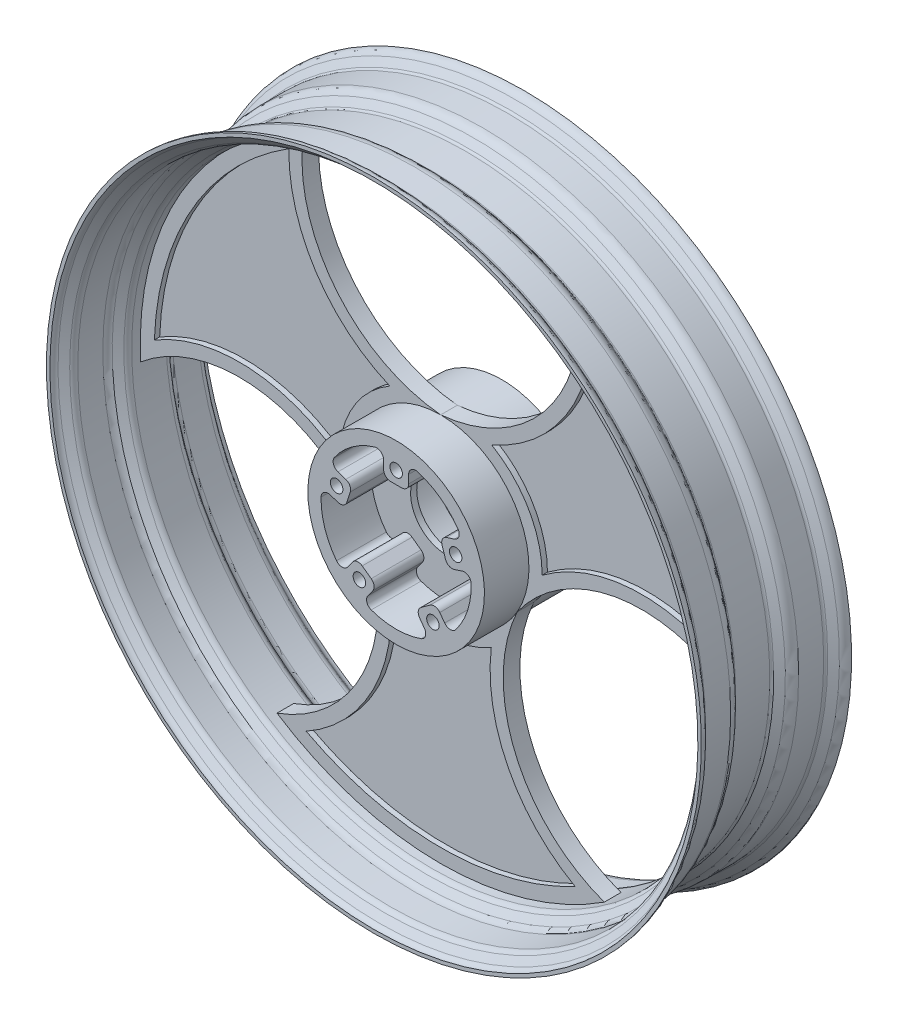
ISO-10303-21;
HEADER;
FILE_DESCRIPTION(('STEP AP214'),'2;1');
FILE_NAME('part.step','',(''),(''),'','','');
FILE_SCHEMA(('AUTOMOTIVE_DESIGN { 1 0 10303 214 1 1 1 1 }'));
ENDSEC;
DATA;
#1=APPLICATION_CONTEXT('core data for automotive mechanical design processes');
#2=APPLICATION_PROTOCOL_DEFINITION('international standard','automotive_design',2000,#1);
#3=PRODUCT_CONTEXT('',#1,'mechanical');
#4=PRODUCT('Part','Part','',(#3));
#5=PRODUCT_RELATED_PRODUCT_CATEGORY('part','',(#4));
#6=PRODUCT_DEFINITION_FORMATION('','',#4);
#7=PRODUCT_DEFINITION_CONTEXT('part definition',#1,'design');
#8=PRODUCT_DEFINITION('design','',#6,#7);
#9=PRODUCT_DEFINITION_SHAPE('','',#8);
#10=(LENGTH_UNIT() NAMED_UNIT(*) SI_UNIT(.MILLI.,.METRE.));
#11=(NAMED_UNIT(*) PLANE_ANGLE_UNIT() SI_UNIT($,.RADIAN.));
#12=(NAMED_UNIT(*) SI_UNIT($,.STERADIAN.) SOLID_ANGLE_UNIT());
#13=UNCERTAINTY_MEASURE_WITH_UNIT(LENGTH_MEASURE(1.E-05),#10,'distance_accuracy_value','');
#14=(GEOMETRIC_REPRESENTATION_CONTEXT(3) GLOBAL_UNCERTAINTY_ASSIGNED_CONTEXT((#13)) GLOBAL_UNIT_ASSIGNED_CONTEXT((#10,
#11,#12)) REPRESENTATION_CONTEXT('',''));
#15=CARTESIAN_POINT('',(0.,0.,0.));
#16=DIRECTION('',(0.,0.,1.));
#17=DIRECTION('',(1.,0.,0.));
#18=AXIS2_PLACEMENT_3D('',#15,#16,#17);
#19=CARTESIAN_POINT('',(0.,0.,-150.545064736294));
#20=DIRECTION('',(0.,0.,1.));
#21=DIRECTION('',(1.,0.,0.));
#22=AXIS2_PLACEMENT_3D('',#19,#20,#21);
#23=CYLINDRICAL_SURFACE('',#22,54.);
#24=CARTESIAN_POINT('',(0.,0.,2.19));
#25=DIRECTION('',(0.,0.,1.));
#26=DIRECTION('',(1.,0.,0.));
#27=AXIS2_PLACEMENT_3D('',#24,#25,#26);
#28=CIRCLE('',#27,54.);
#29=CARTESIAN_POINT('',(15.4285714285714,51.7490017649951,2.19));
#30=VERTEX_POINT('',#29);
#31=CARTESIAN_POINT('',(44.4485345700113,30.6647643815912,2.19));
#32=VERTEX_POINT('',#31);
#33=EDGE_CURVE('E529',#30,#32,#28,.F.);
#34=ORIENTED_EDGE('',*,*,#33,.T.);
#35=DIRECTION('',(0.,0.,1.));
#36=VECTOR('',#35,1.);
#37=CARTESIAN_POINT('',(44.4485345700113,30.6647643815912,-150.545064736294));
#38=LINE('',#37,#36);
#39=CARTESIAN_POINT('',(44.4485345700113,30.6647643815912,38.));
#40=VERTEX_POINT('',#39);
#41=EDGE_CURVE('E860',#32,#40,#38,.T.);
#42=ORIENTED_EDGE('',*,*,#41,.T.);
#43=CARTESIAN_POINT('',(0.,0.,38.));
#44=DIRECTION('',(0.,0.,1.));
#45=DIRECTION('',(1.,0.,0.));
#46=AXIS2_PLACEMENT_3D('',#43,#44,#45);
#47=CIRCLE('',#46,54.);
#48=CARTESIAN_POINT('',(15.4285714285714,51.7490017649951,38.));
#49=VERTEX_POINT('',#48);
#50=EDGE_CURVE('E956',#40,#49,#47,.T.);
#51=ORIENTED_EDGE('',*,*,#50,.T.);
#52=DIRECTION('',(0.,0.,1.));
#53=VECTOR('',#52,1.);
#54=CARTESIAN_POINT('',(15.4285714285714,51.7490017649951,-150.545064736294));
#55=LINE('',#54,#53);
#56=EDGE_CURVE('E858',#49,#30,#55,.F.);
#57=ORIENTED_EDGE('',*,*,#56,.T.);
#58=EDGE_LOOP('',(#34,#42,#51,#57));
#59=FACE_BOUND('',#58,.T.);
#60=ADVANCED_FACE('F36',(#59),#23,.F.);
#61=CARTESIAN_POINT('',(53.9839161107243,1.3178775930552,2.19));
#62=VERTEX_POINT('',#61);
#63=CARTESIAN_POINT('',(42.8992765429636,-32.7971351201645,2.19));
#64=VERTEX_POINT('',#63);
#65=EDGE_CURVE('E522',#62,#64,#28,.F.);
#66=ORIENTED_EDGE('',*,*,#65,.T.);
#67=DIRECTION('',(0.,0.,1.));
#68=VECTOR('',#67,1.);
#69=CARTESIAN_POINT('',(42.8992765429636,-32.7971351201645,-150.545064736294));
#70=LINE('',#69,#68);
#71=CARTESIAN_POINT('',(42.8992765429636,-32.7971351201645,38.));
#72=VERTEX_POINT('',#71);
#73=EDGE_CURVE('E850',#64,#72,#70,.T.);
#74=ORIENTED_EDGE('',*,*,#73,.T.);
#75=CARTESIAN_POINT('',(53.9839161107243,1.3178775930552,38.));
#76=VERTEX_POINT('',#75);
#77=EDGE_CURVE('E1023',#72,#76,#47,.T.);
#78=ORIENTED_EDGE('',*,*,#77,.T.);
#79=DIRECTION('',(0.,0.,1.));
#80=VECTOR('',#79,1.);
#81=CARTESIAN_POINT('',(53.9839161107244,1.3178775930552,-150.545064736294));
#82=LINE('',#81,#80);
#83=EDGE_CURVE('E848',#76,#62,#82,.F.);
#84=ORIENTED_EDGE('',*,*,#83,.T.);
#85=EDGE_LOOP('',(#66,#74,#78,#84));
#86=FACE_BOUND('',#85,.T.);
#87=ADVANCED_FACE('F1077',(#86),#23,.F.);
#88=CARTESIAN_POINT('',(17.9353235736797,-50.9345086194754,2.19));
#89=VERTEX_POINT('',#88);
#90=CARTESIAN_POINT('',(-17.935323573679,-50.9345086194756,2.19));
#91=VERTEX_POINT('',#90);
#92=EDGE_CURVE('E1069',#89,#91,#28,.F.);
#93=ORIENTED_EDGE('',*,*,#92,.T.);
#94=DIRECTION('',(0.,0.,1.));
#95=VECTOR('',#94,1.);
#96=CARTESIAN_POINT('',(-17.935323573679,-50.9345086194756,-150.545064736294));
#97=LINE('',#96,#95);
#98=CARTESIAN_POINT('',(-17.935323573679,-50.9345086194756,38.));
#99=VERTEX_POINT('',#98);
#100=EDGE_CURVE('E830',#91,#99,#97,.T.);
#101=ORIENTED_EDGE('',*,*,#100,.T.);
#102=CARTESIAN_POINT('',(17.9353235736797,-50.9345086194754,38.));
#103=VERTEX_POINT('',#102);
#104=EDGE_CURVE('E1018',#99,#103,#47,.T.);
#105=ORIENTED_EDGE('',*,*,#104,.T.);
#106=DIRECTION('',(0.,0.,1.));
#107=VECTOR('',#106,1.);
#108=CARTESIAN_POINT('',(17.9353235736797,-50.9345086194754,-150.545064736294));
#109=LINE('',#108,#107);
#110=EDGE_CURVE('E828',#103,#89,#109,.F.);
#111=ORIENTED_EDGE('',*,*,#110,.T.);
#112=EDGE_LOOP('',(#93,#101,#105,#111));
#113=FACE_BOUND('',#112,.T.);
#114=ADVANCED_FACE('F1214',(#113),#23,.F.);
#115=CARTESIAN_POINT('',(-53.9839161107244,1.31787759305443,38.));
#116=VERTEX_POINT('',#115);
#117=CARTESIAN_POINT('',(-42.8992765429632,-32.7971351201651,38.));
#118=VERTEX_POINT('',#117);
#119=EDGE_CURVE('E955',#116,#118,#47,.T.);
#120=ORIENTED_EDGE('',*,*,#119,.T.);
#121=DIRECTION('',(0.,0.,1.));
#122=VECTOR('',#121,1.);
#123=CARTESIAN_POINT('',(-42.8992765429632,-32.7971351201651,-150.545064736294));
#124=LINE('',#123,#122);
#125=CARTESIAN_POINT('',(-42.8992765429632,-32.7971351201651,2.19));
#126=VERTEX_POINT('',#125);
#127=EDGE_CURVE('E801',#118,#126,#124,.F.);
#128=ORIENTED_EDGE('',*,*,#127,.T.);
#129=CARTESIAN_POINT('',(-53.9839161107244,1.31787759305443,2.19));
#130=VERTEX_POINT('',#129);
#131=EDGE_CURVE('E1068',#126,#130,#28,.F.);
#132=ORIENTED_EDGE('',*,*,#131,.T.);
#133=DIRECTION('',(0.,0.,1.));
#134=VECTOR('',#133,1.);
#135=CARTESIAN_POINT('',(-53.9839161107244,1.31787759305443,-150.545064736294));
#136=LINE('',#135,#134);
#137=EDGE_CURVE('E798',#130,#116,#136,.T.);
#138=ORIENTED_EDGE('',*,*,#137,.T.);
#139=EDGE_LOOP('',(#120,#128,#132,#138));
#140=FACE_BOUND('',#139,.T.);
#141=ADVANCED_FACE('F1146',(#140),#23,.F.);
#142=CARTESIAN_POINT('',(0.,63.5,-6.00000000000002));
#143=DIRECTION('',(0.,0.,1.));
#144=DIRECTION('',(0.,-1.,0.));
#145=AXIS2_PLACEMENT_3D('',#142,#143,#144);
#146=PLANE('',#145);
#147=CARTESIAN_POINT('',(0.,0.,-6.00000000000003));
#148=DIRECTION('',(0.,0.,1.));
#149=DIRECTION('',(0.,-1.,0.));
#150=AXIS2_PLACEMENT_3D('',#147,#148,#149);
#151=CIRCLE('',#150,216.);
#152=CARTESIAN_POINT('',(215.700329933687,-11.3739907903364,-6.00000000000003));
#153=VERTEX_POINT('',#152);
#154=CARTESIAN_POINT('',(98.,192.488960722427,-6.00000000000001));
#155=VERTEX_POINT('',#154);
#156=EDGE_CURVE('E748',#153,#155,#151,.T.);
#157=ORIENTED_EDGE('',*,*,#156,.F.);
#158=CARTESIAN_POINT('',(144.708138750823,-95.398444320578,-6.00000000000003));
#159=DIRECTION('',(0.,0.,1.));
#160=DIRECTION('',(0.,-1.,0.));
#161=AXIS2_PLACEMENT_3D('',#158,#159,#160);
#162=CIRCLE('',#161,110.);
#163=CARTESIAN_POINT('',(54.9926131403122,-31.7499999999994,-6.00000000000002));
#164=VERTEX_POINT('',#163);
#165=EDGE_CURVE('E690',#164,#153,#162,.F.);
#166=ORIENTED_EDGE('',*,*,#165,.F.);
#167=CARTESIAN_POINT('',(0.,0.,-6.00000000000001));
#168=DIRECTION('',(0.,0.,1.));
#169=DIRECTION('',(0.,-1.,0.));
#170=AXIS2_PLACEMENT_3D('',#167,#168,#169);
#171=CIRCLE('',#170,63.5);
#172=CARTESIAN_POINT('',(0.,63.5,-6.00000000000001));
#173=VERTEX_POINT('',#172);
#174=EDGE_CURVE('E2612',#164,#173,#171,.T.);
#175=ORIENTED_EDGE('',*,*,#174,.T.);
#176=CARTESIAN_POINT('',(-10.2634068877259,173.020146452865,-6.));
#177=DIRECTION('',(0.,0.,1.));
#178=DIRECTION('',(0.,-1.,0.));
#179=AXIS2_PLACEMENT_3D('',#176,#177,#178);
#180=CIRCLE('',#179,110.);
#181=EDGE_CURVE('E2618',#155,#173,#180,.F.);
#182=ORIENTED_EDGE('',*,*,#181,.F.);
#183=EDGE_LOOP('',(#157,#166,#175,#182));
#184=FACE_BOUND('',#183,.T.);
#185=CARTESIAN_POINT('',(0.,0.,-6.00000000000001));
#186=DIRECTION('',(0.,0.,1.));
#187=DIRECTION('',(-0.499999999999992,-0.866025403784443,0.));
#188=AXIS2_PLACEMENT_3D('',#185,#186,#187);
#189=CIRCLE('',#188,206.);
#190=CARTESIAN_POINT('',(205.874510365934,7.18929632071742,-6.00000000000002));
#191=VERTEX_POINT('',#190);
#192=CARTESIAN_POINT('',(109.163368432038,174.697907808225,-6.00000000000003));
#193=VERTEX_POINT('',#192);
#194=EDGE_CURVE('E512',#191,#193,#189,.T.);
#195=ORIENTED_EDGE('',*,*,#194,.T.);
#196=CARTESIAN_POINT('',(-10.2634068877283,173.020146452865,-6.00000000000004));
#197=DIRECTION('',(0.,0.,-1.));
#198=DIRECTION('',(0.499999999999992,0.866025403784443,0.));
#199=AXIS2_PLACEMENT_3D('',#196,#197,#198);
#200=CIRCLE('',#199,119.438559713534);
#201=CARTESIAN_POINT('',(36.602629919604,63.1604898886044,-6.00000000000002));
#202=VERTEX_POINT('',#201);
#203=EDGE_CURVE('E516',#193,#202,#200,.T.);
#204=ORIENTED_EDGE('',*,*,#203,.T.);
#205=CARTESIAN_POINT('',(0.,0.,-6.00000000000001));
#206=DIRECTION('',(0.,0.,-1.));
#207=DIRECTION('',(-0.499999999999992,-0.866025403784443,0.));
#208=AXIS2_PLACEMENT_3D('',#205,#206,#207);
#209=CIRCLE('',#208,73.);
#210=CARTESIAN_POINT('',(72.9999037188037,0.118562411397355,-6.));
#211=VERTEX_POINT('',#210);
#212=EDGE_CURVE('E519',#202,#211,#209,.T.);
#213=ORIENTED_EDGE('',*,*,#212,.T.);
#214=CARTESIAN_POINT('',(144.708138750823,-95.398444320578,-5.99999999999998));
#215=DIRECTION('',(0.,0.,-1.));
#216=DIRECTION('',(0.499999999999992,0.866025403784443,0.));
#217=AXIS2_PLACEMENT_3D('',#214,#215,#216);
#218=CIRCLE('',#217,119.438559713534);
#219=EDGE_CURVE('E528',#211,#191,#218,.T.);
#220=ORIENTED_EDGE('',*,*,#219,.T.);
#221=EDGE_LOOP('',(#195,#204,#213,#220));
#222=FACE_BOUND('',#221,.T.);
#223=ADVANCED_FACE('F1224',(#184,#222),#146,.F.);
#224=CARTESIAN_POINT('',(-54.9926131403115,-31.7500000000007,-6.00000000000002));
#225=VERTEX_POINT('',#224);
#226=EDGE_CURVE('E2611',#225,#164,#171,.T.);
#227=ORIENTED_EDGE('',*,*,#226,.T.);
#228=CARTESIAN_POINT('',(154.971545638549,-77.6217021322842,-6.00000000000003));
#229=DIRECTION('',(0.,0.,1.));
#230=DIRECTION('',(0.,-1.,0.));
#231=AXIS2_PLACEMENT_3D('',#228,#229,#230);
#232=CIRCLE('',#231,110.);
#233=CARTESIAN_POINT('',(117.700329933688,-181.114969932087,-6.00000000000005));
#234=VERTEX_POINT('',#233);
#235=EDGE_CURVE('E706',#234,#164,#232,.F.);
#236=ORIENTED_EDGE('',*,*,#235,.F.);
#237=CARTESIAN_POINT('',(-117.700329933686,-181.114969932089,-6.00000000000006));
#238=VERTEX_POINT('',#237);
#239=EDGE_CURVE('E743',#238,#234,#151,.T.);
#240=ORIENTED_EDGE('',*,*,#239,.F.);
#241=CARTESIAN_POINT('',(-154.971545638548,-77.6217021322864,-6.00000000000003));
#242=DIRECTION('',(0.,0.,1.));
#243=DIRECTION('',(0.,-1.,0.));
#244=AXIS2_PLACEMENT_3D('',#241,#242,#243);
#245=CIRCLE('',#244,110.);
#246=EDGE_CURVE('E713',#225,#238,#245,.F.);
#247=ORIENTED_EDGE('',*,*,#246,.F.);
#248=EDGE_LOOP('',(#227,#236,#240,#247));
#249=FACE_BOUND('',#248,.T.);
#250=CARTESIAN_POINT('',(0.,0.,-6.00000000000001));
#251=DIRECTION('',(0.,0.,1.));
#252=DIRECTION('',(-0.500000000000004,0.866025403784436,0.));
#253=AXIS2_PLACEMENT_3D('',#250,#251,#252);
#254=CIRCLE('',#253,206.);
#255=CARTESIAN_POINT('',(-96.7111419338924,-181.88720412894,-6.00000000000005));
#256=VERTEX_POINT('',#255);
#257=CARTESIAN_POINT('',(96.711141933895,-181.887204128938,-5.99999999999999));
#258=VERTEX_POINT('',#257);
#259=EDGE_CURVE('E535',#256,#258,#254,.T.);
#260=ORIENTED_EDGE('',*,*,#259,.T.);
#261=CARTESIAN_POINT('',(154.971545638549,-77.6217021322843,-6.00000000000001));
#262=DIRECTION('',(0.,0.,-1.));
#263=DIRECTION('',(0.500000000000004,-0.866025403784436,0.));
#264=AXIS2_PLACEMENT_3D('',#261,#262,#263);
#265=CIRCLE('',#264,119.438559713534);
#266=CARTESIAN_POINT('',(36.3972737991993,-63.2790522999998,-6.));
#267=VERTEX_POINT('',#266);
#268=EDGE_CURVE('E543',#258,#267,#265,.T.);
#269=ORIENTED_EDGE('',*,*,#268,.T.);
#270=CARTESIAN_POINT('',(0.,0.,-6.00000000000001));
#271=DIRECTION('',(0.,0.,-1.));
#272=DIRECTION('',(-0.500000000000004,0.866025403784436,0.));
#273=AXIS2_PLACEMENT_3D('',#270,#271,#272);
#274=CIRCLE('',#273,73.);
#275=CARTESIAN_POINT('',(-36.3972737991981,-63.2790523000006,-5.99999999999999));
#276=VERTEX_POINT('',#275);
#277=EDGE_CURVE('E555',#267,#276,#274,.T.);
#278=ORIENTED_EDGE('',*,*,#277,.T.);
#279=CARTESIAN_POINT('',(-154.971545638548,-77.6217021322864,-5.99999999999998));
#280=DIRECTION('',(0.,0.,-1.));
#281=DIRECTION('',(0.500000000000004,-0.866025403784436,0.));
#282=AXIS2_PLACEMENT_3D('',#279,#280,#281);
#283=CIRCLE('',#282,119.438559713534);
#284=EDGE_CURVE('E552',#276,#256,#283,.T.);
#285=ORIENTED_EDGE('',*,*,#284,.T.);
#286=EDGE_LOOP('',(#260,#269,#278,#285));
#287=FACE_BOUND('',#286,.T.);
#288=ADVANCED_FACE('F1229',(#249,#287),#146,.F.);
#289=EDGE_CURVE('E761',#173,#225,#171,.T.);
#290=ORIENTED_EDGE('',*,*,#289,.T.);
#291=CARTESIAN_POINT('',(-144.708138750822,-95.39844432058,-6.00000000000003));
#292=DIRECTION('',(0.,0.,1.));
#293=DIRECTION('',(0.,-1.,0.));
#294=AXIS2_PLACEMENT_3D('',#291,#292,#293);
#295=CIRCLE('',#294,110.);
#296=CARTESIAN_POINT('',(-215.700329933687,-11.3739907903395,-6.00000000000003));
#297=VERTEX_POINT('',#296);
#298=EDGE_CURVE('E723',#297,#225,#295,.F.);
#299=ORIENTED_EDGE('',*,*,#298,.F.);
#300=CARTESIAN_POINT('',(-98.,192.488960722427,-6.00000000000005));
#301=VERTEX_POINT('',#300);
#302=EDGE_CURVE('E747',#301,#297,#151,.T.);
#303=ORIENTED_EDGE('',*,*,#302,.F.);
#304=CARTESIAN_POINT('',(10.2634068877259,173.020146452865,-6.));
#305=DIRECTION('',(0.,0.,1.));
#306=DIRECTION('',(0.,-1.,0.));
#307=AXIS2_PLACEMENT_3D('',#304,#305,#306);
#308=CIRCLE('',#307,110.);
#309=EDGE_CURVE('E730',#173,#301,#308,.F.);
#310=ORIENTED_EDGE('',*,*,#309,.F.);
#311=EDGE_LOOP('',(#290,#299,#303,#310));
#312=FACE_BOUND('',#311,.T.);
#313=CARTESIAN_POINT('',(0.,0.,-6.00000000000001));
#314=DIRECTION('',(0.,0.,1.));
#315=DIRECTION('',(1.,0.,0.));
#316=AXIS2_PLACEMENT_3D('',#313,#314,#315);
#317=CIRCLE('',#316,206.);
#318=CARTESIAN_POINT('',(-109.163368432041,174.697907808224,-6.));
#319=VERTEX_POINT('',#318);
#320=CARTESIAN_POINT('',(-205.874510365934,7.18929632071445,-6.00000000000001));
#321=VERTEX_POINT('',#320);
#322=EDGE_CURVE('E563',#319,#321,#317,.T.);
#323=ORIENTED_EDGE('',*,*,#322,.T.);
#324=CARTESIAN_POINT('',(-144.708138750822,-95.39844432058,-6.00000000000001));
#325=DIRECTION('',(0.,0.,-1.));
#326=DIRECTION('',(-1.,0.,0.));
#327=AXIS2_PLACEMENT_3D('',#324,#325,#326);
#328=CIRCLE('',#327,119.438559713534);
#329=CARTESIAN_POINT('',(-72.9999037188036,0.118562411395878,-6.00000000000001));
#330=VERTEX_POINT('',#329);
#331=EDGE_CURVE('E574',#321,#330,#328,.T.);
#332=ORIENTED_EDGE('',*,*,#331,.T.);
#333=CARTESIAN_POINT('',(0.,0.,-6.00000000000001));
#334=DIRECTION('',(0.,0.,-1.));
#335=DIRECTION('',(1.,0.,0.));
#336=AXIS2_PLACEMENT_3D('',#333,#334,#335);
#337=CIRCLE('',#336,73.);
#338=CARTESIAN_POINT('',(-36.6026299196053,63.1604898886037,-6.00000000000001));
#339=VERTEX_POINT('',#338);
#340=EDGE_CURVE('E586',#330,#339,#337,.T.);
#341=ORIENTED_EDGE('',*,*,#340,.T.);
#342=CARTESIAN_POINT('',(10.2634068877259,173.020146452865,-6.00000000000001));
#343=DIRECTION('',(0.,0.,-1.));
#344=DIRECTION('',(-1.,0.,0.));
#345=AXIS2_PLACEMENT_3D('',#342,#343,#344);
#346=CIRCLE('',#345,119.438559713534);
#347=EDGE_CURVE('E583',#339,#319,#346,.T.);
#348=ORIENTED_EDGE('',*,*,#347,.T.);
#349=EDGE_LOOP('',(#323,#332,#341,#348));
#350=FACE_BOUND('',#349,.T.);
#351=ADVANCED_FACE('F1232',(#312,#350),#146,.F.);
#352=CARTESIAN_POINT('',(0.,63.5,6.00000000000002));
#353=DIRECTION('',(0.,0.,-1.));
#354=DIRECTION('',(0.,1.,0.));
#355=AXIS2_PLACEMENT_3D('',#352,#353,#354);
#356=PLANE('',#355);
#357=CARTESIAN_POINT('',(-10.2634068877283,173.020146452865,6.00000000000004));
#358=DIRECTION('',(0.,0.,-1.));
#359=DIRECTION('',(0.499999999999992,0.866025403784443,0.));
#360=AXIS2_PLACEMENT_3D('',#357,#358,#359);
#361=CIRCLE('',#360,119.438559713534);
#362=CARTESIAN_POINT('',(109.163368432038,174.697907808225,6.00000000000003));
#363=VERTEX_POINT('',#362);
#364=CARTESIAN_POINT('',(36.602629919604,63.1604898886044,6.00000000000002));
#365=VERTEX_POINT('',#364);
#366=EDGE_CURVE('E616',#363,#365,#361,.T.);
#367=ORIENTED_EDGE('',*,*,#366,.F.);
#368=CARTESIAN_POINT('',(0.,0.,6.00000000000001));
#369=DIRECTION('',(0.,0.,1.));
#370=DIRECTION('',(-0.499999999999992,-0.866025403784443,0.));
#371=AXIS2_PLACEMENT_3D('',#368,#369,#370);
#372=CIRCLE('',#371,206.);
#373=CARTESIAN_POINT('',(205.874510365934,7.18929632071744,5.99999999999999));
#374=VERTEX_POINT('',#373);
#375=EDGE_CURVE('E594',#374,#363,#372,.T.);
#376=ORIENTED_EDGE('',*,*,#375,.F.);
#377=CARTESIAN_POINT('',(144.708138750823,-95.398444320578,5.99999999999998));
#378=DIRECTION('',(0.,0.,-1.));
#379=DIRECTION('',(0.499999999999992,0.866025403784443,0.));
#380=AXIS2_PLACEMENT_3D('',#377,#378,#379);
#381=CIRCLE('',#380,119.438559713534);
#382=CARTESIAN_POINT('',(72.9999037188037,0.118562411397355,6.));
#383=VERTEX_POINT('',#382);
#384=EDGE_CURVE('E605',#383,#374,#381,.T.);
#385=ORIENTED_EDGE('',*,*,#384,.F.);
#386=CARTESIAN_POINT('',(0.,0.,6.00000000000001));
#387=DIRECTION('',(0.,0.,-1.));
#388=DIRECTION('',(-0.499999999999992,-0.866025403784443,0.));
#389=AXIS2_PLACEMENT_3D('',#386,#387,#388);
#390=CIRCLE('',#389,73.);
#391=EDGE_CURVE('E619',#365,#383,#390,.T.);
#392=ORIENTED_EDGE('',*,*,#391,.F.);
#393=EDGE_LOOP('',(#367,#376,#385,#392));
#394=FACE_BOUND('',#393,.T.);
#395=CARTESIAN_POINT('',(0.,0.,6.00000000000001));
#396=DIRECTION('',(0.,0.,1.));
#397=DIRECTION('',(0.,-1.,0.));
#398=AXIS2_PLACEMENT_3D('',#395,#396,#397);
#399=CIRCLE('',#398,63.5);
#400=CARTESIAN_POINT('',(54.9926131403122,-31.7499999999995,6.));
#401=VERTEX_POINT('',#400);
#402=CARTESIAN_POINT('',(0.,63.5,6.00000000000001));
#403=VERTEX_POINT('',#402);
#404=EDGE_CURVE('E2643',#401,#403,#399,.T.);
#405=ORIENTED_EDGE('',*,*,#404,.F.);
#406=CARTESIAN_POINT('',(144.708138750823,-95.398444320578,5.99999999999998));
#407=DIRECTION('',(0.,0.,1.));
#408=DIRECTION('',(0.499999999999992,0.866025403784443,0.));
#409=AXIS2_PLACEMENT_3D('',#406,#407,#408);
#410=CIRCLE('',#409,110.);
#411=CARTESIAN_POINT('',(215.700329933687,-11.3739907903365,5.99999999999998));
#412=VERTEX_POINT('',#411);
#413=EDGE_CURVE('E698',#412,#401,#410,.T.);
#414=ORIENTED_EDGE('',*,*,#413,.F.);
#415=CARTESIAN_POINT('',(0.,0.,6.00000000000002));
#416=DIRECTION('',(0.,0.,1.));
#417=DIRECTION('',(0.,-1.,0.));
#418=AXIS2_PLACEMENT_3D('',#415,#416,#417);
#419=CIRCLE('',#418,216.);
#420=CARTESIAN_POINT('',(98.,192.488960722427,6.00000000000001));
#421=VERTEX_POINT('',#420);
#422=EDGE_CURVE('E762',#412,#421,#419,.T.);
#423=ORIENTED_EDGE('',*,*,#422,.T.);
#424=CARTESIAN_POINT('',(-10.2634068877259,173.020146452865,6.00000000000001));
#425=DIRECTION('',(0.,0.,1.));
#426=DIRECTION('',(1.,0.,0.));
#427=AXIS2_PLACEMENT_3D('',#424,#425,#426);
#428=CIRCLE('',#427,110.);
#429=EDGE_CURVE('E740',#403,#421,#428,.T.);
#430=ORIENTED_EDGE('',*,*,#429,.F.);
#431=EDGE_LOOP('',(#405,#414,#423,#430));
#432=FACE_BOUND('',#431,.T.);
#433=ADVANCED_FACE('F1556',(#394,#432),#356,.F.);
#434=CARTESIAN_POINT('',(154.971545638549,-77.6217021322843,6.00000000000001));
#435=DIRECTION('',(0.,0.,-1.));
#436=DIRECTION('',(0.500000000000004,-0.866025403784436,0.));
#437=AXIS2_PLACEMENT_3D('',#434,#435,#436);
#438=CIRCLE('',#437,119.438559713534);
#439=CARTESIAN_POINT('',(96.711141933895,-181.887204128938,5.99999999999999));
#440=VERTEX_POINT('',#439);
#441=CARTESIAN_POINT('',(36.3972737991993,-63.2790522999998,6.));
#442=VERTEX_POINT('',#441);
#443=EDGE_CURVE('E648',#440,#442,#438,.T.);
#444=ORIENTED_EDGE('',*,*,#443,.F.);
#445=CARTESIAN_POINT('',(0.,0.,6.00000000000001));
#446=DIRECTION('',(0.,0.,1.));
#447=DIRECTION('',(-0.500000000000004,0.866025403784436,0.));
#448=AXIS2_PLACEMENT_3D('',#445,#446,#447);
#449=CIRCLE('',#448,206.);
#450=CARTESIAN_POINT('',(-96.7111419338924,-181.88720412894,5.99999999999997));
#451=VERTEX_POINT('',#450);
#452=EDGE_CURVE('E626',#451,#440,#449,.T.);
#453=ORIENTED_EDGE('',*,*,#452,.F.);
#454=CARTESIAN_POINT('',(-154.971545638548,-77.6217021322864,5.99999999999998));
#455=DIRECTION('',(0.,0.,-1.));
#456=DIRECTION('',(0.500000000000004,-0.866025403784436,0.));
#457=AXIS2_PLACEMENT_3D('',#454,#455,#456);
#458=CIRCLE('',#457,119.438559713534);
#459=CARTESIAN_POINT('',(-36.3972737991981,-63.2790523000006,5.99999999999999));
#460=VERTEX_POINT('',#459);
#461=EDGE_CURVE('E637',#460,#451,#458,.T.);
#462=ORIENTED_EDGE('',*,*,#461,.F.);
#463=CARTESIAN_POINT('',(0.,0.,6.00000000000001));
#464=DIRECTION('',(0.,0.,-1.));
#465=DIRECTION('',(-0.500000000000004,0.866025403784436,0.));
#466=AXIS2_PLACEMENT_3D('',#463,#464,#465);
#467=CIRCLE('',#466,73.);
#468=EDGE_CURVE('E651',#442,#460,#467,.T.);
#469=ORIENTED_EDGE('',*,*,#468,.F.);
#470=EDGE_LOOP('',(#444,#453,#462,#469));
#471=FACE_BOUND('',#470,.T.);
#472=CARTESIAN_POINT('',(-117.700329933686,-181.114969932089,5.99999999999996));
#473=VERTEX_POINT('',#472);
#474=CARTESIAN_POINT('',(117.700329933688,-181.114969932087,6.));
#475=VERTEX_POINT('',#474);
#476=EDGE_CURVE('E749',#473,#475,#419,.T.);
#477=ORIENTED_EDGE('',*,*,#476,.T.);
#478=CARTESIAN_POINT('',(154.971545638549,-77.6217021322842,5.99999999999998));
#479=DIRECTION('',(0.,0.,1.));
#480=DIRECTION('',(-0.499999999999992,-0.866025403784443,0.));
#481=AXIS2_PLACEMENT_3D('',#478,#479,#480);
#482=CIRCLE('',#481,110.);
#483=EDGE_CURVE('E701',#401,#475,#482,.T.);
#484=ORIENTED_EDGE('',*,*,#483,.F.);
#485=CARTESIAN_POINT('',(-54.9926131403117,-31.7500000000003,6.));
#486=VERTEX_POINT('',#485);
#487=EDGE_CURVE('E2654',#486,#401,#399,.T.);
#488=ORIENTED_EDGE('',*,*,#487,.F.);
#489=CARTESIAN_POINT('',(-154.971545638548,-77.6217021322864,5.99999999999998));
#490=DIRECTION('',(0.,0.,1.));
#491=DIRECTION('',(0.500000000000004,-0.866025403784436,0.));
#492=AXIS2_PLACEMENT_3D('',#489,#490,#491);
#493=CIRCLE('',#492,110.);
#494=EDGE_CURVE('E715',#473,#486,#493,.T.);
#495=ORIENTED_EDGE('',*,*,#494,.F.);
#496=EDGE_LOOP('',(#477,#484,#488,#495));
#497=FACE_BOUND('',#496,.T.);
#498=ADVANCED_FACE('F1676',(#471,#497),#356,.F.);
#499=CARTESIAN_POINT('',(-144.708138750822,-95.39844432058,6.00000000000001));
#500=DIRECTION('',(0.,0.,-1.));
#501=DIRECTION('',(-1.,0.,0.));
#502=AXIS2_PLACEMENT_3D('',#499,#500,#501);
#503=CIRCLE('',#502,119.438559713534);
#504=CARTESIAN_POINT('',(-205.874510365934,7.18929632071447,6.00000000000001));
#505=VERTEX_POINT('',#504);
#506=CARTESIAN_POINT('',(-72.9999037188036,0.118562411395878,6.00000000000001));
#507=VERTEX_POINT('',#506);
#508=EDGE_CURVE('E680',#505,#507,#503,.T.);
#509=ORIENTED_EDGE('',*,*,#508,.F.);
#510=CARTESIAN_POINT('',(0.,0.,6.00000000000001));
#511=DIRECTION('',(0.,0.,1.));
#512=DIRECTION('',(1.,0.,0.));
#513=AXIS2_PLACEMENT_3D('',#510,#511,#512);
#514=CIRCLE('',#513,206.);
#515=CARTESIAN_POINT('',(-109.163368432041,174.697907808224,6.00000000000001));
#516=VERTEX_POINT('',#515);
#517=EDGE_CURVE('E658',#516,#505,#514,.T.);
#518=ORIENTED_EDGE('',*,*,#517,.F.);
#519=CARTESIAN_POINT('',(10.2634068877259,173.020146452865,6.00000000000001));
#520=DIRECTION('',(0.,0.,-1.));
#521=DIRECTION('',(-1.,0.,0.));
#522=AXIS2_PLACEMENT_3D('',#519,#520,#521);
#523=CIRCLE('',#522,119.438559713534);
#524=CARTESIAN_POINT('',(-36.6026299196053,63.1604898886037,6.00000000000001));
#525=VERTEX_POINT('',#524);
#526=EDGE_CURVE('E669',#525,#516,#523,.T.);
#527=ORIENTED_EDGE('',*,*,#526,.F.);
#528=CARTESIAN_POINT('',(0.,0.,6.00000000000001));
#529=DIRECTION('',(0.,0.,-1.));
#530=DIRECTION('',(1.,0.,0.));
#531=AXIS2_PLACEMENT_3D('',#528,#529,#530);
#532=CIRCLE('',#531,73.);
#533=EDGE_CURVE('E683',#507,#525,#532,.T.);
#534=ORIENTED_EDGE('',*,*,#533,.F.);
#535=EDGE_LOOP('',(#509,#518,#527,#534));
#536=FACE_BOUND('',#535,.T.);
#537=CARTESIAN_POINT('',(-98.,192.488960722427,6.00000000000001));
#538=VERTEX_POINT('',#537);
#539=CARTESIAN_POINT('',(-215.700329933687,-11.3739907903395,6.00000000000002));
#540=VERTEX_POINT('',#539);
#541=EDGE_CURVE('E2655',#538,#540,#419,.T.);
#542=ORIENTED_EDGE('',*,*,#541,.T.);
#543=CARTESIAN_POINT('',(-144.708138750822,-95.39844432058,5.99999999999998));
#544=DIRECTION('',(0.,0.,1.));
#545=DIRECTION('',(-0.500000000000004,0.866025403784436,0.));
#546=AXIS2_PLACEMENT_3D('',#543,#544,#545);
#547=CIRCLE('',#546,110.);
#548=EDGE_CURVE('E718',#486,#540,#547,.T.);
#549=ORIENTED_EDGE('',*,*,#548,.F.);
#550=EDGE_CURVE('E755',#403,#486,#399,.T.);
#551=ORIENTED_EDGE('',*,*,#550,.F.);
#552=CARTESIAN_POINT('',(10.2634068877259,173.020146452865,6.00000000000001));
#553=DIRECTION('',(0.,0.,1.));
#554=DIRECTION('',(-1.,0.,0.));
#555=AXIS2_PLACEMENT_3D('',#552,#553,#554);
#556=CIRCLE('',#555,110.);
#557=EDGE_CURVE('E736',#538,#403,#556,.T.);
#558=ORIENTED_EDGE('',*,*,#557,.F.);
#559=EDGE_LOOP('',(#542,#549,#551,#558));
#560=FACE_BOUND('',#559,.T.);
#561=ADVANCED_FACE('F1681',(#536,#560),#356,.F.);
#562=CARTESIAN_POINT('',(0.,0.,50.9126634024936));
#563=DIRECTION('',(0.,0.,1.));
#564=DIRECTION('',(0.,-1.,0.));
#565=AXIS2_PLACEMENT_3D('',#562,#563,#564);
#566=CYLINDRICAL_SURFACE('',#565,63.5);
#567=CARTESIAN_POINT('',(0.,0.,38.));
#568=DIRECTION('',(0.,0.,1.));
#569=DIRECTION('',(0.,-1.,0.));
#570=AXIS2_PLACEMENT_3D('',#567,#568,#569);
#571=CIRCLE('',#570,63.5);
#572=CARTESIAN_POINT('',(0.,-63.5,38.));
#573=VERTEX_POINT('',#572);
#574=EDGE_CURVE('E2616',#573,#573,#571,.T.);
#575=ORIENTED_EDGE('',*,*,#574,.F.);
#576=EDGE_LOOP('',(#575));
#577=FACE_BOUND('',#576,.T.);
#578=ORIENTED_EDGE('',*,*,#550,.T.);
#579=ORIENTED_EDGE('',*,*,#487,.T.);
#580=ORIENTED_EDGE('',*,*,#404,.T.);
#581=EDGE_LOOP('',(#578,#579,#580));
#582=FACE_BOUND('',#581,.T.);
#583=ADVANCED_FACE('F1750',(#577,#582),#566,.T.);
#584=CARTESIAN_POINT('',(0.,0.,12.1905396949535));
#585=DIRECTION('',(0.,0.,1.));
#586=DIRECTION('',(0.,-1.,0.));
#587=AXIS2_PLACEMENT_3D('',#584,#585,#586);
#588=TOROIDAL_SURFACE('',#587,221.,5.00000000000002);
#589=CARTESIAN_POINT('',(0.,0.,12.1905396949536));
#590=DIRECTION('',(0.,0.,1.));
#591=DIRECTION('',(0.,-1.,0.));
#592=AXIS2_PLACEMENT_3D('',#589,#590,#591);
#593=CIRCLE('',#592,216.);
#594=CARTESIAN_POINT('',(0.,-216.,12.1905396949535));
#595=VERTEX_POINT('',#594);
#596=EDGE_CURVE('E2513',#595,#595,#593,.T.);
#597=ORIENTED_EDGE('',*,*,#596,.F.);
#598=EDGE_LOOP('',(#597));
#599=FACE_BOUND('',#598,.T.);
#600=CARTESIAN_POINT('',(0.,0.,16.0207619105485));
#601=DIRECTION('',(0.,0.,1.));
#602=DIRECTION('',(0.,-1.,0.));
#603=AXIS2_PLACEMENT_3D('',#600,#601,#602);
#604=CIRCLE('',#603,217.786061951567);
#605=CARTESIAN_POINT('',(0.,-217.786061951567,16.0207619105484));
#606=VERTEX_POINT('',#605);
#607=EDGE_CURVE('E2516',#606,#606,#604,.T.);
#608=ORIENTED_EDGE('',*,*,#607,.T.);
#609=EDGE_LOOP('',(#608));
#610=FACE_BOUND('',#609,.T.);
#611=ADVANCED_FACE('F1819',(#599,#610),#588,.T.);
#612=CARTESIAN_POINT('',(0.,0.,19.8560041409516));
#613=DIRECTION('',(0.,0.,1.));
#614=DIRECTION('',(0.,-1.,0.));
#615=AXIS2_PLACEMENT_3D('',#612,#613,#614);
#616=CONICAL_SURFACE('',#615,222.356725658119,0.87266462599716);
#617=ORIENTED_EDGE('',*,*,#607,.F.);
#618=EDGE_LOOP('',(#617));
#619=FACE_BOUND('',#618,.T.);
#620=CARTESIAN_POINT('',(0.,0.,19.8560041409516));
#621=DIRECTION('',(0.,0.,1.));
#622=DIRECTION('',(0.,-1.,0.));
#623=AXIS2_PLACEMENT_3D('',#620,#621,#622);
#624=CIRCLE('',#623,222.356725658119);
#625=CARTESIAN_POINT('',(0.,-222.356725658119,19.8560041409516));
#626=VERTEX_POINT('',#625);
#627=EDGE_CURVE('E2517',#626,#626,#624,.T.);
#628=ORIENTED_EDGE('',*,*,#627,.T.);
#629=EDGE_LOOP('',(#628));
#630=FACE_BOUND('',#629,.T.);
#631=ADVANCED_FACE('F2127',(#619,#630),#616,.F.);
#632=CARTESIAN_POINT('',(0.,0.,24.4522707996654));
#633=DIRECTION('',(0.,0.,1.));
#634=DIRECTION('',(0.,-1.,0.));
#635=AXIS2_PLACEMENT_3D('',#632,#633,#634);
#636=TOROIDAL_SURFACE('',#635,218.5,5.99999999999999);
#637=ORIENTED_EDGE('',*,*,#627,.F.);
#638=EDGE_LOOP('',(#637));
#639=FACE_BOUND('',#638,.T.);
#640=CARTESIAN_POINT('',(0.,0.,24.4522707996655));
#641=DIRECTION('',(0.,0.,1.));
#642=DIRECTION('',(0.,-1.,0.));
#643=AXIS2_PLACEMENT_3D('',#640,#641,#642);
#644=CIRCLE('',#643,224.5);
#645=CARTESIAN_POINT('',(0.,-224.5,24.4522707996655));
#646=VERTEX_POINT('',#645);
#647=EDGE_CURVE('E2520',#646,#646,#644,.T.);
#648=ORIENTED_EDGE('',*,*,#647,.T.);
#649=EDGE_LOOP('',(#648));
#650=FACE_BOUND('',#649,.T.);
#651=ADVANCED_FACE('F2117',(#639,#650),#636,.F.);
#652=CARTESIAN_POINT('',(0.,0.,50.9126634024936));
#653=DIRECTION('',(0.,0.,1.));
#654=DIRECTION('',(0.,-1.,0.));
#655=AXIS2_PLACEMENT_3D('',#652,#653,#654);
#656=CYLINDRICAL_SURFACE('',#655,224.5);
#657=ORIENTED_EDGE('',*,*,#647,.F.);
#658=EDGE_LOOP('',(#657));
#659=FACE_BOUND('',#658,.T.);
#660=CARTESIAN_POINT('',(0.,0.,42.4522707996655));
#661=DIRECTION('',(0.,0.,1.));
#662=DIRECTION('',(0.,-1.,0.));
#663=AXIS2_PLACEMENT_3D('',#660,#661,#662);
#664=CIRCLE('',#663,224.5);
#665=CARTESIAN_POINT('',(0.,-224.5,42.4522707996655));
#666=VERTEX_POINT('',#665);
#667=EDGE_CURVE('E2525',#666,#666,#664,.T.);
#668=ORIENTED_EDGE('',*,*,#667,.T.);
#669=EDGE_LOOP('',(#668));
#670=FACE_BOUND('',#669,.T.);
#671=ADVANCED_FACE('F2107',(#659,#670),#656,.F.);
#672=CARTESIAN_POINT('',(0.,0.,42.4522707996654));
#673=DIRECTION('',(0.,0.,1.));
#674=DIRECTION('',(0.,-1.,0.));
#675=AXIS2_PLACEMENT_3D('',#672,#673,#674);
#676=TOROIDAL_SURFACE('',#675,229.5,5.00000000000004);
#677=ORIENTED_EDGE('',*,*,#667,.F.);
#678=EDGE_LOOP('',(#677));
#679=FACE_BOUND('',#678,.T.);
#680=CARTESIAN_POINT('',(0.,0.,46.3802717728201));
#681=DIRECTION('',(0.,0.,1.));
#682=DIRECTION('',(0.,-1.,0.));
#683=AXIS2_PLACEMENT_3D('',#680,#681,#682);
#684=CIRCLE('',#683,226.406327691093);
#685=CARTESIAN_POINT('',(0.,-226.406327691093,46.3802717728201));
#686=VERTEX_POINT('',#685);
#687=EDGE_CURVE('E2528',#686,#686,#684,.T.);
#688=ORIENTED_EDGE('',*,*,#687,.T.);
#689=EDGE_LOOP('',(#688));
#690=FACE_BOUND('',#689,.T.);
#691=ADVANCED_FACE('F2097',(#679,#690),#676,.T.);
#692=CARTESIAN_POINT('',(0.,0.,50.0719990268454));
#693=DIRECTION('',(0.,0.,1.));
#694=DIRECTION('',(0.,-1.,0.));
#695=AXIS2_PLACEMENT_3D('',#692,#693,#694);
#696=CONICAL_SURFACE('',#695,231.093672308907,0.903665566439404);
#697=ORIENTED_EDGE('',*,*,#687,.F.);
#698=EDGE_LOOP('',(#697));
#699=FACE_BOUND('',#698,.T.);
#700=CARTESIAN_POINT('',(0.,0.,50.0719990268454));
#701=DIRECTION('',(0.,0.,1.));
#702=DIRECTION('',(0.,-1.,0.));
#703=AXIS2_PLACEMENT_3D('',#700,#701,#702);
#704=CIRCLE('',#703,231.093672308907);
#705=CARTESIAN_POINT('',(0.,-231.093672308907,50.0719990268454));
#706=VERTEX_POINT('',#705);
#707=EDGE_CURVE('E2531',#706,#706,#704,.T.);
#708=ORIENTED_EDGE('',*,*,#707,.T.);
#709=EDGE_LOOP('',(#708));
#710=FACE_BOUND('',#709,.T.);
#711=ADVANCED_FACE('F2087',(#699,#710),#696,.F.);
#712=CARTESIAN_POINT('',(0.,0.,54.));
#713=DIRECTION('',(0.,0.,1.));
#714=DIRECTION('',(0.,-1.,0.));
#715=AXIS2_PLACEMENT_3D('',#712,#713,#714);
#716=TOROIDAL_SURFACE('',#715,228.,5.00000000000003);
#717=ORIENTED_EDGE('',*,*,#707,.F.);
#718=EDGE_LOOP('',(#717));
#719=FACE_BOUND('',#718,.T.);
#720=CARTESIAN_POINT('',(0.,0.,54.));
#721=DIRECTION('',(0.,0.,1.));
#722=DIRECTION('',(0.,-1.,0.));
#723=AXIS2_PLACEMENT_3D('',#720,#721,#722);
#724=CIRCLE('',#723,233.);
#725=CARTESIAN_POINT('',(0.,-233.,54.));
#726=VERTEX_POINT('',#725);
#727=EDGE_CURVE('E2534',#726,#726,#724,.T.);
#728=ORIENTED_EDGE('',*,*,#727,.T.);
#729=EDGE_LOOP('',(#728));
#730=FACE_BOUND('',#729,.T.);
#731=ADVANCED_FACE('F2077',(#719,#730),#716,.F.);
#732=CARTESIAN_POINT('',(0.,233.,54.));
#733=DIRECTION('',(0.,0.,-1.));
#734=DIRECTION('',(0.,1.,0.));
#735=AXIS2_PLACEMENT_3D('',#732,#733,#734);
#736=PLANE('',#735);
#737=ORIENTED_EDGE('',*,*,#727,.F.);
#738=EDGE_LOOP('',(#737));
#739=FACE_BOUND('',#738,.T.);
#740=CARTESIAN_POINT('',(0.,0.,54.));
#741=DIRECTION('',(0.,0.,1.));
#742=DIRECTION('',(0.,-1.,0.));
#743=AXIS2_PLACEMENT_3D('',#740,#741,#742);
#744=CIRCLE('',#743,235.5);
#745=CARTESIAN_POINT('',(0.,-235.5,54.));
#746=VERTEX_POINT('',#745);
#747=EDGE_CURVE('E2537',#746,#746,#744,.T.);
#748=ORIENTED_EDGE('',*,*,#747,.T.);
#749=EDGE_LOOP('',(#748));
#750=FACE_BOUND('',#749,.T.);
#751=ADVANCED_FACE('F2067',(#739,#750),#736,.F.);
#752=CARTESIAN_POINT('',(0.,0.,54.));
#753=DIRECTION('',(0.,0.,1.));
#754=DIRECTION('',(0.,-1.,0.));
#755=AXIS2_PLACEMENT_3D('',#752,#753,#754);
#756=TOROIDAL_SURFACE('',#755,228.,7.50000000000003);
#757=ORIENTED_EDGE('',*,*,#747,.F.);
#758=EDGE_LOOP('',(#757));
#759=FACE_BOUND('',#758,.T.);
#760=CARTESIAN_POINT('',(0.,0.,48.1079985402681));
#761=DIRECTION('',(0.,0.,1.));
#762=DIRECTION('',(0.,-1.,0.));
#763=AXIS2_PLACEMENT_3D('',#760,#761,#762);
#764=CIRCLE('',#763,232.64050846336);
#765=CARTESIAN_POINT('',(0.,-232.64050846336,48.1079985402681));
#766=VERTEX_POINT('',#765);
#767=EDGE_CURVE('E2540',#766,#766,#764,.T.);
#768=ORIENTED_EDGE('',*,*,#767,.T.);
#769=EDGE_LOOP('',(#768));
#770=FACE_BOUND('',#769,.T.);
#771=ADVANCED_FACE('F2057',(#759,#770),#756,.T.);
#772=CARTESIAN_POINT('',(0.,0.,44.4162712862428));
#773=DIRECTION('',(0.,0.,1.));
#774=DIRECTION('',(0.,-1.,0.));
#775=AXIS2_PLACEMENT_3D('',#772,#773,#774);
#776=CONICAL_SURFACE('',#775,227.953163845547,0.903665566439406);
#777=ORIENTED_EDGE('',*,*,#767,.F.);
#778=EDGE_LOOP('',(#777));
#779=FACE_BOUND('',#778,.T.);
#780=CARTESIAN_POINT('',(0.,0.,44.4162712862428));
#781=DIRECTION('',(0.,0.,1.));
#782=DIRECTION('',(0.,-1.,0.));
#783=AXIS2_PLACEMENT_3D('',#780,#781,#782);
#784=CIRCLE('',#783,227.953163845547);
#785=CARTESIAN_POINT('',(0.,-227.953163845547,44.4162712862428));
#786=VERTEX_POINT('',#785);
#787=EDGE_CURVE('E2543',#786,#786,#784,.T.);
#788=ORIENTED_EDGE('',*,*,#787,.T.);
#789=EDGE_LOOP('',(#788));
#790=FACE_BOUND('',#789,.T.);
#791=ADVANCED_FACE('F2047',(#779,#790),#776,.T.);
#792=CARTESIAN_POINT('',(0.,0.,42.4522707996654));
#793=DIRECTION('',(0.,0.,1.));
#794=DIRECTION('',(0.,-1.,0.));
#795=AXIS2_PLACEMENT_3D('',#792,#793,#794);
#796=TOROIDAL_SURFACE('',#795,229.5,2.50000000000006);
#797=ORIENTED_EDGE('',*,*,#787,.F.);
#798=EDGE_LOOP('',(#797));
#799=FACE_BOUND('',#798,.T.);
#800=CARTESIAN_POINT('',(0.,0.,42.4522707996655));
#801=DIRECTION('',(0.,0.,1.));
#802=DIRECTION('',(0.,-1.,0.));
#803=AXIS2_PLACEMENT_3D('',#800,#801,#802);
#804=CIRCLE('',#803,227.);
#805=CARTESIAN_POINT('',(0.,-227.,42.4522707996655));
#806=VERTEX_POINT('',#805);
#807=EDGE_CURVE('E2546',#806,#806,#804,.T.);
#808=ORIENTED_EDGE('',*,*,#807,.T.);
#809=EDGE_LOOP('',(#808));
#810=FACE_BOUND('',#809,.T.);
#811=ADVANCED_FACE('F2037',(#799,#810),#796,.F.);
#812=CARTESIAN_POINT('',(0.,0.,50.9126634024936));
#813=DIRECTION('',(0.,0.,1.));
#814=DIRECTION('',(0.,-1.,0.));
#815=AXIS2_PLACEMENT_3D('',#812,#813,#814);
#816=CYLINDRICAL_SURFACE('',#815,227.);
#817=ORIENTED_EDGE('',*,*,#807,.F.);
#818=EDGE_LOOP('',(#817));
#819=FACE_BOUND('',#818,.T.);
#820=CARTESIAN_POINT('',(0.,0.,24.4522707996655));
#821=DIRECTION('',(0.,0.,1.));
#822=DIRECTION('',(0.,-1.,0.));
#823=AXIS2_PLACEMENT_3D('',#820,#821,#822);
#824=CIRCLE('',#823,227.);
#825=CARTESIAN_POINT('',(0.,-227.,24.4522707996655));
#826=VERTEX_POINT('',#825);
#827=EDGE_CURVE('E2549',#826,#826,#824,.T.);
#828=ORIENTED_EDGE('',*,*,#827,.T.);
#829=EDGE_LOOP('',(#828));
#830=FACE_BOUND('',#829,.T.);
#831=ADVANCED_FACE('F2027',(#819,#830),#816,.T.);
#832=CARTESIAN_POINT('',(0.,0.,24.4522707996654));
#833=DIRECTION('',(0.,0.,1.));
#834=DIRECTION('',(0.,-1.,0.));
#835=AXIS2_PLACEMENT_3D('',#832,#833,#834);
#836=TOROIDAL_SURFACE('',#835,218.5,8.49999999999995);
#837=ORIENTED_EDGE('',*,*,#827,.F.);
#838=EDGE_LOOP('',(#837));
#839=FACE_BOUND('',#838,.T.);
#840=CARTESIAN_POINT('',(0.,0.,17.9408930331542));
#841=DIRECTION('',(0.,0.,1.));
#842=DIRECTION('',(0.,-1.,0.));
#843=AXIS2_PLACEMENT_3D('',#840,#841,#842);
#844=CIRCLE('',#843,223.963694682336);
#845=CARTESIAN_POINT('',(0.,-223.963694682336,17.9408930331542));
#846=VERTEX_POINT('',#845);
#847=EDGE_CURVE('E2552',#846,#846,#844,.T.);
#848=ORIENTED_EDGE('',*,*,#847,.T.);
#849=EDGE_LOOP('',(#848));
#850=FACE_BOUND('',#849,.T.);
#851=ADVANCED_FACE('F2017',(#839,#850),#836,.T.);
#852=CARTESIAN_POINT('',(0.,0.,14.105650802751));
#853=DIRECTION('',(0.,0.,1.));
#854=DIRECTION('',(0.,-1.,0.));
#855=AXIS2_PLACEMENT_3D('',#852,#853,#854);
#856=CONICAL_SURFACE('',#855,219.393030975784,0.872664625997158);
#857=ORIENTED_EDGE('',*,*,#847,.F.);
#858=EDGE_LOOP('',(#857));
#859=FACE_BOUND('',#858,.T.);
#860=CARTESIAN_POINT('',(0.,0.,14.105650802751));
#861=DIRECTION('',(0.,0.,1.));
#862=DIRECTION('',(0.,-1.,0.));
#863=AXIS2_PLACEMENT_3D('',#860,#861,#862);
#864=CIRCLE('',#863,219.393030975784);
#865=CARTESIAN_POINT('',(0.,-219.393030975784,14.105650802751));
#866=VERTEX_POINT('',#865);
#867=EDGE_CURVE('E2555',#866,#866,#864,.T.);
#868=ORIENTED_EDGE('',*,*,#867,.T.);
#869=EDGE_LOOP('',(#868));
#870=FACE_BOUND('',#869,.T.);
#871=ADVANCED_FACE('F2007',(#859,#870),#856,.T.);
#872=CARTESIAN_POINT('',(0.,0.,12.1905396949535));
#873=DIRECTION('',(0.,0.,1.));
#874=DIRECTION('',(0.,-1.,0.));
#875=AXIS2_PLACEMENT_3D('',#872,#873,#874);
#876=TOROIDAL_SURFACE('',#875,221.,2.50000000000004);
#877=ORIENTED_EDGE('',*,*,#867,.F.);
#878=EDGE_LOOP('',(#877));
#879=FACE_BOUND('',#878,.T.);
#880=CARTESIAN_POINT('',(0.,0.,12.1905396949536));
#881=DIRECTION('',(0.,0.,1.));
#882=DIRECTION('',(0.,-1.,0.));
#883=AXIS2_PLACEMENT_3D('',#880,#881,#882);
#884=CIRCLE('',#883,218.5);
#885=CARTESIAN_POINT('',(0.,-218.5,12.1905396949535));
#886=VERTEX_POINT('',#885);
#887=EDGE_CURVE('E2558',#886,#886,#884,.T.);
#888=ORIENTED_EDGE('',*,*,#887,.T.);
#889=EDGE_LOOP('',(#888));
#890=FACE_BOUND('',#889,.T.);
#891=ADVANCED_FACE('F1997',(#879,#890),#876,.F.);
#892=CARTESIAN_POINT('',(0.,0.,50.9126634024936));
#893=DIRECTION('',(0.,0.,1.));
#894=DIRECTION('',(0.,-1.,0.));
#895=AXIS2_PLACEMENT_3D('',#892,#893,#894);
#896=CYLINDRICAL_SURFACE('',#895,218.5);
#897=ORIENTED_EDGE('',*,*,#887,.F.);
#898=EDGE_LOOP('',(#897));
#899=FACE_BOUND('',#898,.T.);
#900=CARTESIAN_POINT('',(0.,0.,-12.1905396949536));
#901=DIRECTION('',(0.,0.,1.));
#902=DIRECTION('',(0.,-1.,0.));
#903=AXIS2_PLACEMENT_3D('',#900,#901,#902);
#904=CIRCLE('',#903,218.5);
#905=CARTESIAN_POINT('',(0.,-218.5,-12.1905396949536));
#906=VERTEX_POINT('',#905);
#907=EDGE_CURVE('E2561',#906,#906,#904,.T.);
#908=ORIENTED_EDGE('',*,*,#907,.T.);
#909=EDGE_LOOP('',(#908));
#910=FACE_BOUND('',#909,.T.);
#911=ADVANCED_FACE('F1987',(#899,#910),#896,.T.);
#912=CARTESIAN_POINT('',(0.,0.,-12.1905396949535));
#913=DIRECTION('',(0.,0.,1.));
#914=DIRECTION('',(0.,-1.,0.));
#915=AXIS2_PLACEMENT_3D('',#912,#913,#914);
#916=TOROIDAL_SURFACE('',#915,221.,2.50000000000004);
#917=ORIENTED_EDGE('',*,*,#907,.F.);
#918=EDGE_LOOP('',(#917));
#919=FACE_BOUND('',#918,.T.);
#920=CARTESIAN_POINT('',(0.,0.,-14.105650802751));
#921=DIRECTION('',(0.,0.,1.));
#922=DIRECTION('',(0.,-1.,0.));
#923=AXIS2_PLACEMENT_3D('',#920,#921,#922);
#924=CIRCLE('',#923,219.393030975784);
#925=CARTESIAN_POINT('',(0.,-219.393030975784,-14.105650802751));
#926=VERTEX_POINT('',#925);
#927=EDGE_CURVE('E2564',#926,#926,#924,.T.);
#928=ORIENTED_EDGE('',*,*,#927,.T.);
#929=EDGE_LOOP('',(#928));
#930=FACE_BOUND('',#929,.T.);
#931=ADVANCED_FACE('F1977',(#919,#930),#916,.F.);
#932=CARTESIAN_POINT('',(0.,0.,-17.9408930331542));
#933=DIRECTION('',(0.,0.,-1.));
#934=DIRECTION('',(0.,1.,0.));
#935=AXIS2_PLACEMENT_3D('',#932,#933,#934);
#936=CONICAL_SURFACE('',#935,223.963694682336,0.872664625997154);
#937=ORIENTED_EDGE('',*,*,#927,.F.);
#938=EDGE_LOOP('',(#937));
#939=FACE_BOUND('',#938,.T.);
#940=CARTESIAN_POINT('',(0.,0.,-17.9408930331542));
#941=DIRECTION('',(0.,0.,1.));
#942=DIRECTION('',(0.,-1.,0.));
#943=AXIS2_PLACEMENT_3D('',#940,#941,#942);
#944=CIRCLE('',#943,223.963694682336);
#945=CARTESIAN_POINT('',(0.,-223.963694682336,-17.9408930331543));
#946=VERTEX_POINT('',#945);
#947=EDGE_CURVE('E2567',#946,#946,#944,.T.);
#948=ORIENTED_EDGE('',*,*,#947,.T.);
#949=EDGE_LOOP('',(#948));
#950=FACE_BOUND('',#949,.T.);
#951=ADVANCED_FACE('F1967',(#939,#950),#936,.T.);
#952=CARTESIAN_POINT('',(0.,0.,-24.4522707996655));
#953=DIRECTION('',(0.,0.,1.));
#954=DIRECTION('',(0.,-1.,0.));
#955=AXIS2_PLACEMENT_3D('',#952,#953,#954);
#956=TOROIDAL_SURFACE('',#955,218.5,8.49999999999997);
#957=ORIENTED_EDGE('',*,*,#947,.F.);
#958=EDGE_LOOP('',(#957));
#959=FACE_BOUND('',#958,.T.);
#960=CARTESIAN_POINT('',(0.,0.,-24.4522707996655));
#961=DIRECTION('',(0.,0.,1.));
#962=DIRECTION('',(0.,-1.,0.));
#963=AXIS2_PLACEMENT_3D('',#960,#961,#962);
#964=CIRCLE('',#963,227.);
#965=CARTESIAN_POINT('',(0.,-227.,-24.4522707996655));
#966=VERTEX_POINT('',#965);
#967=EDGE_CURVE('E2570',#966,#966,#964,.T.);
#968=ORIENTED_EDGE('',*,*,#967,.T.);
#969=EDGE_LOOP('',(#968));
#970=FACE_BOUND('',#969,.T.);
#971=ADVANCED_FACE('F1957',(#959,#970),#956,.T.);
#972=CARTESIAN_POINT('',(0.,0.,50.9126634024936));
#973=DIRECTION('',(0.,0.,1.));
#974=DIRECTION('',(0.,-1.,0.));
#975=AXIS2_PLACEMENT_3D('',#972,#973,#974);
#976=CYLINDRICAL_SURFACE('',#975,227.);
#977=ORIENTED_EDGE('',*,*,#967,.F.);
#978=EDGE_LOOP('',(#977));
#979=FACE_BOUND('',#978,.T.);
#980=CARTESIAN_POINT('',(0.,0.,-42.4522707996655));
#981=DIRECTION('',(0.,0.,1.));
#982=DIRECTION('',(0.,-1.,0.));
#983=AXIS2_PLACEMENT_3D('',#980,#981,#982);
#984=CIRCLE('',#983,227.);
#985=CARTESIAN_POINT('',(0.,-227.,-42.4522707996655));
#986=VERTEX_POINT('',#985);
#987=EDGE_CURVE('E2573',#986,#986,#984,.T.);
#988=ORIENTED_EDGE('',*,*,#987,.T.);
#989=EDGE_LOOP('',(#988));
#990=FACE_BOUND('',#989,.T.);
#991=ADVANCED_FACE('F1947',(#979,#990),#976,.T.);
#992=CARTESIAN_POINT('',(0.,0.,-42.4522707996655));
#993=DIRECTION('',(0.,0.,1.));
#994=DIRECTION('',(0.,-1.,0.));
#995=AXIS2_PLACEMENT_3D('',#992,#993,#994);
#996=TOROIDAL_SURFACE('',#995,229.5,2.50000000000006);
#997=ORIENTED_EDGE('',*,*,#987,.F.);
#998=EDGE_LOOP('',(#997));
#999=FACE_BOUND('',#998,.T.);
#1000=CARTESIAN_POINT('',(0.,0.,-44.4162712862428));
#1001=DIRECTION('',(0.,0.,1.));
#1002=DIRECTION('',(0.,-1.,0.));
#1003=AXIS2_PLACEMENT_3D('',#1000,#1001,#1002);
#1004=CIRCLE('',#1003,227.953163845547);
#1005=CARTESIAN_POINT('',(0.,-227.953163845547,-44.4162712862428));
#1006=VERTEX_POINT('',#1005);
#1007=EDGE_CURVE('E2576',#1006,#1006,#1004,.T.);
#1008=ORIENTED_EDGE('',*,*,#1007,.T.);
#1009=EDGE_LOOP('',(#1008));
#1010=FACE_BOUND('',#1009,.T.);
#1011=ADVANCED_FACE('F1937',(#999,#1010),#996,.F.);
#1012=CARTESIAN_POINT('',(0.,0.,-48.1079985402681));
#1013=DIRECTION('',(0.,0.,-1.));
#1014=DIRECTION('',(0.,1.,0.));
#1015=AXIS2_PLACEMENT_3D('',#1012,#1013,#1014);
#1016=CONICAL_SURFACE('',#1015,232.64050846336,0.903665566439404);
#1017=ORIENTED_EDGE('',*,*,#1007,.F.);
#1018=EDGE_LOOP('',(#1017));
#1019=FACE_BOUND('',#1018,.T.);
#1020=CARTESIAN_POINT('',(0.,0.,-48.1079985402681));
#1021=DIRECTION('',(0.,0.,1.));
#1022=DIRECTION('',(0.,-1.,0.));
#1023=AXIS2_PLACEMENT_3D('',#1020,#1021,#1022);
#1024=CIRCLE('',#1023,232.64050846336);
#1025=CARTESIAN_POINT('',(0.,-232.64050846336,-48.1079985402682));
#1026=VERTEX_POINT('',#1025);
#1027=EDGE_CURVE('E2579',#1026,#1026,#1024,.T.);
#1028=ORIENTED_EDGE('',*,*,#1027,.T.);
#1029=EDGE_LOOP('',(#1028));
#1030=FACE_BOUND('',#1029,.T.);
#1031=ADVANCED_FACE('F1927',(#1019,#1030),#1016,.T.);
#1032=CARTESIAN_POINT('',(0.,0.,-54.));
#1033=DIRECTION('',(0.,0.,1.));
#1034=DIRECTION('',(0.,-1.,0.));
#1035=AXIS2_PLACEMENT_3D('',#1032,#1033,#1034);
#1036=TOROIDAL_SURFACE('',#1035,228.,7.50000000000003);
#1037=ORIENTED_EDGE('',*,*,#1027,.F.);
#1038=EDGE_LOOP('',(#1037));
#1039=FACE_BOUND('',#1038,.T.);
#1040=CARTESIAN_POINT('',(0.,0.,-54.));
#1041=DIRECTION('',(0.,0.,1.));
#1042=DIRECTION('',(0.,-1.,0.));
#1043=AXIS2_PLACEMENT_3D('',#1040,#1041,#1042);
#1044=CIRCLE('',#1043,235.5);
#1045=CARTESIAN_POINT('',(0.,-235.5,-54.));
#1046=VERTEX_POINT('',#1045);
#1047=EDGE_CURVE('E2582',#1046,#1046,#1044,.T.);
#1048=ORIENTED_EDGE('',*,*,#1047,.T.);
#1049=EDGE_LOOP('',(#1048));
#1050=FACE_BOUND('',#1049,.T.);
#1051=ADVANCED_FACE('F1917',(#1039,#1050),#1036,.T.);
#1052=CARTESIAN_POINT('',(0.,233.,-54.));
#1053=DIRECTION('',(0.,0.,1.));
#1054=DIRECTION('',(0.,-1.,0.));
#1055=AXIS2_PLACEMENT_3D('',#1052,#1053,#1054);
#1056=PLANE('',#1055);
#1057=ORIENTED_EDGE('',*,*,#1047,.F.);
#1058=EDGE_LOOP('',(#1057));
#1059=FACE_BOUND('',#1058,.T.);
#1060=CARTESIAN_POINT('',(0.,0.,-54.));
#1061=DIRECTION('',(0.,0.,1.));
#1062=DIRECTION('',(0.,-1.,0.));
#1063=AXIS2_PLACEMENT_3D('',#1060,#1061,#1062);
#1064=CIRCLE('',#1063,233.);
#1065=CARTESIAN_POINT('',(0.,-233.,-54.));
#1066=VERTEX_POINT('',#1065);
#1067=EDGE_CURVE('E2585',#1066,#1066,#1064,.T.);
#1068=ORIENTED_EDGE('',*,*,#1067,.T.);
#1069=EDGE_LOOP('',(#1068));
#1070=FACE_BOUND('',#1069,.T.);
#1071=ADVANCED_FACE('F1907',(#1059,#1070),#1056,.F.);
#1072=CARTESIAN_POINT('',(0.,0.,-54.));
#1073=DIRECTION('',(0.,0.,1.));
#1074=DIRECTION('',(0.,-1.,0.));
#1075=AXIS2_PLACEMENT_3D('',#1072,#1073,#1074);
#1076=TOROIDAL_SURFACE('',#1075,228.,5.00000000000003);
#1077=ORIENTED_EDGE('',*,*,#1067,.F.);
#1078=EDGE_LOOP('',(#1077));
#1079=FACE_BOUND('',#1078,.T.);
#1080=CARTESIAN_POINT('',(0.,0.,-50.0719990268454));
#1081=DIRECTION('',(0.,0.,1.));
#1082=DIRECTION('',(0.,-1.,0.));
#1083=AXIS2_PLACEMENT_3D('',#1080,#1081,#1082);
#1084=CIRCLE('',#1083,231.093672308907);
#1085=CARTESIAN_POINT('',(0.,-231.093672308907,-50.0719990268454));
#1086=VERTEX_POINT('',#1085);
#1087=EDGE_CURVE('E2588',#1086,#1086,#1084,.T.);
#1088=ORIENTED_EDGE('',*,*,#1087,.T.);
#1089=EDGE_LOOP('',(#1088));
#1090=FACE_BOUND('',#1089,.T.);
#1091=ADVANCED_FACE('F1897',(#1079,#1090),#1076,.F.);
#1092=CARTESIAN_POINT('',(0.,0.,-46.3802717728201));
#1093=DIRECTION('',(0.,0.,-1.));
#1094=DIRECTION('',(0.,1.,0.));
#1095=AXIS2_PLACEMENT_3D('',#1092,#1093,#1094);
#1096=CONICAL_SURFACE('',#1095,226.406327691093,0.903665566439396);
#1097=ORIENTED_EDGE('',*,*,#1087,.F.);
#1098=EDGE_LOOP('',(#1097));
#1099=FACE_BOUND('',#1098,.T.);
#1100=CARTESIAN_POINT('',(0.,0.,-46.3802717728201));
#1101=DIRECTION('',(0.,0.,1.));
#1102=DIRECTION('',(0.,-1.,0.));
#1103=AXIS2_PLACEMENT_3D('',#1100,#1101,#1102);
#1104=CIRCLE('',#1103,226.406327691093);
#1105=CARTESIAN_POINT('',(0.,-226.406327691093,-46.3802717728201));
#1106=VERTEX_POINT('',#1105);
#1107=EDGE_CURVE('E2591',#1106,#1106,#1104,.T.);
#1108=ORIENTED_EDGE('',*,*,#1107,.T.);
#1109=EDGE_LOOP('',(#1108));
#1110=FACE_BOUND('',#1109,.T.);
#1111=ADVANCED_FACE('F1887',(#1099,#1110),#1096,.F.);
#1112=CARTESIAN_POINT('',(0.,0.,-42.4522707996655));
#1113=DIRECTION('',(0.,0.,1.));
#1114=DIRECTION('',(0.,-1.,0.));
#1115=AXIS2_PLACEMENT_3D('',#1112,#1113,#1114);
#1116=TOROIDAL_SURFACE('',#1115,229.5,5.00000000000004);
#1117=ORIENTED_EDGE('',*,*,#1107,.F.);
#1118=EDGE_LOOP('',(#1117));
#1119=FACE_BOUND('',#1118,.T.);
#1120=CARTESIAN_POINT('',(0.,0.,-42.4522707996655));
#1121=DIRECTION('',(0.,0.,1.));
#1122=DIRECTION('',(0.,-1.,0.));
#1123=AXIS2_PLACEMENT_3D('',#1120,#1121,#1122);
#1124=CIRCLE('',#1123,224.5);
#1125=CARTESIAN_POINT('',(0.,-224.5,-42.4522707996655));
#1126=VERTEX_POINT('',#1125);
#1127=EDGE_CURVE('E2594',#1126,#1126,#1124,.T.);
#1128=ORIENTED_EDGE('',*,*,#1127,.T.);
#1129=EDGE_LOOP('',(#1128));
#1130=FACE_BOUND('',#1129,.T.);
#1131=ADVANCED_FACE('F1877',(#1119,#1130),#1116,.T.);
#1132=CARTESIAN_POINT('',(0.,0.,50.9126634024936));
#1133=DIRECTION('',(0.,0.,1.));
#1134=DIRECTION('',(0.,-1.,0.));
#1135=AXIS2_PLACEMENT_3D('',#1132,#1133,#1134);
#1136=CYLINDRICAL_SURFACE('',#1135,224.5);
#1137=ORIENTED_EDGE('',*,*,#1127,.F.);
#1138=EDGE_LOOP('',(#1137));
#1139=FACE_BOUND('',#1138,.T.);
#1140=CARTESIAN_POINT('',(0.,0.,-24.4522707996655));
#1141=DIRECTION('',(0.,0.,1.));
#1142=DIRECTION('',(0.,-1.,0.));
#1143=AXIS2_PLACEMENT_3D('',#1140,#1141,#1142);
#1144=CIRCLE('',#1143,224.5);
#1145=CARTESIAN_POINT('',(0.,-224.5,-24.4522707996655));
#1146=VERTEX_POINT('',#1145);
#1147=EDGE_CURVE('E2597',#1146,#1146,#1144,.T.);
#1148=ORIENTED_EDGE('',*,*,#1147,.T.);
#1149=EDGE_LOOP('',(#1148));
#1150=FACE_BOUND('',#1149,.T.);
#1151=ADVANCED_FACE('F1867',(#1139,#1150),#1136,.F.);
#1152=CARTESIAN_POINT('',(0.,0.,-24.4522707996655));
#1153=DIRECTION('',(0.,0.,1.));
#1154=DIRECTION('',(0.,-1.,0.));
#1155=AXIS2_PLACEMENT_3D('',#1152,#1153,#1154);
#1156=TOROIDAL_SURFACE('',#1155,218.5,5.99999999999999);
#1157=ORIENTED_EDGE('',*,*,#1147,.F.);
#1158=EDGE_LOOP('',(#1157));
#1159=FACE_BOUND('',#1158,.T.);
#1160=CARTESIAN_POINT('',(0.,0.,-19.8560041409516));
#1161=DIRECTION('',(0.,0.,1.));
#1162=DIRECTION('',(0.,-1.,0.));
#1163=AXIS2_PLACEMENT_3D('',#1160,#1161,#1162);
#1164=CIRCLE('',#1163,222.356725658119);
#1165=CARTESIAN_POINT('',(0.,-222.356725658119,-19.8560041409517));
#1166=VERTEX_POINT('',#1165);
#1167=EDGE_CURVE('E2600',#1166,#1166,#1164,.T.);
#1168=ORIENTED_EDGE('',*,*,#1167,.T.);
#1169=EDGE_LOOP('',(#1168));
#1170=FACE_BOUND('',#1169,.T.);
#1171=ADVANCED_FACE('F1857',(#1159,#1170),#1156,.F.);
#1172=CARTESIAN_POINT('',(0.,0.,-16.0207619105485));
#1173=DIRECTION('',(0.,0.,-1.));
#1174=DIRECTION('',(0.,1.,0.));
#1175=AXIS2_PLACEMENT_3D('',#1172,#1173,#1174);
#1176=CONICAL_SURFACE('',#1175,217.786061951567,0.872664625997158);
#1177=ORIENTED_EDGE('',*,*,#1167,.F.);
#1178=EDGE_LOOP('',(#1177));
#1179=FACE_BOUND('',#1178,.T.);
#1180=CARTESIAN_POINT('',(0.,0.,-16.0207619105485));
#1181=DIRECTION('',(0.,0.,1.));
#1182=DIRECTION('',(0.,-1.,0.));
#1183=AXIS2_PLACEMENT_3D('',#1180,#1181,#1182);
#1184=CIRCLE('',#1183,217.786061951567);
#1185=CARTESIAN_POINT('',(0.,-217.786061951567,-16.0207619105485));
#1186=VERTEX_POINT('',#1185);
#1187=EDGE_CURVE('E2603',#1186,#1186,#1184,.T.);
#1188=ORIENTED_EDGE('',*,*,#1187,.T.);
#1189=EDGE_LOOP('',(#1188));
#1190=FACE_BOUND('',#1189,.T.);
#1191=ADVANCED_FACE('F1847',(#1179,#1190),#1176,.F.);
#1192=CARTESIAN_POINT('',(0.,0.,-12.1905396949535));
#1193=DIRECTION('',(0.,0.,1.));
#1194=DIRECTION('',(0.,-1.,0.));
#1195=AXIS2_PLACEMENT_3D('',#1192,#1193,#1194);
#1196=TOROIDAL_SURFACE('',#1195,221.,5.00000000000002);
#1197=ORIENTED_EDGE('',*,*,#1187,.F.);
#1198=EDGE_LOOP('',(#1197));
#1199=FACE_BOUND('',#1198,.T.);
#1200=CARTESIAN_POINT('',(0.,0.,-12.1905396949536));
#1201=DIRECTION('',(0.,0.,1.));
#1202=DIRECTION('',(0.,-1.,0.));
#1203=AXIS2_PLACEMENT_3D('',#1200,#1201,#1202);
#1204=CIRCLE('',#1203,216.);
#1205=CARTESIAN_POINT('',(0.,-216.,-12.1905396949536));
#1206=VERTEX_POINT('',#1205);
#1207=EDGE_CURVE('E2606',#1206,#1206,#1204,.T.);
#1208=ORIENTED_EDGE('',*,*,#1207,.T.);
#1209=EDGE_LOOP('',(#1208));
#1210=FACE_BOUND('',#1209,.T.);
#1211=ADVANCED_FACE('F1808',(#1199,#1210),#1196,.T.);
#1212=CARTESIAN_POINT('',(0.,0.,50.9126634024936));
#1213=DIRECTION('',(0.,0.,1.));
#1214=DIRECTION('',(0.,-1.,0.));
#1215=AXIS2_PLACEMENT_3D('',#1212,#1213,#1214);
#1216=CYLINDRICAL_SURFACE('',#1215,216.);
#1217=ORIENTED_EDGE('',*,*,#422,.F.);
#1218=DIRECTION('',(0.,0.,1.));
#1219=VECTOR('',#1218,1.);
#1220=CARTESIAN_POINT('',(215.700329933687,-11.3739907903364,-54.0010000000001));
#1221=LINE('',#1220,#1219);
#1222=EDGE_CURVE('E704',#153,#412,#1221,.T.);
#1223=ORIENTED_EDGE('',*,*,#1222,.F.);
#1224=ORIENTED_EDGE('',*,*,#156,.T.);
#1225=DIRECTION('',(0.,0.,1.));
#1226=VECTOR('',#1225,1.);
#1227=CARTESIAN_POINT('',(98.,192.488960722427,-54.001));
#1228=LINE('',#1227,#1226);
#1229=EDGE_CURVE('E2627',#155,#421,#1228,.T.);
#1230=ORIENTED_EDGE('',*,*,#1229,.T.);
#1231=EDGE_LOOP('',(#1217,#1223,#1224,#1230));
#1232=FACE_BOUND('',#1231,.T.);
#1233=ORIENTED_EDGE('',*,*,#476,.F.);
#1234=DIRECTION('',(0.,0.,1.));
#1235=VECTOR('',#1234,1.);
#1236=CARTESIAN_POINT('',(-117.700329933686,-181.114969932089,-54.0010000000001));
#1237=LINE('',#1236,#1235);
#1238=EDGE_CURVE('E721',#238,#473,#1237,.T.);
#1239=ORIENTED_EDGE('',*,*,#1238,.F.);
#1240=ORIENTED_EDGE('',*,*,#239,.T.);
#1241=DIRECTION('',(0.,0.,1.));
#1242=VECTOR('',#1241,1.);
#1243=CARTESIAN_POINT('',(117.700329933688,-181.114969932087,-54.0010000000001));
#1244=LINE('',#1243,#1242);
#1245=EDGE_CURVE('E707',#234,#475,#1244,.T.);
#1246=ORIENTED_EDGE('',*,*,#1245,.T.);
#1247=EDGE_LOOP('',(#1233,#1239,#1240,#1246));
#1248=FACE_BOUND('',#1247,.T.);
#1249=ORIENTED_EDGE('',*,*,#1207,.F.);
#1250=EDGE_LOOP('',(#1249));
#1251=FACE_BOUND('',#1250,.T.);
#1252=ORIENTED_EDGE('',*,*,#302,.T.);
#1253=DIRECTION('',(0.,0.,1.));
#1254=VECTOR('',#1253,1.);
#1255=CARTESIAN_POINT('',(-215.700329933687,-11.3739907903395,-54.0010000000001));
#1256=LINE('',#1255,#1254);
#1257=EDGE_CURVE('E724',#297,#540,#1256,.T.);
#1258=ORIENTED_EDGE('',*,*,#1257,.T.);
#1259=ORIENTED_EDGE('',*,*,#541,.F.);
#1260=DIRECTION('',(0.,0.,1.));
#1261=VECTOR('',#1260,1.);
#1262=CARTESIAN_POINT('',(-98.,192.488960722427,-54.001));
#1263=LINE('',#1262,#1261);
#1264=EDGE_CURVE('E2624',#301,#538,#1263,.T.);
#1265=ORIENTED_EDGE('',*,*,#1264,.F.);
#1266=EDGE_LOOP('',(#1252,#1258,#1259,#1265));
#1267=FACE_BOUND('',#1266,.T.);
#1268=ORIENTED_EDGE('',*,*,#596,.T.);
#1269=EDGE_LOOP('',(#1268));
#1270=FACE_BOUND('',#1269,.T.);
#1271=ADVANCED_FACE('F1798',(#1232,#1248,#1251,#1267,#1270),#1216,.F.);
#1272=CARTESIAN_POINT('',(0.,0.,50.9126634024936));
#1273=DIRECTION('',(0.,0.,1.));
#1274=DIRECTION('',(0.,-1.,0.));
#1275=AXIS2_PLACEMENT_3D('',#1272,#1273,#1274);
#1276=CYLINDRICAL_SURFACE('',#1275,63.5);
#1277=ORIENTED_EDGE('',*,*,#289,.F.);
#1278=ORIENTED_EDGE('',*,*,#174,.F.);
#1279=ORIENTED_EDGE('',*,*,#226,.F.);
#1280=EDGE_LOOP('',(#1277,#1278,#1279));
#1281=FACE_BOUND('',#1280,.T.);
#1282=CARTESIAN_POINT('',(0.,0.,-38.));
#1283=DIRECTION('',(0.,0.,1.));
#1284=DIRECTION('',(0.,-1.,0.));
#1285=AXIS2_PLACEMENT_3D('',#1282,#1283,#1284);
#1286=CIRCLE('',#1285,63.5);
#1287=CARTESIAN_POINT('',(0.,-63.5,-38.));
#1288=VERTEX_POINT('',#1287);
#1289=EDGE_CURVE('E2613',#1288,#1288,#1286,.T.);
#1290=ORIENTED_EDGE('',*,*,#1289,.T.);
#1291=EDGE_LOOP('',(#1290));
#1292=FACE_BOUND('',#1291,.T.);
#1293=ADVANCED_FACE('F1396',(#1281,#1292),#1276,.T.);
#1294=CARTESIAN_POINT('',(0.,0.,-38.));
#1295=DIRECTION('',(0.,0.,1.));
#1296=DIRECTION('',(0.,-1.,0.));
#1297=AXIS2_PLACEMENT_3D('',#1294,#1295,#1296);
#1298=PLANE('',#1297);
#1299=CARTESIAN_POINT('',(0.,0.,-38.));
#1300=DIRECTION('',(0.,0.,1.));
#1301=DIRECTION('',(1.,0.,0.));
#1302=AXIS2_PLACEMENT_3D('',#1299,#1300,#1301);
#1303=CIRCLE('',#1302,54.);
#1304=CARTESIAN_POINT('',(54.,0.,-38.));
#1305=VERTEX_POINT('',#1304);
#1306=EDGE_CURVE('E1010',#1305,#1305,#1303,.T.);
#1307=ORIENTED_EDGE('',*,*,#1306,.T.);
#1308=EDGE_LOOP('',(#1307));
#1309=FACE_BOUND('',#1308,.T.);
#1310=ORIENTED_EDGE('',*,*,#1289,.F.);
#1311=EDGE_LOOP('',(#1310));
#1312=FACE_BOUND('',#1311,.T.);
#1313=ADVANCED_FACE('F1391',(#1309,#1312),#1298,.F.);
#1314=CARTESIAN_POINT('',(0.,0.,38.));
#1315=DIRECTION('',(0.,0.,-1.));
#1316=DIRECTION('',(0.,1.,0.));
#1317=AXIS2_PLACEMENT_3D('',#1314,#1315,#1316);
#1318=PLANE('',#1317);
#1319=CARTESIAN_POINT('',(42.7975432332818,13.9057647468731,38.));
#1320=DIRECTION('',(0.,0.,1.));
#1321=DIRECTION('',(0.309016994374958,-0.95105651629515,0.));
#1322=AXIS2_PLACEMENT_3D('',#1319,#1320,#1321);
#1323=CIRCLE('',#1322,4.5);
#1324=CARTESIAN_POINT('',(44.1881197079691,9.62601042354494,38.));
#1325=VERTEX_POINT('',#1324);
#1326=EDGE_CURVE('E2308',#1325,#1325,#1323,.T.);
#1327=ORIENTED_EDGE('',*,*,#1326,.F.);
#1328=EDGE_LOOP('',(#1327));
#1329=FACE_BOUND('',#1328,.T.);
#1330=CARTESIAN_POINT('',(26.4503363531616,-36.4057647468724,38.));
#1331=DIRECTION('',(0.,0.,1.));
#1332=DIRECTION('',(-0.809016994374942,-0.58778525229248,0.));
#1333=AXIS2_PLACEMENT_3D('',#1330,#1331,#1332);
#1334=CIRCLE('',#1333,4.5);
#1335=CARTESIAN_POINT('',(22.8097598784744,-39.0507983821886,38.));
#1336=VERTEX_POINT('',#1335);
#1337=EDGE_CURVE('E2302',#1336,#1336,#1334,.T.);
#1338=ORIENTED_EDGE('',*,*,#1337,.F.);
#1339=EDGE_LOOP('',(#1338));
#1340=FACE_BOUND('',#1339,.T.);
#1341=CARTESIAN_POINT('',(-26.4503363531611,-36.4057647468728,38.));
#1342=DIRECTION('',(0.,0.,1.));
#1343=DIRECTION('',(-0.809016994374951,0.587785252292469,0.));
#1344=AXIS2_PLACEMENT_3D('',#1341,#1342,#1343);
#1345=CIRCLE('',#1344,4.5);
#1346=CARTESIAN_POINT('',(-30.0909128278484,-33.7607311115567,38.));
#1347=VERTEX_POINT('',#1346);
#1348=EDGE_CURVE('E2296',#1347,#1347,#1345,.T.);
#1349=ORIENTED_EDGE('',*,*,#1348,.F.);
#1350=EDGE_LOOP('',(#1349));
#1351=FACE_BOUND('',#1350,.T.);
#1352=CARTESIAN_POINT('',(-42.797543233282,13.9057647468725,38.));
#1353=DIRECTION('',(0.,0.,1.));
#1354=DIRECTION('',(0.309016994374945,0.951056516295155,0.));
#1355=AXIS2_PLACEMENT_3D('',#1352,#1353,#1354);
#1356=CIRCLE('',#1355,4.5);
#1357=CARTESIAN_POINT('',(-41.4069667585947,18.1855190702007,38.));
#1358=VERTEX_POINT('',#1357);
#1359=EDGE_CURVE('E2289',#1358,#1358,#1356,.T.);
#1360=ORIENTED_EDGE('',*,*,#1359,.F.);
#1361=EDGE_LOOP('',(#1360));
#1362=FACE_BOUND('',#1361,.T.);
#1363=CARTESIAN_POINT('',(0.,45.,38.));
#1364=DIRECTION('',(0.,0.,1.));
#1365=DIRECTION('',(1.,0.,0.));
#1366=AXIS2_PLACEMENT_3D('',#1363,#1364,#1365);
#1367=CIRCLE('',#1366,4.5);
#1368=CARTESIAN_POINT('',(4.5,45.,38.));
#1369=VERTEX_POINT('',#1368);
#1370=EDGE_CURVE('E986',#1369,#1369,#1367,.T.);
#1371=ORIENTED_EDGE('',*,*,#1370,.F.);
#1372=EDGE_LOOP('',(#1371));
#1373=FACE_BOUND('',#1372,.T.);
#1374=DIRECTION('',(0.951056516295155,-0.309016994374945,0.));
#1375=VECTOR('',#1374,1.);
#1376=CARTESIAN_POINT('',(-53.4198890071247,7.89401409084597,38.));
#1377=LINE('',#1376,#1375);
#1378=CARTESIAN_POINT('',(-47.4403203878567,5.95113447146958,38.));
#1379=VERTEX_POINT('',#1378);
#1380=CARTESIAN_POINT('',(-41.7744701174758,4.11018812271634,38.));
#1381=VERTEX_POINT('',#1380);
#1382=EDGE_CURVE('E969',#1379,#1381,#1377,.T.);
#1383=ORIENTED_EDGE('',*,*,#1382,.T.);
#1384=CARTESIAN_POINT('',(-40.2293851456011,8.86547070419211,38.0000000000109));
#1385=DIRECTION('',(0.,0.,-1.));
#1386=DIRECTION('',(0.,1.,0.));
#1387=AXIS2_PLACEMENT_3D('',#1384,#1385,#1386);
#1388=CIRCLE('',#1387,5.);
#1389=CARTESIAN_POINT('',(-35.4741025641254,7.32038573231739,38.));
#1390=VERTEX_POINT('',#1389);
#1391=EDGE_CURVE('E786',#1381,#1390,#1388,.F.);
#1392=ORIENTED_EDGE('',*,*,#1391,.T.);
#1393=DIRECTION('',(0.309016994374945,0.951056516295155,0.));
#1394=VECTOR('',#1393,1.);
#1395=CARTESIAN_POINT('',(-37.0191875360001,2.56510315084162,38.));
#1396=LINE('',#1395,#1394);
#1397=CARTESIAN_POINT('',(-33.0019666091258,14.9288378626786,38.));
#1398=VERTEX_POINT('',#1397);
#1399=EDGE_CURVE('E972',#1390,#1398,#1396,.T.);
#1400=ORIENTED_EDGE('',*,*,#1399,.T.);
#1401=CARTESIAN_POINT('',(-37.7572491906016,16.4739228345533,38.0000000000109));
#1402=DIRECTION('',(0.,0.,-1.));
#1403=DIRECTION('',(0.,1.,0.));
#1404=AXIS2_PLACEMENT_3D('',#1401,#1402,#1403);
#1405=CIRCLE('',#1404,5.);
#1406=CARTESIAN_POINT('',(-36.2121642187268,21.2292054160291,38.));
#1407=VERTEX_POINT('',#1406);
#1408=EDGE_CURVE('E768',#1398,#1407,#1405,.F.);
#1409=ORIENTED_EDGE('',*,*,#1408,.T.);
#1410=DIRECTION('',(-0.951056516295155,0.309016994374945,0.));
#1411=VECTOR('',#1410,1.);
#1412=CARTESIAN_POINT('',(-47.8575831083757,25.0130313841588,38.));
#1413=LINE('',#1412,#1411);
#1414=CARTESIAN_POINT('',(-41.8780144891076,23.0701517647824,38.));
#1415=VERTEX_POINT('',#1414);
#1416=EDGE_CURVE('E945',#1407,#1415,#1413,.T.);
#1417=ORIENTED_EDGE('',*,*,#1416,.T.);
#1418=CARTESIAN_POINT('',(-40.3329295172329,27.8254343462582,38.));
#1419=DIRECTION('',(0.,0.,-1.));
#1420=DIRECTION('',(0.,1.,0.));
#1421=AXIS2_PLACEMENT_3D('',#1418,#1419,#1420);
#1422=CIRCLE('',#1421,5.);
#1423=CARTESIAN_POINT('',(-44.4485345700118,30.6647643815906,38.));
#1424=VERTEX_POINT('',#1423);
#1425=EDGE_CURVE('E44',#1415,#1424,#1422,.T.);
#1426=ORIENTED_EDGE('',*,*,#1425,.T.);
#1427=CARTESIAN_POINT('',(-15.4285714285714,51.7490017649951,38.));
#1428=VERTEX_POINT('',#1427);
#1429=EDGE_CURVE('E943',#1428,#1424,#47,.T.);
#1430=ORIENTED_EDGE('',*,*,#1429,.F.);
#1431=CARTESIAN_POINT('',(-14.,46.9574275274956,38.));
#1432=DIRECTION('',(0.,0.,-1.));
#1433=DIRECTION('',(0.,1.,0.));
#1434=AXIS2_PLACEMENT_3D('',#1431,#1432,#1433);
#1435=CIRCLE('',#1434,5.);
#1436=CARTESIAN_POINT('',(-9.,46.9574275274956,38.));
#1437=VERTEX_POINT('',#1436);
#1438=EDGE_CURVE('E927',#1428,#1437,#1435,.T.);
#1439=ORIENTED_EDGE('',*,*,#1438,.T.);
#1440=DIRECTION('',(0.,-1.,0.));
#1441=VECTOR('',#1440,1.);
#1442=CARTESIAN_POINT('',(-9.,53.2447180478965,38.));
#1443=LINE('',#1442,#1441);
#1444=CARTESIAN_POINT('',(-9.,41.,38.));
#1445=VERTEX_POINT('',#1444);
#1446=EDGE_CURVE('E994',#1437,#1445,#1443,.T.);
#1447=ORIENTED_EDGE('',*,*,#1446,.T.);
#1448=CARTESIAN_POINT('',(-4.,41.,38.0000000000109));
#1449=DIRECTION('',(0.,0.,-1.));
#1450=DIRECTION('',(0.,1.,0.));
#1451=AXIS2_PLACEMENT_3D('',#1448,#1449,#1450);
#1452=CIRCLE('',#1451,5.);
#1453=CARTESIAN_POINT('',(-4.,36.,38.));
#1454=VERTEX_POINT('',#1453);
#1455=EDGE_CURVE('E770',#1445,#1454,#1452,.F.);
#1456=ORIENTED_EDGE('',*,*,#1455,.T.);
#1457=DIRECTION('',(1.,0.,0.));
#1458=VECTOR('',#1457,1.);
#1459=CARTESIAN_POINT('',(-9.,36.,38.));
#1460=LINE('',#1459,#1458);
#1461=CARTESIAN_POINT('',(4.,36.,38.));
#1462=VERTEX_POINT('',#1461);
#1463=EDGE_CURVE('E993',#1454,#1462,#1460,.T.);
#1464=ORIENTED_EDGE('',*,*,#1463,.T.);
#1465=CARTESIAN_POINT('',(4.,41.,38.0000000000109));
#1466=DIRECTION('',(0.,0.,-1.));
#1467=DIRECTION('',(0.,1.,0.));
#1468=AXIS2_PLACEMENT_3D('',#1465,#1466,#1467);
#1469=CIRCLE('',#1468,5.);
#1470=CARTESIAN_POINT('',(9.,41.,38.));
#1471=VERTEX_POINT('',#1470);
#1472=EDGE_CURVE('E772',#1462,#1471,#1469,.F.);
#1473=ORIENTED_EDGE('',*,*,#1472,.T.);
#1474=DIRECTION('',(0.,1.,0.));
#1475=VECTOR('',#1474,1.);
#1476=CARTESIAN_POINT('',(9.,53.2447180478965,38.));
#1477=LINE('',#1476,#1475);
#1478=CARTESIAN_POINT('',(9.,46.9574275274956,38.));
#1479=VERTEX_POINT('',#1478);
#1480=EDGE_CURVE('E989',#1471,#1479,#1477,.T.);
#1481=ORIENTED_EDGE('',*,*,#1480,.T.);
#1482=CARTESIAN_POINT('',(14.,46.9574275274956,38.));
#1483=DIRECTION('',(0.,0.,-1.));
#1484=DIRECTION('',(0.,1.,0.));
#1485=AXIS2_PLACEMENT_3D('',#1482,#1483,#1484);
#1486=CIRCLE('',#1485,5.);
#1487=EDGE_CURVE('E929',#1479,#49,#1486,.T.);
#1488=ORIENTED_EDGE('',*,*,#1487,.T.);
#1489=ORIENTED_EDGE('',*,*,#50,.F.);
#1490=CARTESIAN_POINT('',(40.3329295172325,27.8254343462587,38.));
#1491=DIRECTION('',(0.,0.,-1.));
#1492=DIRECTION('',(0.,1.,0.));
#1493=AXIS2_PLACEMENT_3D('',#1490,#1491,#1492);
#1494=CIRCLE('',#1493,5.);
#1495=CARTESIAN_POINT('',(41.8780144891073,23.070151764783,38.));
#1496=VERTEX_POINT('',#1495);
#1497=EDGE_CURVE('E920',#40,#1496,#1494,.T.);
#1498=ORIENTED_EDGE('',*,*,#1497,.T.);
#1499=DIRECTION('',(-0.95105651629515,-0.309016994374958,0.));
#1500=VECTOR('',#1499,1.);
#1501=CARTESIAN_POINT('',(47.8575831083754,25.0130313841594,38.));
#1502=LINE('',#1501,#1500);
#1503=CARTESIAN_POINT('',(36.2121642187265,21.2292054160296,38.));
#1504=VERTEX_POINT('',#1503);
#1505=EDGE_CURVE('E2277',#1496,#1504,#1502,.T.);
#1506=ORIENTED_EDGE('',*,*,#1505,.T.);
#1507=CARTESIAN_POINT('',(37.7572491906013,16.4739228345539,38.0000000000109));
#1508=DIRECTION('',(0.,0.,-1.));
#1509=DIRECTION('',(0.,1.,0.));
#1510=AXIS2_PLACEMENT_3D('',#1507,#1508,#1509);
#1511=CIRCLE('',#1510,5.);
#1512=CARTESIAN_POINT('',(33.0019666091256,14.9288378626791,38.));
#1513=VERTEX_POINT('',#1512);
#1514=EDGE_CURVE('E776',#1504,#1513,#1511,.F.);
#1515=ORIENTED_EDGE('',*,*,#1514,.T.);
#1516=DIRECTION('',(0.309016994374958,-0.95105651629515,0.));
#1517=VECTOR('',#1516,1.);
#1518=CARTESIAN_POINT('',(31.4568816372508,19.6841204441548,38.));
#1519=LINE('',#1518,#1517);
#1520=CARTESIAN_POINT('',(35.4741025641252,7.32038573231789,38.));
#1521=VERTEX_POINT('',#1520);
#1522=EDGE_CURVE('E2272',#1513,#1521,#1519,.T.);
#1523=ORIENTED_EDGE('',*,*,#1522,.T.);
#1524=CARTESIAN_POINT('',(40.229385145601,8.86547070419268,38.0000000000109));
#1525=DIRECTION('',(0.,0.,-1.));
#1526=DIRECTION('',(0.,1.,0.));
#1527=AXIS2_PLACEMENT_3D('',#1524,#1525,#1526);
#1528=CIRCLE('',#1527,5.);
#1529=CARTESIAN_POINT('',(41.7744701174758,4.11018812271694,38.));
#1530=VERTEX_POINT('',#1529);
#1531=EDGE_CURVE('E774',#1521,#1530,#1528,.F.);
#1532=ORIENTED_EDGE('',*,*,#1531,.T.);
#1533=DIRECTION('',(0.95105651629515,0.309016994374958,0.));
#1534=VECTOR('',#1533,1.);
#1535=CARTESIAN_POINT('',(53.4198890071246,7.89401409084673,38.));
#1536=LINE('',#1535,#1534);
#1537=CARTESIAN_POINT('',(47.4403203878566,5.95113447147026,38.));
#1538=VERTEX_POINT('',#1537);
#1539=EDGE_CURVE('E1107',#1530,#1538,#1536,.T.);
#1540=ORIENTED_EDGE('',*,*,#1539,.T.);
#1541=CARTESIAN_POINT('',(48.9854053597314,1.19585188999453,38.));
#1542=DIRECTION('',(0.,0.,-1.));
#1543=DIRECTION('',(0.,1.,0.));
#1544=AXIS2_PLACEMENT_3D('',#1541,#1542,#1543);
#1545=CIRCLE('',#1544,5.);
#1546=EDGE_CURVE('E922',#1538,#76,#1545,.T.);
#1547=ORIENTED_EDGE('',*,*,#1546,.T.);
#1548=ORIENTED_EDGE('',*,*,#77,.F.);
#1549=CARTESIAN_POINT('',(38.927121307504,-29.7603633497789,38.));
#1550=DIRECTION('',(0.,0.,-1.));
#1551=DIRECTION('',(0.,1.,0.));
#1552=AXIS2_PLACEMENT_3D('',#1549,#1550,#1551);
#1553=CIRCLE('',#1552,5.);
#1554=CARTESIAN_POINT('',(34.8820363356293,-32.6992896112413,38.));
#1555=VERTEX_POINT('',#1554);
#1556=EDGE_CURVE('E916',#72,#1555,#1553,.T.);
#1557=ORIENTED_EDGE('',*,*,#1556,.T.);
#1558=DIRECTION('',(-0.58778525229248,0.809016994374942,0.));
#1559=VECTOR('',#1558,1.);
#1560=CARTESIAN_POINT('',(38.5776129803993,-37.7858144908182,38.));
#1561=LINE('',#1560,#1559);
#1562=CARTESIAN_POINT('',(31.3803482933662,-27.8796294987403,38.));
#1563=VERTEX_POINT('',#1562);
#1564=EDGE_CURVE('E1085',#1555,#1563,#1561,.T.);
#1565=ORIENTED_EDGE('',*,*,#1564,.T.);
#1566=CARTESIAN_POINT('',(27.3352633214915,-30.8185557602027,38.0000000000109));
#1567=DIRECTION('',(0.,0.,-1.));
#1568=DIRECTION('',(0.,1.,0.));
#1569=AXIS2_PLACEMENT_3D('',#1566,#1567,#1568);
#1570=CIRCLE('',#1569,5.);
#1571=CARTESIAN_POINT('',(24.3963370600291,-26.773470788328,38.));
#1572=VERTEX_POINT('',#1571);
#1573=EDGE_CURVE('E778',#1563,#1572,#1570,.F.);
#1574=ORIENTED_EDGE('',*,*,#1573,.T.);
#1575=DIRECTION('',(-0.809016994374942,-0.58778525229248,0.));
#1576=VECTOR('',#1575,1.);
#1577=CARTESIAN_POINT('',(28.4414220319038,-23.8345445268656,38.));
#1578=LINE('',#1577,#1576);
#1579=CARTESIAN_POINT('',(17.9242011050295,-31.4757528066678,38.));
#1580=VERTEX_POINT('',#1579);
#1581=EDGE_CURVE('E1091',#1572,#1580,#1578,.T.);
#1582=ORIENTED_EDGE('',*,*,#1581,.T.);
#1583=CARTESIAN_POINT('',(20.8631273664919,-35.5208377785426,38.0000000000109));
#1584=DIRECTION('',(0.,0.,-1.));
#1585=DIRECTION('',(0.,1.,0.));
#1586=AXIS2_PLACEMENT_3D('',#1583,#1584,#1585);
#1587=CIRCLE('',#1586,5.);
#1588=CARTESIAN_POINT('',(16.8180423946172,-38.459764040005,38.));
#1589=VERTEX_POINT('',#1588);
#1590=EDGE_CURVE('E780',#1580,#1589,#1587,.F.);
#1591=ORIENTED_EDGE('',*,*,#1590,.T.);
#1592=DIRECTION('',(0.58778525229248,-0.809016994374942,0.));
#1593=VECTOR('',#1592,1.);
#1594=CARTESIAN_POINT('',(24.0153070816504,-48.3659490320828,38.));
#1595=LINE('',#1594,#1593);
#1596=CARTESIAN_POINT('',(20.3197304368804,-43.279424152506,38.));
#1597=VERTEX_POINT('',#1596);
#1598=EDGE_CURVE('E1095',#1589,#1597,#1595,.T.);
#1599=ORIENTED_EDGE('',*,*,#1598,.T.);
#1600=CARTESIAN_POINT('',(16.2746454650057,-46.2183504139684,38.));
#1601=DIRECTION('',(0.,0.,-1.));
#1602=DIRECTION('',(0.,1.,0.));
#1603=AXIS2_PLACEMENT_3D('',#1600,#1601,#1602);
#1604=CIRCLE('',#1603,5.);
#1605=EDGE_CURVE('E912',#1597,#103,#1604,.T.);
#1606=ORIENTED_EDGE('',*,*,#1605,.T.);
#1607=ORIENTED_EDGE('',*,*,#104,.F.);
#1608=CARTESIAN_POINT('',(-16.274645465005,-46.2183504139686,38.));
#1609=DIRECTION('',(0.,0.,-1.));
#1610=DIRECTION('',(0.,1.,0.));
#1611=AXIS2_PLACEMENT_3D('',#1608,#1609,#1610);
#1612=CIRCLE('',#1611,5.);
#1613=CARTESIAN_POINT('',(-20.3197304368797,-43.2794241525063,38.));
#1614=VERTEX_POINT('',#1613);
#1615=EDGE_CURVE('E908',#99,#1614,#1612,.T.);
#1616=ORIENTED_EDGE('',*,*,#1615,.T.);
#1617=DIRECTION('',(0.587785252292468,0.809016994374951,0.));
#1618=VECTOR('',#1617,1.);
#1619=CARTESIAN_POINT('',(-24.0153070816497,-48.3659490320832,38.));
#1620=LINE('',#1619,#1618);
#1621=CARTESIAN_POINT('',(-16.8180423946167,-38.4597640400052,38.));
#1622=VERTEX_POINT('',#1621);
#1623=EDGE_CURVE('E1111',#1614,#1622,#1620,.T.);
#1624=ORIENTED_EDGE('',*,*,#1623,.T.);
#1625=CARTESIAN_POINT('',(-20.8631273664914,-35.5208377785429,38.0000000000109));
#1626=DIRECTION('',(0.,0.,-1.));
#1627=DIRECTION('',(0.,1.,0.));
#1628=AXIS2_PLACEMENT_3D('',#1625,#1626,#1627);
#1629=CIRCLE('',#1628,5.);
#1630=CARTESIAN_POINT('',(-17.9242011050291,-31.4757528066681,38.));
#1631=VERTEX_POINT('',#1630);
#1632=EDGE_CURVE('E782',#1622,#1631,#1629,.F.);
#1633=ORIENTED_EDGE('',*,*,#1632,.T.);
#1634=DIRECTION('',(-0.809016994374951,0.587785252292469,0.));
#1635=VECTOR('',#1634,1.);
#1636=CARTESIAN_POINT('',(-13.8791161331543,-34.4146790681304,38.));
#1637=LINE('',#1636,#1635);
#1638=CARTESIAN_POINT('',(-24.3963370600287,-26.7734707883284,38.));
#1639=VERTEX_POINT('',#1638);
#1640=EDGE_CURVE('E1110',#1631,#1639,#1637,.T.);
#1641=ORIENTED_EDGE('',*,*,#1640,.T.);
#1642=CARTESIAN_POINT('',(-27.335263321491,-30.8185557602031,38.0000000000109));
#1643=DIRECTION('',(0.,0.,-1.));
#1644=DIRECTION('',(0.,1.,0.));
#1645=AXIS2_PLACEMENT_3D('',#1642,#1643,#1644);
#1646=CIRCLE('',#1645,5.);
#1647=CARTESIAN_POINT('',(-31.3803482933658,-27.8796294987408,38.));
#1648=VERTEX_POINT('',#1647);
#1649=EDGE_CURVE('E784',#1639,#1648,#1646,.F.);
#1650=ORIENTED_EDGE('',*,*,#1649,.T.);
#1651=DIRECTION('',(-0.587785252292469,-0.809016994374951,0.));
#1652=VECTOR('',#1651,1.);
#1653=CARTESIAN_POINT('',(-38.5776129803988,-37.7858144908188,38.));
#1654=LINE('',#1653,#1652);
#1655=CARTESIAN_POINT('',(-34.8820363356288,-32.6992896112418,38.));
#1656=VERTEX_POINT('',#1655);
#1657=EDGE_CURVE('E981',#1648,#1656,#1654,.T.);
#1658=ORIENTED_EDGE('',*,*,#1657,.T.);
#1659=CARTESIAN_POINT('',(-38.9271213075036,-29.7603633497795,38.));
#1660=DIRECTION('',(0.,0.,-1.));
#1661=DIRECTION('',(0.,1.,0.));
#1662=AXIS2_PLACEMENT_3D('',#1659,#1660,#1661);
#1663=CIRCLE('',#1662,5.);
#1664=EDGE_CURVE('E904',#1656,#118,#1663,.T.);
#1665=ORIENTED_EDGE('',*,*,#1664,.T.);
#1666=ORIENTED_EDGE('',*,*,#119,.F.);
#1667=CARTESIAN_POINT('',(-48.9854053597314,1.19585188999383,38.));
#1668=DIRECTION('',(0.,0.,-1.));
#1669=DIRECTION('',(0.,1.,0.));
#1670=AXIS2_PLACEMENT_3D('',#1667,#1668,#1669);
#1671=CIRCLE('',#1670,5.);
#1672=EDGE_CURVE('E935',#116,#1379,#1671,.T.);
#1673=ORIENTED_EDGE('',*,*,#1672,.T.);
#1674=EDGE_LOOP('',(#1383,#1392,#1400,#1409,#1417,#1426,#1430,#1439,#1447,#1456,#1464,#1473,
#1481,#1488,#1489,#1498,#1506,#1515,#1523,#1532,#1540,#1547,#1548,#1557,#1565,#1574,#1582,#1591,
#1599,#1606,#1607,#1616,#1624,#1633,#1641,#1650,#1658,#1665,#1666,#1673));
#1675=FACE_BOUND('',#1674,.T.);
#1676=ORIENTED_EDGE('',*,*,#574,.T.);
#1677=EDGE_LOOP('',(#1676));
#1678=FACE_BOUND('',#1677,.T.);
#1679=ADVANCED_FACE('F941',(#1329,#1340,#1351,#1362,#1373,#1675,#1678),#1318,.F.);
#1680=CARTESIAN_POINT('',(10.2634068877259,173.020146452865,-54.001));
#1681=DIRECTION('',(0.,0.,1.));
#1682=DIRECTION('',(1.,0.,0.));
#1683=AXIS2_PLACEMENT_3D('',#1680,#1681,#1682);
#1684=CYLINDRICAL_SURFACE('',#1683,110.);
#1685=ORIENTED_EDGE('',*,*,#309,.T.);
#1686=ORIENTED_EDGE('',*,*,#1264,.T.);
#1687=ORIENTED_EDGE('',*,*,#557,.T.);
#1688=DIRECTION('',(0.,0.,1.));
#1689=VECTOR('',#1688,1.);
#1690=CARTESIAN_POINT('',(0.,63.5,-54.001));
#1691=LINE('',#1690,#1689);
#1692=EDGE_CURVE('E733',#173,#403,#1691,.T.);
#1693=ORIENTED_EDGE('',*,*,#1692,.F.);
#1694=EDGE_LOOP('',(#1685,#1686,#1687,#1693));
#1695=FACE_BOUND('',#1694,.T.);
#1696=ADVANCED_FACE('F1829',(#1695),#1684,.F.);
#1697=CARTESIAN_POINT('',(-10.2634068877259,173.020146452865,-54.001));
#1698=DIRECTION('',(0.,0.,1.));
#1699=DIRECTION('',(1.,0.,0.));
#1700=AXIS2_PLACEMENT_3D('',#1697,#1698,#1699);
#1701=CYLINDRICAL_SURFACE('',#1700,110.);
#1702=ORIENTED_EDGE('',*,*,#181,.T.);
#1703=ORIENTED_EDGE('',*,*,#1692,.T.);
#1704=ORIENTED_EDGE('',*,*,#429,.T.);
#1705=ORIENTED_EDGE('',*,*,#1229,.F.);
#1706=EDGE_LOOP('',(#1702,#1703,#1704,#1705));
#1707=FACE_BOUND('',#1706,.T.);
#1708=ADVANCED_FACE('F1789',(#1707),#1701,.F.);
#1709=CARTESIAN_POINT('',(-154.971545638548,-77.6217021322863,-54.0010000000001));
#1710=DIRECTION('',(0.,0.,1.));
#1711=DIRECTION('',(0.,-1.,0.));
#1712=AXIS2_PLACEMENT_3D('',#1709,#1710,#1711);
#1713=CYLINDRICAL_SURFACE('',#1712,110.);
#1714=ORIENTED_EDGE('',*,*,#246,.T.);
#1715=ORIENTED_EDGE('',*,*,#1238,.T.);
#1716=ORIENTED_EDGE('',*,*,#494,.T.);
#1717=DIRECTION('',(0.,0.,1.));
#1718=VECTOR('',#1717,1.);
#1719=CARTESIAN_POINT('',(-54.9926131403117,-31.7500000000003,-54.0010000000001));
#1720=LINE('',#1719,#1718);
#1721=EDGE_CURVE('E720',#225,#486,#1720,.T.);
#1722=ORIENTED_EDGE('',*,*,#1721,.F.);
#1723=EDGE_LOOP('',(#1714,#1715,#1716,#1722));
#1724=FACE_BOUND('',#1723,.T.);
#1725=ADVANCED_FACE('F1779',(#1724),#1713,.F.);
#1726=CARTESIAN_POINT('',(-144.708138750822,-95.39844432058,-54.0010000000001));
#1727=DIRECTION('',(0.,0.,1.));
#1728=DIRECTION('',(0.,-1.,0.));
#1729=AXIS2_PLACEMENT_3D('',#1726,#1727,#1728);
#1730=CYLINDRICAL_SURFACE('',#1729,110.);
#1731=ORIENTED_EDGE('',*,*,#298,.T.);
#1732=ORIENTED_EDGE('',*,*,#1721,.T.);
#1733=ORIENTED_EDGE('',*,*,#548,.T.);
#1734=ORIENTED_EDGE('',*,*,#1257,.F.);
#1735=EDGE_LOOP('',(#1731,#1732,#1733,#1734));
#1736=FACE_BOUND('',#1735,.T.);
#1737=ADVANCED_FACE('F1769',(#1736),#1730,.F.);
#1738=CARTESIAN_POINT('',(144.708138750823,-95.3984443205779,-54.0010000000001));
#1739=DIRECTION('',(0.,0.,1.));
#1740=DIRECTION('',(0.,-1.,0.));
#1741=AXIS2_PLACEMENT_3D('',#1738,#1739,#1740);
#1742=CYLINDRICAL_SURFACE('',#1741,110.);
#1743=ORIENTED_EDGE('',*,*,#165,.T.);
#1744=ORIENTED_EDGE('',*,*,#1222,.T.);
#1745=ORIENTED_EDGE('',*,*,#413,.T.);
#1746=DIRECTION('',(0.,0.,1.));
#1747=VECTOR('',#1746,1.);
#1748=CARTESIAN_POINT('',(54.9926131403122,-31.7499999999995,-54.0010000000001));
#1749=LINE('',#1748,#1747);
#1750=EDGE_CURVE('E703',#164,#401,#1749,.T.);
#1751=ORIENTED_EDGE('',*,*,#1750,.F.);
#1752=EDGE_LOOP('',(#1743,#1744,#1745,#1751));
#1753=FACE_BOUND('',#1752,.T.);
#1754=ADVANCED_FACE('F1759',(#1753),#1742,.F.);
#1755=CARTESIAN_POINT('',(154.971545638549,-77.6217021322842,-54.0010000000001));
#1756=DIRECTION('',(0.,0.,1.));
#1757=DIRECTION('',(0.,-1.,0.));
#1758=AXIS2_PLACEMENT_3D('',#1755,#1756,#1757);
#1759=CYLINDRICAL_SURFACE('',#1758,110.);
#1760=ORIENTED_EDGE('',*,*,#235,.T.);
#1761=ORIENTED_EDGE('',*,*,#1750,.T.);
#1762=ORIENTED_EDGE('',*,*,#483,.T.);
#1763=ORIENTED_EDGE('',*,*,#1245,.F.);
#1764=EDGE_LOOP('',(#1760,#1761,#1762,#1763));
#1765=FACE_BOUND('',#1764,.T.);
#1766=ADVANCED_FACE('F1739',(#1765),#1759,.F.);
#1767=CARTESIAN_POINT('',(0.,0.,2.19000000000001));
#1768=DIRECTION('',(0.,0.,1.));
#1769=DIRECTION('',(1.,0.,0.));
#1770=AXIS2_PLACEMENT_3D('',#1767,#1768,#1769);
#1771=CYLINDRICAL_SURFACE('',#1770,206.);
#1772=ORIENTED_EDGE('',*,*,#517,.T.);
#1773=DIRECTION('',(0.,0.,1.));
#1774=VECTOR('',#1773,1.);
#1775=CARTESIAN_POINT('',(-205.874510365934,7.18929632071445,2.19000000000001));
#1776=LINE('',#1775,#1774);
#1777=CARTESIAN_POINT('',(-205.874510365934,7.18929632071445,2.19000000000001));
#1778=VERTEX_POINT('',#1777);
#1779=EDGE_CURVE('E678',#1778,#505,#1776,.T.);
#1780=ORIENTED_EDGE('',*,*,#1779,.F.);
#1781=CARTESIAN_POINT('',(0.,0.,2.19000000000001));
#1782=DIRECTION('',(0.,0.,1.));
#1783=DIRECTION('',(1.,0.,0.));
#1784=AXIS2_PLACEMENT_3D('',#1781,#1782,#1783);
#1785=CIRCLE('',#1784,206.);
#1786=CARTESIAN_POINT('',(-109.163368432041,174.697907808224,2.19000000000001));
#1787=VERTEX_POINT('',#1786);
#1788=EDGE_CURVE('E665',#1787,#1778,#1785,.T.);
#1789=ORIENTED_EDGE('',*,*,#1788,.F.);
#1790=DIRECTION('',(0.,0.,1.));
#1791=VECTOR('',#1790,1.);
#1792=CARTESIAN_POINT('',(-109.163368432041,174.697907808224,2.19000000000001));
#1793=LINE('',#1792,#1791);
#1794=EDGE_CURVE('E688',#1787,#516,#1793,.T.);
#1795=ORIENTED_EDGE('',*,*,#1794,.T.);
#1796=EDGE_LOOP('',(#1772,#1780,#1789,#1795));
#1797=FACE_BOUND('',#1796,.T.);
#1798=ADVANCED_FACE('F1729',(#1797),#1771,.F.);
#1799=CARTESIAN_POINT('',(10.2634068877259,173.020146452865,2.19000000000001));
#1800=DIRECTION('',(0.,0.,1.));
#1801=DIRECTION('',(1.,0.,0.));
#1802=AXIS2_PLACEMENT_3D('',#1799,#1800,#1801);
#1803=CYLINDRICAL_SURFACE('',#1802,119.438559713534);
#1804=ORIENTED_EDGE('',*,*,#526,.T.);
#1805=ORIENTED_EDGE('',*,*,#1794,.F.);
#1806=CARTESIAN_POINT('',(10.2634068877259,173.020146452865,2.19000000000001));
#1807=DIRECTION('',(0.,0.,-1.));
#1808=DIRECTION('',(-1.,0.,0.));
#1809=AXIS2_PLACEMENT_3D('',#1806,#1807,#1808);
#1810=CIRCLE('',#1809,119.438559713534);
#1811=CARTESIAN_POINT('',(-36.6026299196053,63.1604898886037,2.19000000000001));
#1812=VERTEX_POINT('',#1811);
#1813=EDGE_CURVE('E675',#1812,#1787,#1810,.T.);
#1814=ORIENTED_EDGE('',*,*,#1813,.F.);
#1815=DIRECTION('',(0.,0.,1.));
#1816=VECTOR('',#1815,1.);
#1817=CARTESIAN_POINT('',(-36.6026299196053,63.1604898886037,2.19000000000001));
#1818=LINE('',#1817,#1816);
#1819=EDGE_CURVE('E691',#1812,#525,#1818,.T.);
#1820=ORIENTED_EDGE('',*,*,#1819,.T.);
#1821=EDGE_LOOP('',(#1804,#1805,#1814,#1820));
#1822=FACE_BOUND('',#1821,.T.);
#1823=ADVANCED_FACE('F1719',(#1822),#1803,.T.);
#1824=CARTESIAN_POINT('',(0.,0.,2.19000000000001));
#1825=DIRECTION('',(0.,0.,1.));
#1826=DIRECTION('',(1.,0.,0.));
#1827=AXIS2_PLACEMENT_3D('',#1824,#1825,#1826);
#1828=CYLINDRICAL_SURFACE('',#1827,73.);
#1829=ORIENTED_EDGE('',*,*,#533,.T.);
#1830=ORIENTED_EDGE('',*,*,#1819,.F.);
#1831=CARTESIAN_POINT('',(0.,0.,2.19000000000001));
#1832=DIRECTION('',(0.,0.,-1.));
#1833=DIRECTION('',(1.,0.,0.));
#1834=AXIS2_PLACEMENT_3D('',#1831,#1832,#1833);
#1835=CIRCLE('',#1834,73.);
#1836=CARTESIAN_POINT('',(-72.9999037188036,0.118562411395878,2.19000000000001));
#1837=VERTEX_POINT('',#1836);
#1838=EDGE_CURVE('E672',#1837,#1812,#1835,.T.);
#1839=ORIENTED_EDGE('',*,*,#1838,.F.);
#1840=DIRECTION('',(0.,0.,1.));
#1841=VECTOR('',#1840,1.);
#1842=CARTESIAN_POINT('',(-72.9999037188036,0.118562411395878,2.19000000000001));
#1843=LINE('',#1842,#1841);
#1844=EDGE_CURVE('E693',#1837,#507,#1843,.T.);
#1845=ORIENTED_EDGE('',*,*,#1844,.T.);
#1846=EDGE_LOOP('',(#1829,#1830,#1839,#1845));
#1847=FACE_BOUND('',#1846,.T.);
#1848=ADVANCED_FACE('F1709',(#1847),#1828,.T.);
#1849=CARTESIAN_POINT('',(-144.708138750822,-95.39844432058,2.19000000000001));
#1850=DIRECTION('',(0.,0.,1.));
#1851=DIRECTION('',(1.,0.,0.));
#1852=AXIS2_PLACEMENT_3D('',#1849,#1850,#1851);
#1853=CYLINDRICAL_SURFACE('',#1852,119.438559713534);
#1854=ORIENTED_EDGE('',*,*,#508,.T.);
#1855=ORIENTED_EDGE('',*,*,#1844,.F.);
#1856=CARTESIAN_POINT('',(-144.708138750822,-95.39844432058,2.19000000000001));
#1857=DIRECTION('',(0.,0.,-1.));
#1858=DIRECTION('',(-1.,0.,0.));
#1859=AXIS2_PLACEMENT_3D('',#1856,#1857,#1858);
#1860=CIRCLE('',#1859,119.438559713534);
#1861=EDGE_CURVE('E668',#1778,#1837,#1860,.T.);
#1862=ORIENTED_EDGE('',*,*,#1861,.F.);
#1863=ORIENTED_EDGE('',*,*,#1779,.T.);
#1864=EDGE_LOOP('',(#1854,#1855,#1862,#1863));
#1865=FACE_BOUND('',#1864,.T.);
#1866=ADVANCED_FACE('F1699',(#1865),#1853,.T.);
#1867=CARTESIAN_POINT('',(-72.3540693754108,-47.69922216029,2.19000000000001));
#1868=DIRECTION('',(0.,0.,1.));
#1869=DIRECTION('',(1.,0.,0.));
#1870=AXIS2_PLACEMENT_3D('',#1867,#1868,#1869);
#1871=PLANE('',#1870);
#1872=ORIENTED_EDGE('',*,*,#1788,.T.);
#1873=ORIENTED_EDGE('',*,*,#1861,.T.);
#1874=ORIENTED_EDGE('',*,*,#1838,.T.);
#1875=ORIENTED_EDGE('',*,*,#1813,.T.);
#1876=EDGE_LOOP('',(#1872,#1873,#1874,#1875));
#1877=FACE_BOUND('',#1876,.T.);
#1878=ADVANCED_FACE('F1668',(#1877),#1871,.T.);
#1879=CARTESIAN_POINT('',(0.,0.,2.19000000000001));
#1880=DIRECTION('',(0.,0.,1.));
#1881=DIRECTION('',(0.,-1.,0.));
#1882=AXIS2_PLACEMENT_3D('',#1879,#1880,#1881);
#1883=CYLINDRICAL_SURFACE('',#1882,206.);
#1884=ORIENTED_EDGE('',*,*,#452,.T.);
#1885=DIRECTION('',(0.,0.,1.));
#1886=VECTOR('',#1885,1.);
#1887=CARTESIAN_POINT('',(96.711141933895,-181.887204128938,2.18999999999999));
#1888=LINE('',#1887,#1886);
#1889=CARTESIAN_POINT('',(96.711141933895,-181.887204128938,2.18999999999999));
#1890=VERTEX_POINT('',#1889);
#1891=EDGE_CURVE('E646',#1890,#440,#1888,.T.);
#1892=ORIENTED_EDGE('',*,*,#1891,.F.);
#1893=CARTESIAN_POINT('',(0.,0.,2.19000000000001));
#1894=DIRECTION('',(0.,0.,1.));
#1895=DIRECTION('',(-0.500000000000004,0.866025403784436,0.));
#1896=AXIS2_PLACEMENT_3D('',#1893,#1894,#1895);
#1897=CIRCLE('',#1896,206.);
#1898=CARTESIAN_POINT('',(-96.7111419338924,-181.88720412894,2.18999999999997));
#1899=VERTEX_POINT('',#1898);
#1900=EDGE_CURVE('E633',#1899,#1890,#1897,.T.);
#1901=ORIENTED_EDGE('',*,*,#1900,.F.);
#1902=DIRECTION('',(0.,0.,1.));
#1903=VECTOR('',#1902,1.);
#1904=CARTESIAN_POINT('',(-96.7111419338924,-181.88720412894,2.18999999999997));
#1905=LINE('',#1904,#1903);
#1906=EDGE_CURVE('E656',#1899,#451,#1905,.T.);
#1907=ORIENTED_EDGE('',*,*,#1906,.T.);
#1908=EDGE_LOOP('',(#1884,#1892,#1901,#1907));
#1909=FACE_BOUND('',#1908,.T.);
#1910=ADVANCED_FACE('F1658',(#1909),#1883,.F.);
#1911=CARTESIAN_POINT('',(-154.971545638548,-77.6217021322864,2.18999999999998));
#1912=DIRECTION('',(0.,0.,1.));
#1913=DIRECTION('',(0.,-1.,0.));
#1914=AXIS2_PLACEMENT_3D('',#1911,#1912,#1913);
#1915=CYLINDRICAL_SURFACE('',#1914,119.438559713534);
#1916=ORIENTED_EDGE('',*,*,#461,.T.);
#1917=ORIENTED_EDGE('',*,*,#1906,.F.);
#1918=CARTESIAN_POINT('',(-154.971545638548,-77.6217021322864,2.18999999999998));
#1919=DIRECTION('',(0.,0.,-1.));
#1920=DIRECTION('',(0.500000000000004,-0.866025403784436,0.));
#1921=AXIS2_PLACEMENT_3D('',#1918,#1919,#1920);
#1922=CIRCLE('',#1921,119.438559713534);
#1923=CARTESIAN_POINT('',(-36.3972737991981,-63.2790523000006,2.18999999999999));
#1924=VERTEX_POINT('',#1923);
#1925=EDGE_CURVE('E643',#1924,#1899,#1922,.T.);
#1926=ORIENTED_EDGE('',*,*,#1925,.F.);
#1927=DIRECTION('',(0.,0.,1.));
#1928=VECTOR('',#1927,1.);
#1929=CARTESIAN_POINT('',(-36.3972737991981,-63.2790523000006,2.18999999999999));
#1930=LINE('',#1929,#1928);
#1931=EDGE_CURVE('E659',#1924,#460,#1930,.T.);
#1932=ORIENTED_EDGE('',*,*,#1931,.T.);
#1933=EDGE_LOOP('',(#1916,#1917,#1926,#1932));
#1934=FACE_BOUND('',#1933,.T.);
#1935=ADVANCED_FACE('F1648',(#1934),#1915,.T.);
#1936=CARTESIAN_POINT('',(0.,0.,2.19000000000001));
#1937=DIRECTION('',(0.,0.,1.));
#1938=DIRECTION('',(0.,-1.,0.));
#1939=AXIS2_PLACEMENT_3D('',#1936,#1937,#1938);
#1940=CYLINDRICAL_SURFACE('',#1939,73.);
#1941=ORIENTED_EDGE('',*,*,#468,.T.);
#1942=ORIENTED_EDGE('',*,*,#1931,.F.);
#1943=CARTESIAN_POINT('',(0.,0.,2.19000000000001));
#1944=DIRECTION('',(0.,0.,-1.));
#1945=DIRECTION('',(-0.500000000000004,0.866025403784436,0.));
#1946=AXIS2_PLACEMENT_3D('',#1943,#1944,#1945);
#1947=CIRCLE('',#1946,73.);
#1948=CARTESIAN_POINT('',(36.3972737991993,-63.2790522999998,2.19));
#1949=VERTEX_POINT('',#1948);
#1950=EDGE_CURVE('E640',#1949,#1924,#1947,.T.);
#1951=ORIENTED_EDGE('',*,*,#1950,.F.);
#1952=DIRECTION('',(0.,0.,1.));
#1953=VECTOR('',#1952,1.);
#1954=CARTESIAN_POINT('',(36.3972737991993,-63.2790522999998,2.19));
#1955=LINE('',#1954,#1953);
#1956=EDGE_CURVE('E661',#1949,#442,#1955,.T.);
#1957=ORIENTED_EDGE('',*,*,#1956,.T.);
#1958=EDGE_LOOP('',(#1941,#1942,#1951,#1957));
#1959=FACE_BOUND('',#1958,.T.);
#1960=ADVANCED_FACE('F1638',(#1959),#1940,.T.);
#1961=CARTESIAN_POINT('',(154.971545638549,-77.6217021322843,2.19000000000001));
#1962=DIRECTION('',(0.,0.,1.));
#1963=DIRECTION('',(0.,-1.,0.));
#1964=AXIS2_PLACEMENT_3D('',#1961,#1962,#1963);
#1965=CYLINDRICAL_SURFACE('',#1964,119.438559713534);
#1966=ORIENTED_EDGE('',*,*,#443,.T.);
#1967=ORIENTED_EDGE('',*,*,#1956,.F.);
#1968=CARTESIAN_POINT('',(154.971545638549,-77.6217021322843,2.19000000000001));
#1969=DIRECTION('',(0.,0.,-1.));
#1970=DIRECTION('',(0.500000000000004,-0.866025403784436,0.));
#1971=AXIS2_PLACEMENT_3D('',#1968,#1969,#1970);
#1972=CIRCLE('',#1971,119.438559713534);
#1973=EDGE_CURVE('E636',#1890,#1949,#1972,.T.);
#1974=ORIENTED_EDGE('',*,*,#1973,.F.);
#1975=ORIENTED_EDGE('',*,*,#1891,.T.);
#1976=EDGE_LOOP('',(#1966,#1967,#1974,#1975));
#1977=FACE_BOUND('',#1976,.T.);
#1978=ADVANCED_FACE('F1628',(#1977),#1965,.T.);
#1979=CARTESIAN_POINT('',(77.4857728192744,-38.8108510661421,2.19000000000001));
#1980=DIRECTION('',(0.,0.,1.));
#1981=DIRECTION('',(-0.500000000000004,0.866025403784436,0.));
#1982=AXIS2_PLACEMENT_3D('',#1979,#1980,#1981);
#1983=PLANE('',#1982);
#1984=ORIENTED_EDGE('',*,*,#1900,.T.);
#1985=ORIENTED_EDGE('',*,*,#1973,.T.);
#1986=ORIENTED_EDGE('',*,*,#1950,.T.);
#1987=ORIENTED_EDGE('',*,*,#1925,.T.);
#1988=EDGE_LOOP('',(#1984,#1985,#1986,#1987));
#1989=FACE_BOUND('',#1988,.T.);
#1990=ADVANCED_FACE('F1618',(#1989),#1983,.T.);
#1991=CARTESIAN_POINT('',(0.,0.,2.19000000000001));
#1992=DIRECTION('',(0.,0.,1.));
#1993=DIRECTION('',(0.,-1.,0.));
#1994=AXIS2_PLACEMENT_3D('',#1991,#1992,#1993);
#1995=CYLINDRICAL_SURFACE('',#1994,206.);
#1996=ORIENTED_EDGE('',*,*,#375,.T.);
#1997=DIRECTION('',(0.,0.,1.));
#1998=VECTOR('',#1997,1.);
#1999=CARTESIAN_POINT('',(109.163368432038,174.697907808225,2.19000000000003));
#2000=LINE('',#1999,#1998);
#2001=CARTESIAN_POINT('',(109.163368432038,174.697907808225,2.19000000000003));
#2002=VERTEX_POINT('',#2001);
#2003=EDGE_CURVE('E614',#2002,#363,#2000,.T.);
#2004=ORIENTED_EDGE('',*,*,#2003,.F.);
#2005=CARTESIAN_POINT('',(0.,0.,2.19000000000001));
#2006=DIRECTION('',(0.,0.,1.));
#2007=DIRECTION('',(-0.499999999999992,-0.866025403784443,0.));
#2008=AXIS2_PLACEMENT_3D('',#2005,#2006,#2007);
#2009=CIRCLE('',#2008,206.);
#2010=CARTESIAN_POINT('',(205.874510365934,7.18929632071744,2.18999999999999));
#2011=VERTEX_POINT('',#2010);
#2012=EDGE_CURVE('E601',#2011,#2002,#2009,.T.);
#2013=ORIENTED_EDGE('',*,*,#2012,.F.);
#2014=DIRECTION('',(0.,0.,1.));
#2015=VECTOR('',#2014,1.);
#2016=CARTESIAN_POINT('',(205.874510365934,7.18929632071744,2.18999999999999));
#2017=LINE('',#2016,#2015);
#2018=EDGE_CURVE('E624',#2011,#374,#2017,.T.);
#2019=ORIENTED_EDGE('',*,*,#2018,.T.);
#2020=EDGE_LOOP('',(#1996,#2004,#2013,#2019));
#2021=FACE_BOUND('',#2020,.T.);
#2022=ADVANCED_FACE('F1608',(#2021),#1995,.F.);
#2023=CARTESIAN_POINT('',(144.708138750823,-95.398444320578,2.18999999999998));
#2024=DIRECTION('',(0.,0.,1.));
#2025=DIRECTION('',(0.,-1.,0.));
#2026=AXIS2_PLACEMENT_3D('',#2023,#2024,#2025);
#2027=CYLINDRICAL_SURFACE('',#2026,119.438559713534);
#2028=ORIENTED_EDGE('',*,*,#384,.T.);
#2029=ORIENTED_EDGE('',*,*,#2018,.F.);
#2030=CARTESIAN_POINT('',(144.708138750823,-95.398444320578,2.18999999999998));
#2031=DIRECTION('',(0.,0.,-1.));
#2032=DIRECTION('',(0.499999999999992,0.866025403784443,0.));
#2033=AXIS2_PLACEMENT_3D('',#2030,#2031,#2032);
#2034=CIRCLE('',#2033,119.438559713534);
#2035=CARTESIAN_POINT('',(72.9999037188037,0.118562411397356,2.19));
#2036=VERTEX_POINT('',#2035);
#2037=EDGE_CURVE('E611',#2036,#2011,#2034,.T.);
#2038=ORIENTED_EDGE('',*,*,#2037,.F.);
#2039=DIRECTION('',(0.,0.,1.));
#2040=VECTOR('',#2039,1.);
#2041=CARTESIAN_POINT('',(72.9999037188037,0.118562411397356,2.19));
#2042=LINE('',#2041,#2040);
#2043=EDGE_CURVE('E627',#2036,#383,#2042,.T.);
#2044=ORIENTED_EDGE('',*,*,#2043,.T.);
#2045=EDGE_LOOP('',(#2028,#2029,#2038,#2044));
#2046=FACE_BOUND('',#2045,.T.);
#2047=ADVANCED_FACE('F1598',(#2046),#2027,.T.);
#2048=CARTESIAN_POINT('',(0.,0.,2.19000000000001));
#2049=DIRECTION('',(0.,0.,1.));
#2050=DIRECTION('',(0.,-1.,0.));
#2051=AXIS2_PLACEMENT_3D('',#2048,#2049,#2050);
#2052=CYLINDRICAL_SURFACE('',#2051,73.);
#2053=ORIENTED_EDGE('',*,*,#391,.T.);
#2054=ORIENTED_EDGE('',*,*,#2043,.F.);
#2055=CARTESIAN_POINT('',(0.,0.,2.19000000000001));
#2056=DIRECTION('',(0.,0.,-1.));
#2057=DIRECTION('',(-0.499999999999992,-0.866025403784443,0.));
#2058=AXIS2_PLACEMENT_3D('',#2055,#2056,#2057);
#2059=CIRCLE('',#2058,73.);
#2060=CARTESIAN_POINT('',(36.602629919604,63.1604898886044,2.19000000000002));
#2061=VERTEX_POINT('',#2060);
#2062=EDGE_CURVE('E608',#2061,#2036,#2059,.T.);
#2063=ORIENTED_EDGE('',*,*,#2062,.F.);
#2064=DIRECTION('',(0.,0.,1.));
#2065=VECTOR('',#2064,1.);
#2066=CARTESIAN_POINT('',(36.602629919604,63.1604898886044,2.19000000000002));
#2067=LINE('',#2066,#2065);
#2068=EDGE_CURVE('E629',#2061,#365,#2067,.T.);
#2069=ORIENTED_EDGE('',*,*,#2068,.T.);
#2070=EDGE_LOOP('',(#2053,#2054,#2063,#2069));
#2071=FACE_BOUND('',#2070,.T.);
#2072=ADVANCED_FACE('F1588',(#2071),#2052,.T.);
#2073=CARTESIAN_POINT('',(-10.2634068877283,173.020146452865,2.19000000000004));
#2074=DIRECTION('',(0.,0.,1.));
#2075=DIRECTION('',(0.,-1.,0.));
#2076=AXIS2_PLACEMENT_3D('',#2073,#2074,#2075);
#2077=CYLINDRICAL_SURFACE('',#2076,119.438559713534);
#2078=ORIENTED_EDGE('',*,*,#366,.T.);
#2079=ORIENTED_EDGE('',*,*,#2068,.F.);
#2080=CARTESIAN_POINT('',(-10.2634068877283,173.020146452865,2.19000000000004));
#2081=DIRECTION('',(0.,0.,-1.));
#2082=DIRECTION('',(0.499999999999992,0.866025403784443,0.));
#2083=AXIS2_PLACEMENT_3D('',#2080,#2081,#2082);
#2084=CIRCLE('',#2083,119.438559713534);
#2085=EDGE_CURVE('E604',#2002,#2061,#2084,.T.);
#2086=ORIENTED_EDGE('',*,*,#2085,.F.);
#2087=ORIENTED_EDGE('',*,*,#2003,.T.);
#2088=EDGE_LOOP('',(#2078,#2079,#2086,#2087));
#2089=FACE_BOUND('',#2088,.T.);
#2090=ADVANCED_FACE('F1578',(#2089),#2077,.T.);
#2091=CARTESIAN_POINT('',(-5.13170344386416,86.5100732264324,2.19000000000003));
#2092=DIRECTION('',(0.,0.,1.));
#2093=DIRECTION('',(-0.499999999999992,-0.866025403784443,0.));
#2094=AXIS2_PLACEMENT_3D('',#2091,#2092,#2093);
#2095=PLANE('',#2094);
#2096=ORIENTED_EDGE('',*,*,#2012,.T.);
#2097=ORIENTED_EDGE('',*,*,#2085,.T.);
#2098=ORIENTED_EDGE('',*,*,#2062,.T.);
#2099=ORIENTED_EDGE('',*,*,#2037,.T.);
#2100=EDGE_LOOP('',(#2096,#2097,#2098,#2099));
#2101=FACE_BOUND('',#2100,.T.);
#2102=ADVANCED_FACE('F1544',(#2101),#2095,.T.);
#2103=CARTESIAN_POINT('',(0.,0.,-2.19000000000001));
#2104=DIRECTION('',(0.,0.,-1.));
#2105=DIRECTION('',(-1.,0.,0.));
#2106=AXIS2_PLACEMENT_3D('',#2103,#2104,#2105);
#2107=CYLINDRICAL_SURFACE('',#2106,206.);
#2108=ORIENTED_EDGE('',*,*,#322,.F.);
#2109=DIRECTION('',(0.,0.,-1.));
#2110=VECTOR('',#2109,1.);
#2111=CARTESIAN_POINT('',(-109.163368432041,174.697907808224,-2.19000000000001));
#2112=LINE('',#2111,#2110);
#2113=CARTESIAN_POINT('',(-109.163368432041,174.697907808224,-2.19000000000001));
#2114=VERTEX_POINT('',#2113);
#2115=EDGE_CURVE('E580',#2114,#319,#2112,.T.);
#2116=ORIENTED_EDGE('',*,*,#2115,.F.);
#2117=CARTESIAN_POINT('',(0.,0.,-2.19000000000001));
#2118=DIRECTION('',(0.,0.,1.));
#2119=DIRECTION('',(1.,0.,0.));
#2120=AXIS2_PLACEMENT_3D('',#2117,#2118,#2119);
#2121=CIRCLE('',#2120,206.);
#2122=CARTESIAN_POINT('',(-205.874510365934,7.18929632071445,-2.19000000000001));
#2123=VERTEX_POINT('',#2122);
#2124=EDGE_CURVE('E570',#2114,#2123,#2121,.T.);
#2125=ORIENTED_EDGE('',*,*,#2124,.T.);
#2126=DIRECTION('',(0.,0.,-1.));
#2127=VECTOR('',#2126,1.);
#2128=CARTESIAN_POINT('',(-205.874510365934,7.18929632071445,-2.19000000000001));
#2129=LINE('',#2128,#2127);
#2130=EDGE_CURVE('E591',#2123,#321,#2129,.T.);
#2131=ORIENTED_EDGE('',*,*,#2130,.T.);
#2132=EDGE_LOOP('',(#2108,#2116,#2125,#2131));
#2133=FACE_BOUND('',#2132,.T.);
#2134=ADVANCED_FACE('F1534',(#2133),#2107,.F.);
#2135=CARTESIAN_POINT('',(-144.708138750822,-95.39844432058,-2.19000000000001));
#2136=DIRECTION('',(0.,0.,-1.));
#2137=DIRECTION('',(-1.,0.,0.));
#2138=AXIS2_PLACEMENT_3D('',#2135,#2136,#2137);
#2139=CYLINDRICAL_SURFACE('',#2138,119.438559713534);
#2140=ORIENTED_EDGE('',*,*,#331,.F.);
#2141=ORIENTED_EDGE('',*,*,#2130,.F.);
#2142=CARTESIAN_POINT('',(-144.708138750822,-95.39844432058,-2.19000000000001));
#2143=DIRECTION('',(0.,0.,-1.));
#2144=DIRECTION('',(-1.,0.,0.));
#2145=AXIS2_PLACEMENT_3D('',#2142,#2143,#2144);
#2146=CIRCLE('',#2145,119.438559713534);
#2147=CARTESIAN_POINT('',(-72.9999037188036,0.118562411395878,-2.19000000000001));
#2148=VERTEX_POINT('',#2147);
#2149=EDGE_CURVE('E578',#2123,#2148,#2146,.T.);
#2150=ORIENTED_EDGE('',*,*,#2149,.T.);
#2151=DIRECTION('',(0.,0.,-1.));
#2152=VECTOR('',#2151,1.);
#2153=CARTESIAN_POINT('',(-72.9999037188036,0.118562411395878,-2.19000000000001));
#2154=LINE('',#2153,#2152);
#2155=EDGE_CURVE('E595',#2148,#330,#2154,.T.);
#2156=ORIENTED_EDGE('',*,*,#2155,.T.);
#2157=EDGE_LOOP('',(#2140,#2141,#2150,#2156));
#2158=FACE_BOUND('',#2157,.T.);
#2159=ADVANCED_FACE('F1524',(#2158),#2139,.T.);
#2160=CARTESIAN_POINT('',(0.,0.,-2.19000000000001));
#2161=DIRECTION('',(0.,0.,-1.));
#2162=DIRECTION('',(-1.,0.,0.));
#2163=AXIS2_PLACEMENT_3D('',#2160,#2161,#2162);
#2164=CYLINDRICAL_SURFACE('',#2163,73.);
#2165=ORIENTED_EDGE('',*,*,#340,.F.);
#2166=ORIENTED_EDGE('',*,*,#2155,.F.);
#2167=CARTESIAN_POINT('',(0.,0.,-2.19000000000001));
#2168=DIRECTION('',(0.,0.,-1.));
#2169=DIRECTION('',(1.,0.,0.));
#2170=AXIS2_PLACEMENT_3D('',#2167,#2168,#2169);
#2171=CIRCLE('',#2170,73.);
#2172=CARTESIAN_POINT('',(-36.6026299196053,63.1604898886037,-2.19000000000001));
#2173=VERTEX_POINT('',#2172);
#2174=EDGE_CURVE('E576',#2148,#2173,#2171,.T.);
#2175=ORIENTED_EDGE('',*,*,#2174,.T.);
#2176=DIRECTION('',(0.,0.,-1.));
#2177=VECTOR('',#2176,1.);
#2178=CARTESIAN_POINT('',(-36.6026299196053,63.1604898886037,-2.19000000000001));
#2179=LINE('',#2178,#2177);
#2180=EDGE_CURVE('E597',#2173,#339,#2179,.T.);
#2181=ORIENTED_EDGE('',*,*,#2180,.T.);
#2182=EDGE_LOOP('',(#2165,#2166,#2175,#2181));
#2183=FACE_BOUND('',#2182,.T.);
#2184=ADVANCED_FACE('F1514',(#2183),#2164,.T.);
#2185=CARTESIAN_POINT('',(10.2634068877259,173.020146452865,-2.19000000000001));
#2186=DIRECTION('',(0.,0.,-1.));
#2187=DIRECTION('',(-1.,0.,0.));
#2188=AXIS2_PLACEMENT_3D('',#2185,#2186,#2187);
#2189=CYLINDRICAL_SURFACE('',#2188,119.438559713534);
#2190=ORIENTED_EDGE('',*,*,#347,.F.);
#2191=ORIENTED_EDGE('',*,*,#2180,.F.);
#2192=CARTESIAN_POINT('',(10.2634068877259,173.020146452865,-2.19000000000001));
#2193=DIRECTION('',(0.,0.,-1.));
#2194=DIRECTION('',(-1.,0.,0.));
#2195=AXIS2_PLACEMENT_3D('',#2192,#2193,#2194);
#2196=CIRCLE('',#2195,119.438559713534);
#2197=EDGE_CURVE('E573',#2173,#2114,#2196,.T.);
#2198=ORIENTED_EDGE('',*,*,#2197,.T.);
#2199=ORIENTED_EDGE('',*,*,#2115,.T.);
#2200=EDGE_LOOP('',(#2190,#2191,#2198,#2199));
#2201=FACE_BOUND('',#2200,.T.);
#2202=ADVANCED_FACE('F1504',(#2201),#2189,.T.);
#2203=CARTESIAN_POINT('',(-72.3540693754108,-47.69922216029,-2.19000000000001));
#2204=DIRECTION('',(0.,0.,-1.));
#2205=DIRECTION('',(1.,0.,0.));
#2206=AXIS2_PLACEMENT_3D('',#2203,#2204,#2205);
#2207=PLANE('',#2206);
#2208=ORIENTED_EDGE('',*,*,#2124,.F.);
#2209=ORIENTED_EDGE('',*,*,#2197,.F.);
#2210=ORIENTED_EDGE('',*,*,#2174,.F.);
#2211=ORIENTED_EDGE('',*,*,#2149,.F.);
#2212=EDGE_LOOP('',(#2208,#2209,#2210,#2211));
#2213=FACE_BOUND('',#2212,.T.);
#2214=ADVANCED_FACE('F1494',(#2213),#2207,.T.);
#2215=CARTESIAN_POINT('',(0.,0.,-2.19000000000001));
#2216=DIRECTION('',(0.,0.,-1.));
#2217=DIRECTION('',(0.,1.,0.));
#2218=AXIS2_PLACEMENT_3D('',#2215,#2216,#2217);
#2219=CYLINDRICAL_SURFACE('',#2218,206.);
#2220=ORIENTED_EDGE('',*,*,#259,.F.);
#2221=DIRECTION('',(0.,0.,-1.));
#2222=VECTOR('',#2221,1.);
#2223=CARTESIAN_POINT('',(-96.7111419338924,-181.88720412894,-2.18999999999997));
#2224=LINE('',#2223,#2222);
#2225=CARTESIAN_POINT('',(-96.7111419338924,-181.88720412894,-2.18999999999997));
#2226=VERTEX_POINT('',#2225);
#2227=EDGE_CURVE('E549',#2226,#256,#2224,.T.);
#2228=ORIENTED_EDGE('',*,*,#2227,.F.);
#2229=CARTESIAN_POINT('',(0.,0.,-2.19000000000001));
#2230=DIRECTION('',(0.,0.,1.));
#2231=DIRECTION('',(-0.500000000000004,0.866025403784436,0.));
#2232=AXIS2_PLACEMENT_3D('',#2229,#2230,#2231);
#2233=CIRCLE('',#2232,206.);
#2234=CARTESIAN_POINT('',(96.711141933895,-181.887204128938,-2.18999999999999));
#2235=VERTEX_POINT('',#2234);
#2236=EDGE_CURVE('E539',#2226,#2235,#2233,.T.);
#2237=ORIENTED_EDGE('',*,*,#2236,.T.);
#2238=DIRECTION('',(0.,0.,-1.));
#2239=VECTOR('',#2238,1.);
#2240=CARTESIAN_POINT('',(96.711141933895,-181.887204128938,-2.18999999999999));
#2241=LINE('',#2240,#2239);
#2242=EDGE_CURVE('E560',#2235,#258,#2241,.T.);
#2243=ORIENTED_EDGE('',*,*,#2242,.T.);
#2244=EDGE_LOOP('',(#2220,#2228,#2237,#2243));
#2245=FACE_BOUND('',#2244,.T.);
#2246=ADVANCED_FACE('F1484',(#2245),#2219,.F.);
#2247=CARTESIAN_POINT('',(154.971545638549,-77.6217021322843,-2.19000000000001));
#2248=DIRECTION('',(0.,0.,-1.));
#2249=DIRECTION('',(0.,1.,0.));
#2250=AXIS2_PLACEMENT_3D('',#2247,#2248,#2249);
#2251=CYLINDRICAL_SURFACE('',#2250,119.438559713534);
#2252=ORIENTED_EDGE('',*,*,#268,.F.);
#2253=ORIENTED_EDGE('',*,*,#2242,.F.);
#2254=CARTESIAN_POINT('',(154.971545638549,-77.6217021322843,-2.19000000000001));
#2255=DIRECTION('',(0.,0.,-1.));
#2256=DIRECTION('',(0.500000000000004,-0.866025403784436,0.));
#2257=AXIS2_PLACEMENT_3D('',#2254,#2255,#2256);
#2258=CIRCLE('',#2257,119.438559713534);
#2259=CARTESIAN_POINT('',(36.3972737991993,-63.2790522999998,-2.19));
#2260=VERTEX_POINT('',#2259);
#2261=EDGE_CURVE('E547',#2235,#2260,#2258,.T.);
#2262=ORIENTED_EDGE('',*,*,#2261,.T.);
#2263=DIRECTION('',(0.,0.,-1.));
#2264=VECTOR('',#2263,1.);
#2265=CARTESIAN_POINT('',(36.3972737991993,-63.2790522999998,-2.19));
#2266=LINE('',#2265,#2264);
#2267=EDGE_CURVE('E564',#2260,#267,#2266,.T.);
#2268=ORIENTED_EDGE('',*,*,#2267,.T.);
#2269=EDGE_LOOP('',(#2252,#2253,#2262,#2268));
#2270=FACE_BOUND('',#2269,.T.);
#2271=ADVANCED_FACE('F1474',(#2270),#2251,.T.);
#2272=CARTESIAN_POINT('',(0.,0.,-2.19000000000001));
#2273=DIRECTION('',(0.,0.,-1.));
#2274=DIRECTION('',(0.,1.,0.));
#2275=AXIS2_PLACEMENT_3D('',#2272,#2273,#2274);
#2276=CYLINDRICAL_SURFACE('',#2275,73.);
#2277=ORIENTED_EDGE('',*,*,#277,.F.);
#2278=ORIENTED_EDGE('',*,*,#2267,.F.);
#2279=CARTESIAN_POINT('',(0.,0.,-2.19000000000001));
#2280=DIRECTION('',(0.,0.,-1.));
#2281=DIRECTION('',(-0.500000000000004,0.866025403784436,0.));
#2282=AXIS2_PLACEMENT_3D('',#2279,#2280,#2281);
#2283=CIRCLE('',#2282,73.);
#2284=CARTESIAN_POINT('',(-36.3972737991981,-63.2790523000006,-2.18999999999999));
#2285=VERTEX_POINT('',#2284);
#2286=EDGE_CURVE('E545',#2260,#2285,#2283,.T.);
#2287=ORIENTED_EDGE('',*,*,#2286,.T.);
#2288=DIRECTION('',(0.,0.,-1.));
#2289=VECTOR('',#2288,1.);
#2290=CARTESIAN_POINT('',(-36.3972737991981,-63.2790523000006,-2.18999999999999));
#2291=LINE('',#2290,#2289);
#2292=EDGE_CURVE('E566',#2285,#276,#2291,.T.);
#2293=ORIENTED_EDGE('',*,*,#2292,.T.);
#2294=EDGE_LOOP('',(#2277,#2278,#2287,#2293));
#2295=FACE_BOUND('',#2294,.T.);
#2296=ADVANCED_FACE('F1464',(#2295),#2276,.T.);
#2297=CARTESIAN_POINT('',(-154.971545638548,-77.6217021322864,-2.18999999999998));
#2298=DIRECTION('',(0.,0.,-1.));
#2299=DIRECTION('',(0.,1.,0.));
#2300=AXIS2_PLACEMENT_3D('',#2297,#2298,#2299);
#2301=CYLINDRICAL_SURFACE('',#2300,119.438559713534);
#2302=ORIENTED_EDGE('',*,*,#284,.F.);
#2303=ORIENTED_EDGE('',*,*,#2292,.F.);
#2304=CARTESIAN_POINT('',(-154.971545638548,-77.6217021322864,-2.18999999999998));
#2305=DIRECTION('',(0.,0.,-1.));
#2306=DIRECTION('',(0.500000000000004,-0.866025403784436,0.));
#2307=AXIS2_PLACEMENT_3D('',#2304,#2305,#2306);
#2308=CIRCLE('',#2307,119.438559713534);
#2309=EDGE_CURVE('E542',#2285,#2226,#2308,.T.);
#2310=ORIENTED_EDGE('',*,*,#2309,.T.);
#2311=ORIENTED_EDGE('',*,*,#2227,.T.);
#2312=EDGE_LOOP('',(#2302,#2303,#2310,#2311));
#2313=FACE_BOUND('',#2312,.T.);
#2314=ADVANCED_FACE('F1454',(#2313),#2301,.T.);
#2315=CARTESIAN_POINT('',(77.4857728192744,-38.8108510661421,-2.19000000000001));
#2316=DIRECTION('',(0.,0.,-1.));
#2317=DIRECTION('',(-0.500000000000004,0.866025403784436,0.));
#2318=AXIS2_PLACEMENT_3D('',#2315,#2316,#2317);
#2319=PLANE('',#2318);
#2320=ORIENTED_EDGE('',*,*,#2236,.F.);
#2321=ORIENTED_EDGE('',*,*,#2309,.F.);
#2322=ORIENTED_EDGE('',*,*,#2286,.F.);
#2323=ORIENTED_EDGE('',*,*,#2261,.F.);
#2324=EDGE_LOOP('',(#2320,#2321,#2322,#2323));
#2325=FACE_BOUND('',#2324,.T.);
#2326=ADVANCED_FACE('F1445',(#2325),#2319,.T.);
#2327=CARTESIAN_POINT('',(0.,0.,-2.19000000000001));
#2328=DIRECTION('',(0.,0.,-1.));
#2329=DIRECTION('',(0.,1.,0.));
#2330=AXIS2_PLACEMENT_3D('',#2327,#2328,#2329);
#2331=CYLINDRICAL_SURFACE('',#2330,206.);
#2332=ORIENTED_EDGE('',*,*,#194,.F.);
#2333=DIRECTION('',(0.,0.,-1.));
#2334=VECTOR('',#2333,1.);
#2335=CARTESIAN_POINT('',(205.874510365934,7.18929632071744,-2.18999999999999));
#2336=LINE('',#2335,#2334);
#2337=CARTESIAN_POINT('',(205.874510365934,7.18929632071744,-2.18999999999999));
#2338=VERTEX_POINT('',#2337);
#2339=EDGE_CURVE('E497',#2338,#191,#2336,.T.);
#2340=ORIENTED_EDGE('',*,*,#2339,.F.);
#2341=CARTESIAN_POINT('',(0.,0.,-2.19000000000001));
#2342=DIRECTION('',(0.,0.,1.));
#2343=DIRECTION('',(-0.499999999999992,-0.866025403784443,0.));
#2344=AXIS2_PLACEMENT_3D('',#2341,#2342,#2343);
#2345=CIRCLE('',#2344,206.);
#2346=CARTESIAN_POINT('',(109.163368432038,174.697907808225,-2.19000000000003));
#2347=VERTEX_POINT('',#2346);
#2348=EDGE_CURVE('E504',#2338,#2347,#2345,.T.);
#2349=ORIENTED_EDGE('',*,*,#2348,.T.);
#2350=DIRECTION('',(0.,0.,-1.));
#2351=VECTOR('',#2350,1.);
#2352=CARTESIAN_POINT('',(109.163368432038,174.697907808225,-2.19000000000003));
#2353=LINE('',#2352,#2351);
#2354=EDGE_CURVE('E533',#2347,#193,#2353,.T.);
#2355=ORIENTED_EDGE('',*,*,#2354,.T.);
#2356=EDGE_LOOP('',(#2332,#2340,#2349,#2355));
#2357=FACE_BOUND('',#2356,.T.);
#2358=ADVANCED_FACE('F508',(#2357),#2331,.F.);
#2359=CARTESIAN_POINT('',(-10.2634068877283,173.020146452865,-2.19000000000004));
#2360=DIRECTION('',(0.,0.,-1.));
#2361=DIRECTION('',(0.,1.,0.));
#2362=AXIS2_PLACEMENT_3D('',#2359,#2360,#2361);
#2363=CYLINDRICAL_SURFACE('',#2362,119.438559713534);
#2364=ORIENTED_EDGE('',*,*,#203,.F.);
#2365=ORIENTED_EDGE('',*,*,#2354,.F.);
#2366=CARTESIAN_POINT('',(-10.2634068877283,173.020146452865,-2.19000000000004));
#2367=DIRECTION('',(0.,0.,-1.));
#2368=DIRECTION('',(0.499999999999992,0.866025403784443,0.));
#2369=AXIS2_PLACEMENT_3D('',#2366,#2367,#2368);
#2370=CIRCLE('',#2369,119.438559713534);
#2371=CARTESIAN_POINT('',(36.602629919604,63.1604898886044,-2.19000000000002));
#2372=VERTEX_POINT('',#2371);
#2373=EDGE_CURVE('E513',#2347,#2372,#2370,.T.);
#2374=ORIENTED_EDGE('',*,*,#2373,.T.);
#2375=DIRECTION('',(0.,0.,-1.));
#2376=VECTOR('',#2375,1.);
#2377=CARTESIAN_POINT('',(36.602629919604,63.1604898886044,-2.19000000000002));
#2378=LINE('',#2377,#2376);
#2379=EDGE_CURVE('E536',#2372,#202,#2378,.T.);
#2380=ORIENTED_EDGE('',*,*,#2379,.T.);
#2381=EDGE_LOOP('',(#2364,#2365,#2374,#2380));
#2382=FACE_BOUND('',#2381,.T.);
#2383=ADVANCED_FACE('F1426',(#2382),#2363,.T.);
#2384=CARTESIAN_POINT('',(0.,0.,-2.19000000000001));
#2385=DIRECTION('',(0.,0.,-1.));
#2386=DIRECTION('',(0.,1.,0.));
#2387=AXIS2_PLACEMENT_3D('',#2384,#2385,#2386);
#2388=CYLINDRICAL_SURFACE('',#2387,73.);
#2389=ORIENTED_EDGE('',*,*,#212,.F.);
#2390=ORIENTED_EDGE('',*,*,#2379,.F.);
#2391=CARTESIAN_POINT('',(0.,0.,-2.19000000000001));
#2392=DIRECTION('',(0.,0.,-1.));
#2393=DIRECTION('',(-0.499999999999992,-0.866025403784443,0.));
#2394=AXIS2_PLACEMENT_3D('',#2391,#2392,#2393);
#2395=CIRCLE('',#2394,73.);
#2396=CARTESIAN_POINT('',(72.9999037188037,0.118562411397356,-2.19));
#2397=VERTEX_POINT('',#2396);
#2398=EDGE_CURVE('E503',#2372,#2397,#2395,.T.);
#2399=ORIENTED_EDGE('',*,*,#2398,.T.);
#2400=DIRECTION('',(0.,0.,-1.));
#2401=VECTOR('',#2400,1.);
#2402=CARTESIAN_POINT('',(72.9999037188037,0.118562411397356,-2.19));
#2403=LINE('',#2402,#2401);
#2404=EDGE_CURVE('E499',#2397,#211,#2403,.T.);
#2405=ORIENTED_EDGE('',*,*,#2404,.T.);
#2406=EDGE_LOOP('',(#2389,#2390,#2399,#2405));
#2407=FACE_BOUND('',#2406,.T.);
#2408=ADVANCED_FACE('F1417',(#2407),#2388,.T.);
#2409=CARTESIAN_POINT('',(144.708138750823,-95.398444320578,-2.18999999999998));
#2410=DIRECTION('',(0.,0.,-1.));
#2411=DIRECTION('',(0.,1.,0.));
#2412=AXIS2_PLACEMENT_3D('',#2409,#2410,#2411);
#2413=CYLINDRICAL_SURFACE('',#2412,119.438559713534);
#2414=ORIENTED_EDGE('',*,*,#219,.F.);
#2415=ORIENTED_EDGE('',*,*,#2404,.F.);
#2416=CARTESIAN_POINT('',(144.708138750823,-95.398444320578,-2.18999999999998));
#2417=DIRECTION('',(0.,0.,-1.));
#2418=DIRECTION('',(0.499999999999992,0.866025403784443,0.));
#2419=AXIS2_PLACEMENT_3D('',#2416,#2417,#2418);
#2420=CIRCLE('',#2419,119.438559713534);
#2421=EDGE_CURVE('E493',#2397,#2338,#2420,.T.);
#2422=ORIENTED_EDGE('',*,*,#2421,.T.);
#2423=ORIENTED_EDGE('',*,*,#2339,.T.);
#2424=EDGE_LOOP('',(#2414,#2415,#2422,#2423));
#2425=FACE_BOUND('',#2424,.T.);
#2426=ADVANCED_FACE('F496',(#2425),#2413,.T.);
#2427=CARTESIAN_POINT('',(-5.13170344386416,86.5100732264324,-2.19000000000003));
#2428=DIRECTION('',(0.,0.,-1.));
#2429=DIRECTION('',(-0.499999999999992,-0.866025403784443,0.));
#2430=AXIS2_PLACEMENT_3D('',#2427,#2428,#2429);
#2431=PLANE('',#2430);
#2432=ORIENTED_EDGE('',*,*,#2348,.F.);
#2433=ORIENTED_EDGE('',*,*,#2421,.F.);
#2434=ORIENTED_EDGE('',*,*,#2398,.F.);
#2435=ORIENTED_EDGE('',*,*,#2373,.F.);
#2436=EDGE_LOOP('',(#2432,#2433,#2434,#2435));
#2437=FACE_BOUND('',#2436,.T.);
#2438=ADVANCED_FACE('F515',(#2437),#2431,.T.);
#2439=CARTESIAN_POINT('',(-44.4485345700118,30.6647643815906,2.19));
#2440=VERTEX_POINT('',#2439);
#2441=CARTESIAN_POINT('',(-15.4285714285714,51.7490017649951,2.19));
#2442=VERTEX_POINT('',#2441);
#2443=EDGE_CURVE('E954',#2440,#2442,#28,.F.);
#2444=ORIENTED_EDGE('',*,*,#2443,.T.);
#2445=DIRECTION('',(0.,0.,1.));
#2446=VECTOR('',#2445,1.);
#2447=CARTESIAN_POINT('',(-15.4285714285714,51.7490017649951,-150.545064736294));
#2448=LINE('',#2447,#2446);
#2449=EDGE_CURVE('E879',#2442,#1428,#2448,.T.);
#2450=ORIENTED_EDGE('',*,*,#2449,.T.);
#2451=ORIENTED_EDGE('',*,*,#1429,.T.);
#2452=DIRECTION('',(0.,0.,1.));
#2453=VECTOR('',#2452,1.);
#2454=CARTESIAN_POINT('',(-44.4485345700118,30.6647643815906,-150.545064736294));
#2455=LINE('',#2454,#2453);
#2456=EDGE_CURVE('E877',#1424,#2440,#2455,.F.);
#2457=ORIENTED_EDGE('',*,*,#2456,.T.);
#2458=EDGE_LOOP('',(#2444,#2450,#2451,#2457));
#2459=FACE_BOUND('',#2458,.T.);
#2460=ADVANCED_FACE('F951',(#2459),#23,.F.);
#2461=CARTESIAN_POINT('',(-72.3540693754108,-47.69922216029,2.19000000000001));
#2462=DIRECTION('',(0.,0.,1.));
#2463=DIRECTION('',(1.,0.,0.));
#2464=AXIS2_PLACEMENT_3D('',#2461,#2462,#2463);
#2465=PLANE('',#2464);
#2466=ORIENTED_EDGE('',*,*,#131,.F.);
#2467=CARTESIAN_POINT('',(-38.9271213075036,-29.7603633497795,2.19));
#2468=DIRECTION('',(0.,0.,1.));
#2469=DIRECTION('',(1.,0.,0.));
#2470=AXIS2_PLACEMENT_3D('',#2467,#2468,#2469);
#2471=CIRCLE('',#2470,5.);
#2472=CARTESIAN_POINT('',(-34.8820363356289,-32.6992896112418,2.18999999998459));
#2473=VERTEX_POINT('',#2472);
#2474=EDGE_CURVE('E821',#126,#2473,#2471,.T.);
#2475=ORIENTED_EDGE('',*,*,#2474,.T.);
#2476=DIRECTION('',(0.587785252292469,0.809016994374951,0.));
#2477=VECTOR('',#2476,1.);
#2478=CARTESIAN_POINT('',(-38.5776129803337,-37.7858144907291,2.18999999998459));
#2479=LINE('',#2478,#2477);
#2480=CARTESIAN_POINT('',(-31.3803482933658,-27.8796294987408,2.18999999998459));
#2481=VERTEX_POINT('',#2480);
#2482=EDGE_CURVE('E1114',#2473,#2481,#2479,.T.);
#2483=ORIENTED_EDGE('',*,*,#2482,.T.);
#2484=CARTESIAN_POINT('',(-27.335263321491,-30.8185557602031,2.18999999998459));
#2485=DIRECTION('',(0.,0.,1.));
#2486=DIRECTION('',(1.,0.,0.));
#2487=AXIS2_PLACEMENT_3D('',#2484,#2485,#2486);
#2488=CIRCLE('',#2487,5.);
#2489=CARTESIAN_POINT('',(-24.3963370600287,-26.7734707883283,2.18999999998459));
#2490=VERTEX_POINT('',#2489);
#2491=EDGE_CURVE('E906',#2481,#2490,#2488,.F.);
#2492=ORIENTED_EDGE('',*,*,#2491,.T.);
#2493=DIRECTION('',(0.809016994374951,-0.587785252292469,0.));
#2494=VECTOR('',#2493,1.);
#2495=CARTESIAN_POINT('',(-13.8791161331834,-34.4146790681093,2.18999999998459));
#2496=LINE('',#2495,#2494);
#2497=CARTESIAN_POINT('',(-17.9242011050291,-31.4757528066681,2.18999999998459));
#2498=VERTEX_POINT('',#2497);
#2499=EDGE_CURVE('E1122',#2490,#2498,#2496,.T.);
#2500=ORIENTED_EDGE('',*,*,#2499,.T.);
#2501=CARTESIAN_POINT('',(-20.8631273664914,-35.5208377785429,2.18999999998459));
#2502=DIRECTION('',(0.,0.,1.));
#2503=DIRECTION('',(1.,0.,0.));
#2504=AXIS2_PLACEMENT_3D('',#2501,#2502,#2503);
#2505=CIRCLE('',#2504,5.);
#2506=CARTESIAN_POINT('',(-16.8180423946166,-38.4597640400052,2.18999999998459));
#2507=VERTEX_POINT('',#2506);
#2508=EDGE_CURVE('E910',#2498,#2507,#2505,.F.);
#2509=ORIENTED_EDGE('',*,*,#2508,.T.);
#2510=DIRECTION('',(-0.587785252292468,-0.809016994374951,0.));
#2511=VECTOR('',#2510,1.);
#2512=CARTESIAN_POINT('',(-24.0153070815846,-48.3659490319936,2.18999999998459));
#2513=LINE('',#2512,#2511);
#2514=CARTESIAN_POINT('',(-20.3197304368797,-43.2794241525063,2.18999999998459));
#2515=VERTEX_POINT('',#2514);
#2516=EDGE_CURVE('E1119',#2507,#2515,#2513,.T.);
#2517=ORIENTED_EDGE('',*,*,#2516,.T.);
#2518=CARTESIAN_POINT('',(-16.274645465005,-46.2183504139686,2.19));
#2519=DIRECTION('',(0.,0.,1.));
#2520=DIRECTION('',(1.,0.,0.));
#2521=AXIS2_PLACEMENT_3D('',#2518,#2519,#2520);
#2522=CIRCLE('',#2521,5.);
#2523=EDGE_CURVE('E819',#2515,#91,#2522,.T.);
#2524=ORIENTED_EDGE('',*,*,#2523,.T.);
#2525=ORIENTED_EDGE('',*,*,#92,.F.);
#2526=CARTESIAN_POINT('',(16.2746454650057,-46.2183504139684,2.19));
#2527=DIRECTION('',(0.,0.,1.));
#2528=DIRECTION('',(1.,0.,0.));
#2529=AXIS2_PLACEMENT_3D('',#2526,#2527,#2528);
#2530=CIRCLE('',#2529,5.);
#2531=CARTESIAN_POINT('',(20.3197304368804,-43.279424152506,2.18999999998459));
#2532=VERTEX_POINT('',#2531);
#2533=EDGE_CURVE('E817',#89,#2532,#2530,.T.);
#2534=ORIENTED_EDGE('',*,*,#2533,.T.);
#2535=DIRECTION('',(-0.58778525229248,0.809016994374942,0.));
#2536=VECTOR('',#2535,1.);
#2537=CARTESIAN_POINT('',(24.0153070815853,-48.3659490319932,2.18999999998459));
#2538=LINE('',#2537,#2536);
#2539=CARTESIAN_POINT('',(16.8180423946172,-38.4597640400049,2.18999999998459));
#2540=VERTEX_POINT('',#2539);
#2541=EDGE_CURVE('E1092',#2532,#2540,#2538,.T.);
#2542=ORIENTED_EDGE('',*,*,#2541,.T.);
#2543=CARTESIAN_POINT('',(20.8631273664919,-35.5208377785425,2.18999999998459));
#2544=DIRECTION('',(0.,0.,1.));
#2545=DIRECTION('',(1.,0.,0.));
#2546=AXIS2_PLACEMENT_3D('',#2543,#2544,#2545);
#2547=CIRCLE('',#2546,5.);
#2548=CARTESIAN_POINT('',(17.9242011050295,-31.4757528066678,2.18999999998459));
#2549=VERTEX_POINT('',#2548);
#2550=EDGE_CURVE('E914',#2540,#2549,#2547,.F.);
#2551=ORIENTED_EDGE('',*,*,#2550,.T.);
#2552=DIRECTION('',(0.809016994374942,0.58778525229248,0.));
#2553=VECTOR('',#2552,1.);
#2554=CARTESIAN_POINT('',(28.4414220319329,-23.8345445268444,2.18999999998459));
#2555=LINE('',#2554,#2553);
#2556=CARTESIAN_POINT('',(24.3963370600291,-26.773470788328,2.18999999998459));
#2557=VERTEX_POINT('',#2556);
#2558=EDGE_CURVE('E1104',#2549,#2557,#2555,.T.);
#2559=ORIENTED_EDGE('',*,*,#2558,.T.);
#2560=CARTESIAN_POINT('',(27.3352633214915,-30.8185557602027,2.18999999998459));
#2561=DIRECTION('',(0.,0.,1.));
#2562=DIRECTION('',(1.,0.,0.));
#2563=AXIS2_PLACEMENT_3D('',#2560,#2561,#2562);
#2564=CIRCLE('',#2563,5.);
#2565=CARTESIAN_POINT('',(31.3803482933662,-27.8796294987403,2.18999999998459));
#2566=VERTEX_POINT('',#2565);
#2567=EDGE_CURVE('E918',#2557,#2566,#2564,.F.);
#2568=ORIENTED_EDGE('',*,*,#2567,.T.);
#2569=DIRECTION('',(0.58778525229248,-0.809016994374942,0.));
#2570=VECTOR('',#2569,1.);
#2571=CARTESIAN_POINT('',(38.5776129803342,-37.7858144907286,2.18999999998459));
#2572=LINE('',#2571,#2570);
#2573=CARTESIAN_POINT('',(34.8820363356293,-32.6992896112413,2.18999999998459));
#2574=VERTEX_POINT('',#2573);
#2575=EDGE_CURVE('E1098',#2566,#2574,#2572,.T.);
#2576=ORIENTED_EDGE('',*,*,#2575,.T.);
#2577=CARTESIAN_POINT('',(38.927121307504,-29.7603633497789,2.19));
#2578=DIRECTION('',(0.,0.,1.));
#2579=DIRECTION('',(1.,0.,0.));
#2580=AXIS2_PLACEMENT_3D('',#2577,#2578,#2579);
#2581=CIRCLE('',#2580,5.);
#2582=EDGE_CURVE('E815',#2574,#64,#2581,.T.);
#2583=ORIENTED_EDGE('',*,*,#2582,.T.);
#2584=ORIENTED_EDGE('',*,*,#65,.F.);
#2585=CARTESIAN_POINT('',(48.9854053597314,1.19585188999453,2.19));
#2586=DIRECTION('',(0.,0.,1.));
#2587=DIRECTION('',(1.,0.,0.));
#2588=AXIS2_PLACEMENT_3D('',#2585,#2586,#2587);
#2589=CIRCLE('',#2588,5.);
#2590=CARTESIAN_POINT('',(47.4403203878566,5.95113447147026,2.18999999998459));
#2591=VERTEX_POINT('',#2590);
#2592=EDGE_CURVE('E811',#62,#2591,#2589,.T.);
#2593=ORIENTED_EDGE('',*,*,#2592,.T.);
#2594=DIRECTION('',(-0.95105651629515,-0.309016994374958,0.));
#2595=VECTOR('',#2594,1.);
#2596=CARTESIAN_POINT('',(53.4198890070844,7.89401409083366,2.18999999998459));
#2597=LINE('',#2596,#2595);
#2598=CARTESIAN_POINT('',(41.7744701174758,4.11018812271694,2.18999999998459));
#2599=VERTEX_POINT('',#2598);
#2600=EDGE_CURVE('E2280',#2591,#2599,#2597,.T.);
#2601=ORIENTED_EDGE('',*,*,#2600,.T.);
#2602=CARTESIAN_POINT('',(40.229385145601,8.86547070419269,2.18999999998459));
#2603=DIRECTION('',(0.,0.,1.));
#2604=DIRECTION('',(1.,0.,0.));
#2605=AXIS2_PLACEMENT_3D('',#2602,#2603,#2604);
#2606=CIRCLE('',#2605,5.);
#2607=CARTESIAN_POINT('',(35.4741025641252,7.3203857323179,2.18999999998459));
#2608=VERTEX_POINT('',#2607);
#2609=EDGE_CURVE('E58',#2599,#2608,#2606,.F.);
#2610=ORIENTED_EDGE('',*,*,#2609,.T.);
#2611=DIRECTION('',(-0.309016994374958,0.95105651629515,0.));
#2612=VECTOR('',#2611,1.);
#2613=CARTESIAN_POINT('',(31.4568816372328,19.6841204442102,2.18999999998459));
#2614=LINE('',#2613,#2612);
#2615=CARTESIAN_POINT('',(33.0019666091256,14.9288378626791,2.18999999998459));
#2616=VERTEX_POINT('',#2615);
#2617=EDGE_CURVE('E2273',#2608,#2616,#2614,.T.);
#2618=ORIENTED_EDGE('',*,*,#2617,.T.);
#2619=CARTESIAN_POINT('',(37.7572491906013,16.4739228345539,2.18999999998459));
#2620=DIRECTION('',(0.,0.,1.));
#2621=DIRECTION('',(1.,0.,0.));
#2622=AXIS2_PLACEMENT_3D('',#2619,#2620,#2621);
#2623=CIRCLE('',#2622,5.);
#2624=CARTESIAN_POINT('',(36.2121642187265,21.2292054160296,2.18999999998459));
#2625=VERTEX_POINT('',#2624);
#2626=EDGE_CURVE('E924',#2616,#2625,#2623,.F.);
#2627=ORIENTED_EDGE('',*,*,#2626,.T.);
#2628=DIRECTION('',(0.95105651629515,0.309016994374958,0.));
#2629=VECTOR('',#2628,1.);
#2630=CARTESIAN_POINT('',(47.8575831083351,25.0130313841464,2.18999999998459));
#2631=LINE('',#2630,#2629);
#2632=CARTESIAN_POINT('',(41.8780144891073,23.070151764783,2.18999999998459));
#2633=VERTEX_POINT('',#2632);
#2634=EDGE_CURVE('E2284',#2625,#2633,#2631,.T.);
#2635=ORIENTED_EDGE('',*,*,#2634,.T.);
#2636=CARTESIAN_POINT('',(40.3329295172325,27.8254343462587,2.19));
#2637=DIRECTION('',(0.,0.,1.));
#2638=DIRECTION('',(1.,0.,0.));
#2639=AXIS2_PLACEMENT_3D('',#2636,#2637,#2638);
#2640=CIRCLE('',#2639,5.);
#2641=EDGE_CURVE('E813',#2633,#32,#2640,.T.);
#2642=ORIENTED_EDGE('',*,*,#2641,.T.);
#2643=ORIENTED_EDGE('',*,*,#33,.F.);
#2644=CARTESIAN_POINT('',(14.,46.9574275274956,2.19));
#2645=DIRECTION('',(0.,0.,1.));
#2646=DIRECTION('',(1.,0.,0.));
#2647=AXIS2_PLACEMENT_3D('',#2644,#2645,#2646);
#2648=CIRCLE('',#2647,5.);
#2649=CARTESIAN_POINT('',(9.,46.9574275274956,2.18999999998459));
#2650=VERTEX_POINT('',#2649);
#2651=EDGE_CURVE('E807',#30,#2650,#2648,.T.);
#2652=ORIENTED_EDGE('',*,*,#2651,.T.);
#2653=DIRECTION('',(0.,-1.,0.));
#2654=VECTOR('',#2653,1.);
#2655=CARTESIAN_POINT('',(9.,53.2447180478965,2.18999999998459));
#2656=LINE('',#2655,#2654);
#2657=CARTESIAN_POINT('',(9.,41.,2.18999999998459));
#2658=VERTEX_POINT('',#2657);
#2659=EDGE_CURVE('E997',#2650,#2658,#2656,.T.);
#2660=ORIENTED_EDGE('',*,*,#2659,.T.);
#2661=CARTESIAN_POINT('',(4.,41.,2.18999999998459));
#2662=DIRECTION('',(0.,0.,1.));
#2663=DIRECTION('',(1.,0.,0.));
#2664=AXIS2_PLACEMENT_3D('',#2661,#2662,#2663);
#2665=CIRCLE('',#2664,5.);
#2666=CARTESIAN_POINT('',(4.,36.,2.18999999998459));
#2667=VERTEX_POINT('',#2666);
#2668=EDGE_CURVE('E931',#2658,#2667,#2665,.F.);
#2669=ORIENTED_EDGE('',*,*,#2668,.T.);
#2670=DIRECTION('',(-1.,0.,0.));
#2671=VECTOR('',#2670,1.);
#2672=CARTESIAN_POINT('',(-9.,36.,2.18999999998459));
#2673=LINE('',#2672,#2671);
#2674=CARTESIAN_POINT('',(-4.,36.,2.18999999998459));
#2675=VERTEX_POINT('',#2674);
#2676=EDGE_CURVE('E985',#2667,#2675,#2673,.T.);
#2677=ORIENTED_EDGE('',*,*,#2676,.T.);
#2678=CARTESIAN_POINT('',(-4.,41.,2.18999999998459));
#2679=DIRECTION('',(0.,0.,1.));
#2680=DIRECTION('',(1.,0.,0.));
#2681=AXIS2_PLACEMENT_3D('',#2678,#2679,#2680);
#2682=CIRCLE('',#2681,5.);
#2683=CARTESIAN_POINT('',(-9.,41.,2.18999999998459));
#2684=VERTEX_POINT('',#2683);
#2685=EDGE_CURVE('E933',#2675,#2684,#2682,.F.);
#2686=ORIENTED_EDGE('',*,*,#2685,.T.);
#2687=DIRECTION('',(0.,1.,0.));
#2688=VECTOR('',#2687,1.);
#2689=CARTESIAN_POINT('',(-9.,53.2447180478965,2.18999999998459));
#2690=LINE('',#2689,#2688);
#2691=CARTESIAN_POINT('',(-9.,46.9574275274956,2.18999999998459));
#2692=VERTEX_POINT('',#2691);
#2693=EDGE_CURVE('E1002',#2684,#2692,#2690,.T.);
#2694=ORIENTED_EDGE('',*,*,#2693,.T.);
#2695=CARTESIAN_POINT('',(-14.,46.9574275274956,2.19));
#2696=DIRECTION('',(0.,0.,1.));
#2697=DIRECTION('',(1.,0.,0.));
#2698=AXIS2_PLACEMENT_3D('',#2695,#2696,#2697);
#2699=CIRCLE('',#2698,5.);
#2700=EDGE_CURVE('E809',#2692,#2442,#2699,.T.);
#2701=ORIENTED_EDGE('',*,*,#2700,.T.);
#2702=ORIENTED_EDGE('',*,*,#2443,.F.);
#2703=CARTESIAN_POINT('',(-40.3329295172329,27.8254343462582,2.19));
#2704=DIRECTION('',(0.,0.,1.));
#2705=DIRECTION('',(1.,0.,0.));
#2706=AXIS2_PLACEMENT_3D('',#2703,#2704,#2705);
#2707=CIRCLE('',#2706,5.);
#2708=CARTESIAN_POINT('',(-41.8780144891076,23.0701517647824,2.18999999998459));
#2709=VERTEX_POINT('',#2708);
#2710=EDGE_CURVE('E803',#2440,#2709,#2707,.T.);
#2711=ORIENTED_EDGE('',*,*,#2710,.T.);
#2712=DIRECTION('',(0.951056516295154,-0.309016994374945,0.));
#2713=VECTOR('',#2712,1.);
#2714=CARTESIAN_POINT('',(-47.8575831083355,25.0130313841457,2.18999999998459));
#2715=LINE('',#2714,#2713);
#2716=CARTESIAN_POINT('',(-36.2121642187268,21.2292054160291,2.18999999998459));
#2717=VERTEX_POINT('',#2716);
#2718=EDGE_CURVE('E964',#2709,#2717,#2715,.T.);
#2719=ORIENTED_EDGE('',*,*,#2718,.T.);
#2720=CARTESIAN_POINT('',(-37.7572491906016,16.4739228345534,2.18999999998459));
#2721=DIRECTION('',(0.,0.,1.));
#2722=DIRECTION('',(1.,0.,0.));
#2723=AXIS2_PLACEMENT_3D('',#2720,#2721,#2722);
#2724=CIRCLE('',#2723,5.);
#2725=CARTESIAN_POINT('',(-33.0019666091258,14.9288378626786,2.18999999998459));
#2726=VERTEX_POINT('',#2725);
#2727=EDGE_CURVE('E11',#2717,#2726,#2724,.F.);
#2728=ORIENTED_EDGE('',*,*,#2727,.T.);
#2729=DIRECTION('',(-0.309016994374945,-0.951056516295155,0.));
#2730=VECTOR('',#2729,1.);
#2731=CARTESIAN_POINT('',(-37.0191875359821,2.56510315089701,2.18999999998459));
#2732=LINE('',#2731,#2730);
#2733=CARTESIAN_POINT('',(-35.4741025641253,7.32038573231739,2.18999999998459));
#2734=VERTEX_POINT('',#2733);
#2735=EDGE_CURVE('E975',#2726,#2734,#2732,.T.);
#2736=ORIENTED_EDGE('',*,*,#2735,.T.);
#2737=CARTESIAN_POINT('',(-40.2293851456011,8.86547070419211,2.18999999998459));
#2738=DIRECTION('',(0.,0.,1.));
#2739=DIRECTION('',(1.,0.,0.));
#2740=AXIS2_PLACEMENT_3D('',#2737,#2738,#2739);
#2741=CIRCLE('',#2740,5.);
#2742=CARTESIAN_POINT('',(-41.7744701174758,4.11018812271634,2.18999999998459));
#2743=VERTEX_POINT('',#2742);
#2744=EDGE_CURVE('E902',#2734,#2743,#2741,.F.);
#2745=ORIENTED_EDGE('',*,*,#2744,.T.);
#2746=DIRECTION('',(-0.951056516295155,0.309016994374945,0.));
#2747=VECTOR('',#2746,1.);
#2748=CARTESIAN_POINT('',(-53.4198890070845,7.8940140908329,2.18999999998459));
#2749=LINE('',#2748,#2747);
#2750=CARTESIAN_POINT('',(-47.4403203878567,5.95113447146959,2.18999999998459));
#2751=VERTEX_POINT('',#2750);
#2752=EDGE_CURVE('E970',#2743,#2751,#2749,.T.);
#2753=ORIENTED_EDGE('',*,*,#2752,.T.);
#2754=CARTESIAN_POINT('',(-48.9854053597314,1.19585188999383,2.19));
#2755=DIRECTION('',(0.,0.,1.));
#2756=DIRECTION('',(1.,0.,0.));
#2757=AXIS2_PLACEMENT_3D('',#2754,#2755,#2756);
#2758=CIRCLE('',#2757,5.);
#2759=EDGE_CURVE('E805',#2751,#130,#2758,.T.);
#2760=ORIENTED_EDGE('',*,*,#2759,.T.);
#2761=EDGE_LOOP('',(#2466,#2475,#2483,#2492,#2500,#2509,#2517,#2524,#2525,#2534,#2542,#2551,
#2559,#2568,#2576,#2583,#2584,#2593,#2601,#2610,#2618,#2627,#2635,#2642,#2643,#2652,#2660,#2669,
#2677,#2686,#2694,#2701,#2702,#2711,#2719,#2728,#2736,#2745,#2753,#2760));
#2762=FACE_BOUND('',#2761,.T.);
#2763=CARTESIAN_POINT('',(0.,0.,2.19000000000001));
#2764=DIRECTION('',(0.,0.,1.));
#2765=DIRECTION('',(1.,0.,0.));
#2766=AXIS2_PLACEMENT_3D('',#2763,#2764,#2765);
#2767=CIRCLE('',#2766,25.4);
#2768=CARTESIAN_POINT('',(25.4,0.,2.19000000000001));
#2769=VERTEX_POINT('',#2768);
#2770=EDGE_CURVE('E1007',#2769,#2769,#2767,.T.);
#2771=ORIENTED_EDGE('',*,*,#2770,.F.);
#2772=EDGE_LOOP('',(#2771));
#2773=FACE_BOUND('',#2772,.T.);
#2774=ADVANCED_FACE('F962',(#2762,#2773),#2465,.T.);
#2775=CARTESIAN_POINT('',(0.,0.,150.545064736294));
#2776=DIRECTION('',(0.,0.,-1.));
#2777=DIRECTION('',(1.,0.,0.));
#2778=AXIS2_PLACEMENT_3D('',#2775,#2776,#2777);
#2779=CYLINDRICAL_SURFACE('',#2778,54.);
#2780=CARTESIAN_POINT('',(0.,0.,-2.19));
#2781=DIRECTION('',(0.,0.,1.));
#2782=DIRECTION('',(1.,0.,0.));
#2783=AXIS2_PLACEMENT_3D('',#2780,#2781,#2782);
#2784=CIRCLE('',#2783,54.);
#2785=CARTESIAN_POINT('',(54.,0.,-2.19));
#2786=VERTEX_POINT('',#2785);
#2787=EDGE_CURVE('E1015',#2786,#2786,#2784,.F.);
#2788=ORIENTED_EDGE('',*,*,#2787,.F.);
#2789=EDGE_LOOP('',(#2788));
#2790=FACE_BOUND('',#2789,.T.);
#2791=ORIENTED_EDGE('',*,*,#1306,.F.);
#2792=EDGE_LOOP('',(#2791));
#2793=FACE_BOUND('',#2792,.T.);
#2794=ADVANCED_FACE('F1222',(#2790,#2793),#2779,.F.);
#2795=CARTESIAN_POINT('',(-72.3540693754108,-47.69922216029,-2.19000000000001));
#2796=DIRECTION('',(0.,0.,-1.));
#2797=DIRECTION('',(1.,0.,0.));
#2798=AXIS2_PLACEMENT_3D('',#2795,#2796,#2797);
#2799=PLANE('',#2798);
#2800=CARTESIAN_POINT('',(0.,0.,-2.19000000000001));
#2801=DIRECTION('',(0.,0.,-1.));
#2802=DIRECTION('',(-1.,0.,0.));
#2803=AXIS2_PLACEMENT_3D('',#2800,#2801,#2802);
#2804=CIRCLE('',#2803,25.4);
#2805=CARTESIAN_POINT('',(-25.4,0.,-2.19000000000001));
#2806=VERTEX_POINT('',#2805);
#2807=EDGE_CURVE('E992',#2806,#2806,#2804,.F.);
#2808=ORIENTED_EDGE('',*,*,#2807,.T.);
#2809=EDGE_LOOP('',(#2808));
#2810=FACE_BOUND('',#2809,.T.);
#2811=ORIENTED_EDGE('',*,*,#2787,.T.);
#2812=EDGE_LOOP('',(#2811));
#2813=FACE_BOUND('',#2812,.T.);
#2814=ADVANCED_FACE('F1364',(#2810,#2813),#2799,.T.);
#2815=CARTESIAN_POINT('',(0.,0.,-54.001));
#2816=DIRECTION('',(0.,0.,1.));
#2817=DIRECTION('',(1.,0.,0.));
#2818=AXIS2_PLACEMENT_3D('',#2815,#2816,#2817);
#2819=CYLINDRICAL_SURFACE('',#2818,25.4);
#2820=ORIENTED_EDGE('',*,*,#2807,.F.);
#2821=EDGE_LOOP('',(#2820));
#2822=FACE_BOUND('',#2821,.T.);
#2823=ORIENTED_EDGE('',*,*,#2770,.T.);
#2824=EDGE_LOOP('',(#2823));
#2825=FACE_BOUND('',#2824,.T.);
#2826=ADVANCED_FACE('F1359',(#2822,#2825),#2819,.F.);
#2827=CARTESIAN_POINT('',(-9.,36.,-500000.));
#2828=DIRECTION('',(0.,-1.,0.));
#2829=DIRECTION('',(0.,0.,-1.));
#2830=AXIS2_PLACEMENT_3D('',#2827,#2828,#2829);
#2831=PLANE('',#2830);
#2832=ORIENTED_EDGE('',*,*,#2676,.F.);
#2833=DIRECTION('',(0.,0.,1.));
#2834=VECTOR('',#2833,1.);
#2835=CARTESIAN_POINT('',(4.,36.,-500000.));
#2836=LINE('',#2835,#2834);
#2837=EDGE_CURVE('E894',#2667,#1462,#2836,.T.);
#2838=ORIENTED_EDGE('',*,*,#2837,.T.);
#2839=ORIENTED_EDGE('',*,*,#1463,.F.);
#2840=DIRECTION('',(0.,0.,1.));
#2841=VECTOR('',#2840,1.);
#2842=CARTESIAN_POINT('',(-4.,36.,-500000.));
#2843=LINE('',#2842,#2841);
#2844=EDGE_CURVE('E892',#1454,#2675,#2843,.F.);
#2845=ORIENTED_EDGE('',*,*,#2844,.T.);
#2846=EDGE_LOOP('',(#2832,#2838,#2839,#2845));
#2847=FACE_BOUND('',#2846,.T.);
#2848=ADVANCED_FACE('F1054',(#2847),#2831,.T.);
#2849=CARTESIAN_POINT('',(-9.,53.2447180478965,-500000.));
#2850=DIRECTION('',(-1.,0.,0.));
#2851=DIRECTION('',(0.,-1.,0.));
#2852=AXIS2_PLACEMENT_3D('',#2849,#2850,#2851);
#2853=PLANE('',#2852);
#2854=ORIENTED_EDGE('',*,*,#1446,.F.);
#2855=DIRECTION('',(0.,0.,1.));
#2856=VECTOR('',#2855,1.);
#2857=CARTESIAN_POINT('',(-9.,46.9574275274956,-500000.));
#2858=LINE('',#2857,#2856);
#2859=EDGE_CURVE('E885',#1437,#2692,#2858,.F.);
#2860=ORIENTED_EDGE('',*,*,#2859,.T.);
#2861=ORIENTED_EDGE('',*,*,#2693,.F.);
#2862=DIRECTION('',(0.,0.,1.));
#2863=VECTOR('',#2862,1.);
#2864=CARTESIAN_POINT('',(-9.,41.,-500000.));
#2865=LINE('',#2864,#2863);
#2866=EDGE_CURVE('E882',#2684,#1445,#2865,.T.);
#2867=ORIENTED_EDGE('',*,*,#2866,.T.);
#2868=EDGE_LOOP('',(#2854,#2860,#2861,#2867));
#2869=FACE_BOUND('',#2868,.T.);
#2870=ADVANCED_FACE('F1064',(#2869),#2853,.T.);
#2871=CARTESIAN_POINT('',(9.,53.2447180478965,-500000.));
#2872=DIRECTION('',(1.,0.,0.));
#2873=DIRECTION('',(0.,1.,0.));
#2874=AXIS2_PLACEMENT_3D('',#2871,#2872,#2873);
#2875=PLANE('',#2874);
#2876=ORIENTED_EDGE('',*,*,#2659,.F.);
#2877=DIRECTION('',(0.,0.,1.));
#2878=VECTOR('',#2877,1.);
#2879=CARTESIAN_POINT('',(9.,46.9574275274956,-500000.));
#2880=LINE('',#2879,#2878);
#2881=EDGE_CURVE('E889',#2650,#1479,#2880,.T.);
#2882=ORIENTED_EDGE('',*,*,#2881,.T.);
#2883=ORIENTED_EDGE('',*,*,#1480,.F.);
#2884=DIRECTION('',(0.,0.,1.));
#2885=VECTOR('',#2884,1.);
#2886=CARTESIAN_POINT('',(9.,41.,-500000.));
#2887=LINE('',#2886,#2885);
#2888=EDGE_CURVE('E887',#1471,#2658,#2887,.F.);
#2889=ORIENTED_EDGE('',*,*,#2888,.T.);
#2890=EDGE_LOOP('',(#2876,#2882,#2883,#2889));
#2891=FACE_BOUND('',#2890,.T.);
#2892=ADVANCED_FACE('F1045',(#2891),#2875,.T.);
#2893=CARTESIAN_POINT('',(0.,45.,12.6));
#2894=DIRECTION('',(0.,0.,1.));
#2895=DIRECTION('',(1.,0.,0.));
#2896=AXIS2_PLACEMENT_3D('',#2893,#2894,#2895);
#2897=CYLINDRICAL_SURFACE('',#2896,4.5);
#2898=CARTESIAN_POINT('',(0.,45.,12.6));
#2899=DIRECTION('',(0.,0.,1.));
#2900=DIRECTION('',(1.,0.,0.));
#2901=AXIS2_PLACEMENT_3D('',#2898,#2899,#2900);
#2902=CIRCLE('',#2901,4.5);
#2903=CARTESIAN_POINT('',(4.5,45.,12.6));
#2904=VERTEX_POINT('',#2903);
#2905=EDGE_CURVE('E982',#2904,#2904,#2902,.T.);
#2906=ORIENTED_EDGE('',*,*,#2905,.F.);
#2907=EDGE_LOOP('',(#2906));
#2908=FACE_BOUND('',#2907,.T.);
#2909=ORIENTED_EDGE('',*,*,#1370,.T.);
#2910=EDGE_LOOP('',(#2909));
#2911=FACE_BOUND('',#2910,.T.);
#2912=ADVANCED_FACE('F1340',(#2908,#2911),#2897,.F.);
#2913=CARTESIAN_POINT('',(0.,45.,12.6));
#2914=DIRECTION('',(0.,0.,1.));
#2915=DIRECTION('',(1.,0.,0.));
#2916=AXIS2_PLACEMENT_3D('',#2913,#2914,#2915);
#2917=PLANE('',#2916);
#2918=ORIENTED_EDGE('',*,*,#2905,.T.);
#2919=EDGE_LOOP('',(#2918));
#2920=FACE_BOUND('',#2919,.T.);
#2921=ADVANCED_FACE('F1335',(#2920),#2917,.T.);
#2922=CARTESIAN_POINT('',(-37.0191875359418,2.56510315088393,-500000.));
#2923=DIRECTION('',(0.951056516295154,-0.309016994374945,0.));
#2924=DIRECTION('',(0.309016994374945,0.951056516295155,0.));
#2925=AXIS2_PLACEMENT_3D('',#2922,#2923,#2924);
#2926=PLANE('',#2925);
#2927=ORIENTED_EDGE('',*,*,#1399,.F.);
#2928=DIRECTION('',(0.,0.,1.));
#2929=VECTOR('',#2928,1.);
#2930=CARTESIAN_POINT('',(-35.4741025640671,7.3203857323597,-500000.));
#2931=LINE('',#2930,#2929);
#2932=EDGE_CURVE('E791',#1390,#2734,#2931,.F.);
#2933=ORIENTED_EDGE('',*,*,#2932,.T.);
#2934=ORIENTED_EDGE('',*,*,#2735,.F.);
#2935=DIRECTION('',(0.,0.,1.));
#2936=VECTOR('',#2935,1.);
#2937=CARTESIAN_POINT('',(-33.0019666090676,14.9288378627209,-500000.));
#2938=LINE('',#2937,#2936);
#2939=EDGE_CURVE('E788',#2726,#1398,#2938,.T.);
#2940=ORIENTED_EDGE('',*,*,#2939,.T.);
#2941=EDGE_LOOP('',(#2927,#2933,#2934,#2940));
#2942=FACE_BOUND('',#2941,.T.);
#2943=ADVANCED_FACE('F1129',(#2942),#2926,.T.);
#2944=CARTESIAN_POINT('',(-53.4198890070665,7.89401409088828,-500000.));
#2945=DIRECTION('',(-0.309016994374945,-0.951056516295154,0.));
#2946=DIRECTION('',(0.951056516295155,-0.309016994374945,0.));
#2947=AXIS2_PLACEMENT_3D('',#2944,#2945,#2946);
#2948=PLANE('',#2947);
#2949=ORIENTED_EDGE('',*,*,#2752,.F.);
#2950=DIRECTION('',(0.,0.,1.));
#2951=VECTOR('',#2950,1.);
#2952=CARTESIAN_POINT('',(-41.7744701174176,4.11018812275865,-500000.));
#2953=LINE('',#2952,#2951);
#2954=EDGE_CURVE('E765',#2743,#1381,#2953,.T.);
#2955=ORIENTED_EDGE('',*,*,#2954,.T.);
#2956=ORIENTED_EDGE('',*,*,#1382,.F.);
#2957=DIRECTION('',(0.,0.,1.));
#2958=VECTOR('',#2957,1.);
#2959=CARTESIAN_POINT('',(-47.4403203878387,5.95113447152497,-500000.));
#2960=LINE('',#2959,#2958);
#2961=EDGE_CURVE('E763',#1379,#2751,#2960,.F.);
#2962=ORIENTED_EDGE('',*,*,#2961,.T.);
#2963=EDGE_LOOP('',(#2949,#2955,#2956,#2962));
#2964=FACE_BOUND('',#2963,.T.);
#2965=ADVANCED_FACE('F1139',(#2964),#2948,.T.);
#2966=CARTESIAN_POINT('',(-47.8575831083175,25.0130313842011,-500000.));
#2967=DIRECTION('',(0.309016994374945,0.951056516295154,0.));
#2968=DIRECTION('',(-0.951056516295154,0.309016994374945,0.));
#2969=AXIS2_PLACEMENT_3D('',#2966,#2967,#2968);
#2970=PLANE('',#2969);
#2971=ORIENTED_EDGE('',*,*,#2718,.F.);
#2972=DIRECTION('',(0.,0.,1.));
#2973=VECTOR('',#2972,1.);
#2974=CARTESIAN_POINT('',(-41.8780144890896,23.0701517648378,-500000.));
#2975=LINE('',#2974,#2973);
#2976=EDGE_CURVE('E899',#2709,#1415,#2975,.T.);
#2977=ORIENTED_EDGE('',*,*,#2976,.T.);
#2978=ORIENTED_EDGE('',*,*,#1416,.F.);
#2979=DIRECTION('',(0.,0.,1.));
#2980=VECTOR('',#2979,1.);
#2981=CARTESIAN_POINT('',(-36.2121642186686,21.2292054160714,-500000.));
#2982=LINE('',#2981,#2980);
#2983=EDGE_CURVE('E897',#1407,#2717,#2982,.F.);
#2984=ORIENTED_EDGE('',*,*,#2983,.T.);
#2985=EDGE_LOOP('',(#2971,#2977,#2978,#2984));
#2986=FACE_BOUND('',#2985,.T.);
#2987=ADVANCED_FACE('F967',(#2986),#2970,.T.);
#2988=CARTESIAN_POINT('',(-13.8791161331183,-34.4146790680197,-500000.));
#2989=DIRECTION('',(0.587785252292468,0.809016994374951,0.));
#2990=DIRECTION('',(-0.809016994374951,0.587785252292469,0.));
#2991=AXIS2_PLACEMENT_3D('',#2988,#2989,#2990);
#2992=PLANE('',#2991);
#2993=ORIENTED_EDGE('',*,*,#2499,.F.);
#2994=DIRECTION('',(0.,0.,1.));
#2995=VECTOR('',#2994,1.);
#2996=CARTESIAN_POINT('',(-24.3963370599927,-26.7734707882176,-500000.));
#2997=LINE('',#2996,#2995);
#2998=EDGE_CURVE('E825',#2490,#1639,#2997,.T.);
#2999=ORIENTED_EDGE('',*,*,#2998,.T.);
#3000=ORIENTED_EDGE('',*,*,#1640,.F.);
#3001=DIRECTION('',(0.,0.,1.));
#3002=VECTOR('',#3001,1.);
#3003=CARTESIAN_POINT('',(-17.9242011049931,-31.4757528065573,-500000.));
#3004=LINE('',#3003,#3002);
#3005=EDGE_CURVE('E823',#1631,#2498,#3004,.F.);
#3006=ORIENTED_EDGE('',*,*,#3005,.T.);
#3007=EDGE_LOOP('',(#2993,#2999,#3000,#3006));
#3008=FACE_BOUND('',#3007,.T.);
#3009=ADVANCED_FACE('F1162',(#3008),#2992,.T.);
#3010=CARTESIAN_POINT('',(-24.0153070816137,-48.3659490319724,-500000.));
#3011=DIRECTION('',(0.809016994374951,-0.587785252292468,0.));
#3012=DIRECTION('',(0.587785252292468,0.809016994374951,0.));
#3013=AXIS2_PLACEMENT_3D('',#3010,#3011,#3012);
#3014=PLANE('',#3013);
#3015=ORIENTED_EDGE('',*,*,#1623,.F.);
#3016=DIRECTION('',(0.,0.,1.));
#3017=VECTOR('',#3016,1.);
#3018=CARTESIAN_POINT('',(-20.3197304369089,-43.2794241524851,-500000.));
#3019=LINE('',#3018,#3017);
#3020=EDGE_CURVE('E836',#1614,#2515,#3019,.F.);
#3021=ORIENTED_EDGE('',*,*,#3020,.T.);
#3022=ORIENTED_EDGE('',*,*,#2516,.F.);
#3023=DIRECTION('',(0.,0.,1.));
#3024=VECTOR('',#3023,1.);
#3025=CARTESIAN_POINT('',(-16.8180423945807,-38.4597640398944,-500000.));
#3026=LINE('',#3025,#3024);
#3027=EDGE_CURVE('E833',#2507,#1622,#3026,.T.);
#3028=ORIENTED_EDGE('',*,*,#3027,.T.);
#3029=EDGE_LOOP('',(#3015,#3021,#3022,#3028));
#3030=FACE_BOUND('',#3029,.T.);
#3031=ADVANCED_FACE('F1172',(#3030),#3014,.T.);
#3032=CARTESIAN_POINT('',(-38.5776129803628,-37.785814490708,-500000.));
#3033=DIRECTION('',(-0.809016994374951,0.587785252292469,0.));
#3034=DIRECTION('',(-0.587785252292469,-0.809016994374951,0.));
#3035=AXIS2_PLACEMENT_3D('',#3032,#3033,#3034);
#3036=PLANE('',#3035);
#3037=ORIENTED_EDGE('',*,*,#2482,.F.);
#3038=DIRECTION('',(0.,0.,1.));
#3039=VECTOR('',#3038,1.);
#3040=CARTESIAN_POINT('',(-34.882036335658,-32.6992896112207,-500000.));
#3041=LINE('',#3040,#3039);
#3042=EDGE_CURVE('E795',#2473,#1656,#3041,.T.);
#3043=ORIENTED_EDGE('',*,*,#3042,.T.);
#3044=ORIENTED_EDGE('',*,*,#1657,.F.);
#3045=DIRECTION('',(0.,0.,1.));
#3046=VECTOR('',#3045,1.);
#3047=CARTESIAN_POINT('',(-31.3803482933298,-27.87962949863,-500000.));
#3048=LINE('',#3047,#3046);
#3049=EDGE_CURVE('E793',#1648,#2481,#3048,.F.);
#3050=ORIENTED_EDGE('',*,*,#3049,.T.);
#3051=EDGE_LOOP('',(#3037,#3043,#3044,#3050));
#3052=FACE_BOUND('',#3051,.T.);
#3053=ADVANCED_FACE('F1153',(#3052),#3036,.T.);
#3054=CARTESIAN_POINT('',(28.4414220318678,-23.8345445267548,-500000.));
#3055=DIRECTION('',(-0.58778525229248,0.809016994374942,0.));
#3056=DIRECTION('',(-0.809016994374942,-0.58778525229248,0.));
#3057=AXIS2_PLACEMENT_3D('',#3054,#3055,#3056);
#3058=PLANE('',#3057);
#3059=ORIENTED_EDGE('',*,*,#2558,.F.);
#3060=DIRECTION('',(0.,0.,1.));
#3061=VECTOR('',#3060,1.);
#3062=CARTESIAN_POINT('',(17.9242011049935,-31.4757528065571,-500000.));
#3063=LINE('',#3062,#3061);
#3064=EDGE_CURVE('E845',#2549,#1580,#3063,.T.);
#3065=ORIENTED_EDGE('',*,*,#3064,.T.);
#3066=ORIENTED_EDGE('',*,*,#1581,.F.);
#3067=DIRECTION('',(0.,0.,1.));
#3068=VECTOR('',#3067,1.);
#3069=CARTESIAN_POINT('',(24.3963370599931,-26.7734707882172,-500000.));
#3070=LINE('',#3069,#3068);
#3071=EDGE_CURVE('E843',#1572,#2557,#3070,.F.);
#3072=ORIENTED_EDGE('',*,*,#3071,.T.);
#3073=EDGE_LOOP('',(#3059,#3065,#3066,#3072));
#3074=FACE_BOUND('',#3073,.T.);
#3075=ADVANCED_FACE('F1193',(#3074),#3058,.T.);
#3076=CARTESIAN_POINT('',(38.5776129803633,-37.7858144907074,-500000.));
#3077=DIRECTION('',(0.809016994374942,0.58778525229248,0.));
#3078=DIRECTION('',(-0.58778525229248,0.809016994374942,0.));
#3079=AXIS2_PLACEMENT_3D('',#3076,#3077,#3078);
#3080=PLANE('',#3079);
#3081=ORIENTED_EDGE('',*,*,#1564,.F.);
#3082=DIRECTION('',(0.,0.,1.));
#3083=VECTOR('',#3082,1.);
#3084=CARTESIAN_POINT('',(34.8820363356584,-32.6992896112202,-500000.));
#3085=LINE('',#3084,#3083);
#3086=EDGE_CURVE('E856',#1555,#2574,#3085,.F.);
#3087=ORIENTED_EDGE('',*,*,#3086,.T.);
#3088=ORIENTED_EDGE('',*,*,#2575,.F.);
#3089=DIRECTION('',(0.,0.,1.));
#3090=VECTOR('',#3089,1.);
#3091=CARTESIAN_POINT('',(31.3803482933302,-27.8796294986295,-500000.));
#3092=LINE('',#3091,#3090);
#3093=EDGE_CURVE('E853',#2566,#1563,#3092,.T.);
#3094=ORIENTED_EDGE('',*,*,#3093,.T.);
#3095=EDGE_LOOP('',(#3081,#3087,#3088,#3094));
#3096=FACE_BOUND('',#3095,.T.);
#3097=ADVANCED_FACE('F1087',(#3096),#3080,.T.);
#3098=CARTESIAN_POINT('',(24.0153070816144,-48.3659490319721,-500000.));
#3099=DIRECTION('',(-0.809016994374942,-0.58778525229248,0.));
#3100=DIRECTION('',(0.58778525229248,-0.809016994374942,0.));
#3101=AXIS2_PLACEMENT_3D('',#3098,#3099,#3100);
#3102=PLANE('',#3101);
#3103=ORIENTED_EDGE('',*,*,#2541,.F.);
#3104=DIRECTION('',(0.,0.,1.));
#3105=VECTOR('',#3104,1.);
#3106=CARTESIAN_POINT('',(20.3197304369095,-43.2794241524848,-500000.));
#3107=LINE('',#3106,#3105);
#3108=EDGE_CURVE('E840',#2532,#1597,#3107,.T.);
#3109=ORIENTED_EDGE('',*,*,#3108,.T.);
#3110=ORIENTED_EDGE('',*,*,#1598,.F.);
#3111=DIRECTION('',(0.,0.,1.));
#3112=VECTOR('',#3111,1.);
#3113=CARTESIAN_POINT('',(16.8180423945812,-38.4597640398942,-500000.));
#3114=LINE('',#3113,#3112);
#3115=EDGE_CURVE('E838',#1589,#2540,#3114,.F.);
#3116=ORIENTED_EDGE('',*,*,#3115,.T.);
#3117=EDGE_LOOP('',(#3103,#3109,#3110,#3116));
#3118=FACE_BOUND('',#3117,.T.);
#3119=ADVANCED_FACE('F1184',(#3118),#3102,.T.);
#3120=CARTESIAN_POINT('',(31.4568816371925,19.6841204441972,-500000.));
#3121=DIRECTION('',(-0.95105651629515,-0.309016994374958,0.));
#3122=DIRECTION('',(0.309016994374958,-0.95105651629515,0.));
#3123=AXIS2_PLACEMENT_3D('',#3120,#3121,#3122);
#3124=PLANE('',#3123);
#3125=ORIENTED_EDGE('',*,*,#1522,.F.);
#3126=DIRECTION('',(0.,0.,1.));
#3127=VECTOR('',#3126,1.);
#3128=CARTESIAN_POINT('',(33.0019666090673,14.9288378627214,-500000.));
#3129=LINE('',#3128,#3127);
#3130=EDGE_CURVE('E51',#1513,#2616,#3129,.F.);
#3131=ORIENTED_EDGE('',*,*,#3130,.T.);
#3132=ORIENTED_EDGE('',*,*,#2617,.F.);
#3133=DIRECTION('',(0.,0.,1.));
#3134=VECTOR('',#3133,1.);
#3135=CARTESIAN_POINT('',(35.474102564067,7.32038573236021,-500000.));
#3136=LINE('',#3135,#3134);
#3137=EDGE_CURVE('E873',#2608,#1521,#3136,.T.);
#3138=ORIENTED_EDGE('',*,*,#3137,.T.);
#3139=EDGE_LOOP('',(#3125,#3131,#3132,#3138));
#3140=FACE_BOUND('',#3139,.T.);
#3141=ADVANCED_FACE('F1329',(#3140),#3124,.T.);
#3142=CARTESIAN_POINT('',(47.8575831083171,25.0130313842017,-500000.));
#3143=DIRECTION('',(-0.309016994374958,0.95105651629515,0.));
#3144=DIRECTION('',(-0.95105651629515,-0.309016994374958,0.));
#3145=AXIS2_PLACEMENT_3D('',#3142,#3143,#3144);
#3146=PLANE('',#3145);
#3147=ORIENTED_EDGE('',*,*,#1505,.F.);
#3148=DIRECTION('',(0.,0.,1.));
#3149=VECTOR('',#3148,1.);
#3150=CARTESIAN_POINT('',(41.8780144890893,23.0701517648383,-500000.));
#3151=LINE('',#3150,#3149);
#3152=EDGE_CURVE('E866',#1496,#2633,#3151,.F.);
#3153=ORIENTED_EDGE('',*,*,#3152,.T.);
#3154=ORIENTED_EDGE('',*,*,#2634,.F.);
#3155=DIRECTION('',(0.,0.,1.));
#3156=VECTOR('',#3155,1.);
#3157=CARTESIAN_POINT('',(36.2121642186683,21.2292054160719,-500000.));
#3158=LINE('',#3157,#3156);
#3159=EDGE_CURVE('E863',#2625,#1504,#3158,.T.);
#3160=ORIENTED_EDGE('',*,*,#3159,.T.);
#3161=EDGE_LOOP('',(#3147,#3153,#3154,#3160));
#3162=FACE_BOUND('',#3161,.T.);
#3163=ADVANCED_FACE('F2440',(#3162),#3146,.T.);
#3164=CARTESIAN_POINT('',(53.4198890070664,7.89401409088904,-500000.));
#3165=DIRECTION('',(0.309016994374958,-0.95105651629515,0.));
#3166=DIRECTION('',(0.95105651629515,0.309016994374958,0.));
#3167=AXIS2_PLACEMENT_3D('',#3164,#3165,#3166);
#3168=PLANE('',#3167);
#3169=ORIENTED_EDGE('',*,*,#2600,.F.);
#3170=DIRECTION('',(0.,0.,1.));
#3171=VECTOR('',#3170,1.);
#3172=CARTESIAN_POINT('',(47.4403203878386,5.95113447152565,-500000.));
#3173=LINE('',#3172,#3171);
#3174=EDGE_CURVE('E870',#2591,#1538,#3173,.T.);
#3175=ORIENTED_EDGE('',*,*,#3174,.T.);
#3176=ORIENTED_EDGE('',*,*,#1539,.F.);
#3177=DIRECTION('',(0.,0.,1.));
#3178=VECTOR('',#3177,1.);
#3179=CARTESIAN_POINT('',(41.7744701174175,4.11018812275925,-500000.));
#3180=LINE('',#3179,#3178);
#3181=EDGE_CURVE('E868',#1530,#2599,#3180,.F.);
#3182=ORIENTED_EDGE('',*,*,#3181,.T.);
#3183=EDGE_LOOP('',(#3169,#3175,#3176,#3182));
#3184=FACE_BOUND('',#3183,.T.);
#3185=ADVANCED_FACE('F1326',(#3184),#3168,.T.);
#3186=CARTESIAN_POINT('',(-42.797543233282,13.9057647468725,12.6));
#3187=DIRECTION('',(0.,0.,1.));
#3188=DIRECTION('',(1.,0.,0.));
#3189=AXIS2_PLACEMENT_3D('',#3186,#3187,#3188);
#3190=CYLINDRICAL_SURFACE('',#3189,4.5);
#3191=CARTESIAN_POINT('',(-42.797543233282,13.9057647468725,12.6));
#3192=DIRECTION('',(0.,0.,1.));
#3193=DIRECTION('',(0.309016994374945,0.951056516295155,0.));
#3194=AXIS2_PLACEMENT_3D('',#3191,#3192,#3193);
#3195=CIRCLE('',#3194,4.5);
#3196=CARTESIAN_POINT('',(-41.4069667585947,18.1855190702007,12.6));
#3197=VERTEX_POINT('',#3196);
#3198=EDGE_CURVE('E2286',#3197,#3197,#3195,.T.);
#3199=ORIENTED_EDGE('',*,*,#3198,.F.);
#3200=EDGE_LOOP('',(#3199));
#3201=FACE_BOUND('',#3200,.T.);
#3202=ORIENTED_EDGE('',*,*,#1359,.T.);
#3203=EDGE_LOOP('',(#3202));
#3204=FACE_BOUND('',#3203,.T.);
#3205=ADVANCED_FACE('F1316',(#3201,#3204),#3190,.F.);
#3206=CARTESIAN_POINT('',(-42.797543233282,13.9057647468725,12.6));
#3207=DIRECTION('',(0.,0.,1.));
#3208=DIRECTION('',(0.309016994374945,0.951056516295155,0.));
#3209=AXIS2_PLACEMENT_3D('',#3206,#3207,#3208);
#3210=PLANE('',#3209);
#3211=ORIENTED_EDGE('',*,*,#3198,.T.);
#3212=EDGE_LOOP('',(#3211));
#3213=FACE_BOUND('',#3212,.T.);
#3214=ADVANCED_FACE('F1306',(#3213),#3210,.T.);
#3215=CARTESIAN_POINT('',(-26.4503363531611,-36.4057647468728,12.6));
#3216=DIRECTION('',(0.,0.,1.));
#3217=DIRECTION('',(0.,-1.,0.));
#3218=AXIS2_PLACEMENT_3D('',#3215,#3216,#3217);
#3219=CYLINDRICAL_SURFACE('',#3218,4.5);
#3220=CARTESIAN_POINT('',(-26.4503363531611,-36.4057647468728,12.6));
#3221=DIRECTION('',(0.,0.,1.));
#3222=DIRECTION('',(-0.809016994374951,0.587785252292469,0.));
#3223=AXIS2_PLACEMENT_3D('',#3220,#3221,#3222);
#3224=CIRCLE('',#3223,4.5);
#3225=CARTESIAN_POINT('',(-30.0909128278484,-33.7607311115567,12.6));
#3226=VERTEX_POINT('',#3225);
#3227=EDGE_CURVE('E2293',#3226,#3226,#3224,.T.);
#3228=ORIENTED_EDGE('',*,*,#3227,.F.);
#3229=EDGE_LOOP('',(#3228));
#3230=FACE_BOUND('',#3229,.T.);
#3231=ORIENTED_EDGE('',*,*,#1348,.T.);
#3232=EDGE_LOOP('',(#3231));
#3233=FACE_BOUND('',#3232,.T.);
#3234=ADVANCED_FACE('F1296',(#3230,#3233),#3219,.F.);
#3235=CARTESIAN_POINT('',(-26.4503363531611,-36.4057647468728,12.6));
#3236=DIRECTION('',(0.,0.,1.));
#3237=DIRECTION('',(-0.809016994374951,0.587785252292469,0.));
#3238=AXIS2_PLACEMENT_3D('',#3235,#3236,#3237);
#3239=PLANE('',#3238);
#3240=ORIENTED_EDGE('',*,*,#3227,.T.);
#3241=EDGE_LOOP('',(#3240));
#3242=FACE_BOUND('',#3241,.T.);
#3243=ADVANCED_FACE('F1286',(#3242),#3239,.T.);
#3244=CARTESIAN_POINT('',(26.4503363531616,-36.4057647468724,12.6));
#3245=DIRECTION('',(0.,0.,1.));
#3246=DIRECTION('',(0.,-1.,0.));
#3247=AXIS2_PLACEMENT_3D('',#3244,#3245,#3246);
#3248=CYLINDRICAL_SURFACE('',#3247,4.5);
#3249=CARTESIAN_POINT('',(26.4503363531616,-36.4057647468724,12.6));
#3250=DIRECTION('',(0.,0.,1.));
#3251=DIRECTION('',(-0.809016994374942,-0.58778525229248,0.));
#3252=AXIS2_PLACEMENT_3D('',#3249,#3250,#3251);
#3253=CIRCLE('',#3252,4.5);
#3254=CARTESIAN_POINT('',(22.8097598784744,-39.0507983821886,12.6));
#3255=VERTEX_POINT('',#3254);
#3256=EDGE_CURVE('E2299',#3255,#3255,#3253,.T.);
#3257=ORIENTED_EDGE('',*,*,#3256,.F.);
#3258=EDGE_LOOP('',(#3257));
#3259=FACE_BOUND('',#3258,.T.);
#3260=ORIENTED_EDGE('',*,*,#1337,.T.);
#3261=EDGE_LOOP('',(#3260));
#3262=FACE_BOUND('',#3261,.T.);
#3263=ADVANCED_FACE('F1276',(#3259,#3262),#3248,.F.);
#3264=CARTESIAN_POINT('',(26.4503363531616,-36.4057647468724,12.6));
#3265=DIRECTION('',(0.,0.,1.));
#3266=DIRECTION('',(-0.809016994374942,-0.58778525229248,0.));
#3267=AXIS2_PLACEMENT_3D('',#3264,#3265,#3266);
#3268=PLANE('',#3267);
#3269=ORIENTED_EDGE('',*,*,#3256,.T.);
#3270=EDGE_LOOP('',(#3269));
#3271=FACE_BOUND('',#3270,.T.);
#3272=ADVANCED_FACE('F1266',(#3271),#3268,.T.);
#3273=CARTESIAN_POINT('',(42.7975432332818,13.9057647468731,12.6));
#3274=DIRECTION('',(0.,0.,1.));
#3275=DIRECTION('',(1.,0.,0.));
#3276=AXIS2_PLACEMENT_3D('',#3273,#3274,#3275);
#3277=CYLINDRICAL_SURFACE('',#3276,4.5);
#3278=CARTESIAN_POINT('',(42.7975432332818,13.9057647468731,12.6));
#3279=DIRECTION('',(0.,0.,1.));
#3280=DIRECTION('',(0.309016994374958,-0.95105651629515,0.));
#3281=AXIS2_PLACEMENT_3D('',#3278,#3279,#3280);
#3282=CIRCLE('',#3281,4.5);
#3283=CARTESIAN_POINT('',(44.1881197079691,9.62601042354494,12.6));
#3284=VERTEX_POINT('',#3283);
#3285=EDGE_CURVE('E2305',#3284,#3284,#3282,.T.);
#3286=ORIENTED_EDGE('',*,*,#3285,.F.);
#3287=EDGE_LOOP('',(#3286));
#3288=FACE_BOUND('',#3287,.T.);
#3289=ORIENTED_EDGE('',*,*,#1326,.T.);
#3290=EDGE_LOOP('',(#3289));
#3291=FACE_BOUND('',#3290,.T.);
#3292=ADVANCED_FACE('F1254',(#3288,#3291),#3277,.F.);
#3293=CARTESIAN_POINT('',(42.7975432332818,13.9057647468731,12.6));
#3294=DIRECTION('',(0.,0.,1.));
#3295=DIRECTION('',(0.309016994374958,-0.95105651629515,0.));
#3296=AXIS2_PLACEMENT_3D('',#3293,#3294,#3295);
#3297=PLANE('',#3296);
#3298=ORIENTED_EDGE('',*,*,#3285,.T.);
#3299=EDGE_LOOP('',(#3298));
#3300=FACE_BOUND('',#3299,.T.);
#3301=ADVANCED_FACE('F1249',(#3300),#3297,.T.);
#3302=CARTESIAN_POINT('',(-40.2293851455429,8.86547070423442,-500000.));
#3303=DIRECTION('',(0.,0.,1.));
#3304=DIRECTION('',(1.,0.,0.));
#3305=AXIS2_PLACEMENT_3D('',#3302,#3303,#3304);
#3306=CYLINDRICAL_SURFACE('',#3305,5.);
#3307=ORIENTED_EDGE('',*,*,#2744,.F.);
#3308=ORIENTED_EDGE('',*,*,#2932,.F.);
#3309=ORIENTED_EDGE('',*,*,#1391,.F.);
#3310=ORIENTED_EDGE('',*,*,#2954,.F.);
#3311=EDGE_LOOP('',(#3307,#3308,#3309,#3310));
#3312=FACE_BOUND('',#3311,.T.);
#3313=ADVANCED_FACE('F1134',(#3312),#3306,.T.);
#3314=CARTESIAN_POINT('',(-38.9271213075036,-29.7603633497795,-150.545064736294));
#3315=DIRECTION('',(0.,0.,1.));
#3316=DIRECTION('',(1.,0.,0.));
#3317=AXIS2_PLACEMENT_3D('',#3314,#3315,#3316);
#3318=CYLINDRICAL_SURFACE('',#3317,5.);
#3319=ORIENTED_EDGE('',*,*,#2474,.F.);
#3320=ORIENTED_EDGE('',*,*,#127,.F.);
#3321=ORIENTED_EDGE('',*,*,#1664,.F.);
#3322=ORIENTED_EDGE('',*,*,#3042,.F.);
#3323=EDGE_LOOP('',(#3319,#3320,#3321,#3322));
#3324=FACE_BOUND('',#3323,.T.);
#3325=ADVANCED_FACE('F1148',(#3324),#3318,.F.);
#3326=CARTESIAN_POINT('',(-27.335263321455,-30.8185557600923,-500000.));
#3327=DIRECTION('',(0.,0.,1.));
#3328=DIRECTION('',(0.,-1.,0.));
#3329=AXIS2_PLACEMENT_3D('',#3326,#3327,#3328);
#3330=CYLINDRICAL_SURFACE('',#3329,5.);
#3331=ORIENTED_EDGE('',*,*,#2491,.F.);
#3332=ORIENTED_EDGE('',*,*,#3049,.F.);
#3333=ORIENTED_EDGE('',*,*,#1649,.F.);
#3334=ORIENTED_EDGE('',*,*,#2998,.F.);
#3335=EDGE_LOOP('',(#3331,#3332,#3333,#3334));
#3336=FACE_BOUND('',#3335,.T.);
#3337=ADVANCED_FACE('F1157',(#3336),#3330,.T.);
#3338=CARTESIAN_POINT('',(-16.274645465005,-46.2183504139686,-150.545064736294));
#3339=DIRECTION('',(0.,0.,1.));
#3340=DIRECTION('',(1.,0.,0.));
#3341=AXIS2_PLACEMENT_3D('',#3338,#3339,#3340);
#3342=CYLINDRICAL_SURFACE('',#3341,5.);
#3343=ORIENTED_EDGE('',*,*,#2523,.F.);
#3344=ORIENTED_EDGE('',*,*,#3020,.F.);
#3345=ORIENTED_EDGE('',*,*,#1615,.F.);
#3346=ORIENTED_EDGE('',*,*,#100,.F.);
#3347=EDGE_LOOP('',(#3343,#3344,#3345,#3346));
#3348=FACE_BOUND('',#3347,.T.);
#3349=ADVANCED_FACE('F1175',(#3348),#3342,.F.);
#3350=CARTESIAN_POINT('',(-20.8631273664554,-35.5208377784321,-500000.));
#3351=DIRECTION('',(0.,0.,1.));
#3352=DIRECTION('',(0.,-1.,0.));
#3353=AXIS2_PLACEMENT_3D('',#3350,#3351,#3352);
#3354=CYLINDRICAL_SURFACE('',#3353,5.);
#3355=ORIENTED_EDGE('',*,*,#2508,.F.);
#3356=ORIENTED_EDGE('',*,*,#3005,.F.);
#3357=ORIENTED_EDGE('',*,*,#1632,.F.);
#3358=ORIENTED_EDGE('',*,*,#3027,.F.);
#3359=EDGE_LOOP('',(#3355,#3356,#3357,#3358));
#3360=FACE_BOUND('',#3359,.T.);
#3361=ADVANCED_FACE('F1166',(#3360),#3354,.T.);
#3362=CARTESIAN_POINT('',(16.2746454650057,-46.2183504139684,-150.545064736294));
#3363=DIRECTION('',(0.,0.,1.));
#3364=DIRECTION('',(1.,0.,0.));
#3365=AXIS2_PLACEMENT_3D('',#3362,#3363,#3364);
#3366=CYLINDRICAL_SURFACE('',#3365,5.);
#3367=ORIENTED_EDGE('',*,*,#2533,.F.);
#3368=ORIENTED_EDGE('',*,*,#110,.F.);
#3369=ORIENTED_EDGE('',*,*,#1605,.F.);
#3370=ORIENTED_EDGE('',*,*,#3108,.F.);
#3371=EDGE_LOOP('',(#3367,#3368,#3369,#3370));
#3372=FACE_BOUND('',#3371,.T.);
#3373=ADVANCED_FACE('F1180',(#3372),#3366,.F.);
#3374=CARTESIAN_POINT('',(20.8631273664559,-35.5208377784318,-500000.));
#3375=DIRECTION('',(0.,0.,1.));
#3376=DIRECTION('',(0.,-1.,0.));
#3377=AXIS2_PLACEMENT_3D('',#3374,#3375,#3376);
#3378=CYLINDRICAL_SURFACE('',#3377,5.);
#3379=ORIENTED_EDGE('',*,*,#2550,.F.);
#3380=ORIENTED_EDGE('',*,*,#3115,.F.);
#3381=ORIENTED_EDGE('',*,*,#1590,.F.);
#3382=ORIENTED_EDGE('',*,*,#3064,.F.);
#3383=EDGE_LOOP('',(#3379,#3380,#3381,#3382));
#3384=FACE_BOUND('',#3383,.T.);
#3385=ADVANCED_FACE('F1190',(#3384),#3378,.T.);
#3386=CARTESIAN_POINT('',(38.927121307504,-29.7603633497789,-150.545064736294));
#3387=DIRECTION('',(0.,0.,1.));
#3388=DIRECTION('',(1.,0.,0.));
#3389=AXIS2_PLACEMENT_3D('',#3386,#3387,#3388);
#3390=CYLINDRICAL_SURFACE('',#3389,5.);
#3391=ORIENTED_EDGE('',*,*,#2582,.F.);
#3392=ORIENTED_EDGE('',*,*,#3086,.F.);
#3393=ORIENTED_EDGE('',*,*,#1556,.F.);
#3394=ORIENTED_EDGE('',*,*,#73,.F.);
#3395=EDGE_LOOP('',(#3391,#3392,#3393,#3394));
#3396=FACE_BOUND('',#3395,.T.);
#3397=ADVANCED_FACE('F1081',(#3396),#3390,.F.);
#3398=CARTESIAN_POINT('',(27.3352633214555,-30.8185557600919,-500000.));
#3399=DIRECTION('',(0.,0.,1.));
#3400=DIRECTION('',(0.,-1.,0.));
#3401=AXIS2_PLACEMENT_3D('',#3398,#3399,#3400);
#3402=CYLINDRICAL_SURFACE('',#3401,5.);
#3403=ORIENTED_EDGE('',*,*,#2567,.F.);
#3404=ORIENTED_EDGE('',*,*,#3071,.F.);
#3405=ORIENTED_EDGE('',*,*,#1573,.F.);
#3406=ORIENTED_EDGE('',*,*,#3093,.F.);
#3407=EDGE_LOOP('',(#3403,#3404,#3405,#3406));
#3408=FACE_BOUND('',#3407,.T.);
#3409=ADVANCED_FACE('F1197',(#3408),#3402,.T.);
#3410=CARTESIAN_POINT('',(40.3329295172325,27.8254343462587,-150.545064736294));
#3411=DIRECTION('',(0.,0.,1.));
#3412=DIRECTION('',(1.,0.,0.));
#3413=AXIS2_PLACEMENT_3D('',#3410,#3411,#3412);
#3414=CYLINDRICAL_SURFACE('',#3413,5.);
#3415=ORIENTED_EDGE('',*,*,#2641,.F.);
#3416=ORIENTED_EDGE('',*,*,#3152,.F.);
#3417=ORIENTED_EDGE('',*,*,#1497,.F.);
#3418=ORIENTED_EDGE('',*,*,#41,.F.);
#3419=EDGE_LOOP('',(#3415,#3416,#3417,#3418));
#3420=FACE_BOUND('',#3419,.T.);
#3421=ADVANCED_FACE('F1199',(#3420),#3414,.F.);
#3422=CARTESIAN_POINT('',(48.9854053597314,1.19585188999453,-150.545064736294));
#3423=DIRECTION('',(0.,0.,1.));
#3424=DIRECTION('',(1.,0.,0.));
#3425=AXIS2_PLACEMENT_3D('',#3422,#3423,#3424);
#3426=CYLINDRICAL_SURFACE('',#3425,5.);
#3427=ORIENTED_EDGE('',*,*,#2592,.F.);
#3428=ORIENTED_EDGE('',*,*,#83,.F.);
#3429=ORIENTED_EDGE('',*,*,#1546,.F.);
#3430=ORIENTED_EDGE('',*,*,#3174,.F.);
#3431=EDGE_LOOP('',(#3427,#3428,#3429,#3430));
#3432=FACE_BOUND('',#3431,.T.);
#3433=ADVANCED_FACE('F1205',(#3432),#3426,.F.);
#3434=CARTESIAN_POINT('',(37.7572491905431,16.4739228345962,-500000.));
#3435=DIRECTION('',(0.,0.,1.));
#3436=DIRECTION('',(1.,0.,0.));
#3437=AXIS2_PLACEMENT_3D('',#3434,#3435,#3436);
#3438=CYLINDRICAL_SURFACE('',#3437,5.);
#3439=ORIENTED_EDGE('',*,*,#2626,.F.);
#3440=ORIENTED_EDGE('',*,*,#3130,.F.);
#3441=ORIENTED_EDGE('',*,*,#1514,.F.);
#3442=ORIENTED_EDGE('',*,*,#3159,.F.);
#3443=EDGE_LOOP('',(#3439,#3440,#3441,#3442));
#3444=FACE_BOUND('',#3443,.T.);
#3445=ADVANCED_FACE('F2190',(#3444),#3438,.T.);
#3446=CARTESIAN_POINT('',(40.2293851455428,8.865470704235,-500000.));
#3447=DIRECTION('',(0.,0.,1.));
#3448=DIRECTION('',(1.,0.,0.));
#3449=AXIS2_PLACEMENT_3D('',#3446,#3447,#3448);
#3450=CYLINDRICAL_SURFACE('',#3449,5.);
#3451=ORIENTED_EDGE('',*,*,#2609,.F.);
#3452=ORIENTED_EDGE('',*,*,#3181,.F.);
#3453=ORIENTED_EDGE('',*,*,#1531,.F.);
#3454=ORIENTED_EDGE('',*,*,#3137,.F.);
#3455=EDGE_LOOP('',(#3451,#3452,#3453,#3454));
#3456=FACE_BOUND('',#3455,.T.);
#3457=ADVANCED_FACE('F2200',(#3456),#3450,.T.);
#3458=CARTESIAN_POINT('',(-14.,46.9574275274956,-150.545064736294));
#3459=DIRECTION('',(0.,0.,1.));
#3460=DIRECTION('',(1.,0.,0.));
#3461=AXIS2_PLACEMENT_3D('',#3458,#3459,#3460);
#3462=CYLINDRICAL_SURFACE('',#3461,5.);
#3463=ORIENTED_EDGE('',*,*,#2700,.F.);
#3464=ORIENTED_EDGE('',*,*,#2859,.F.);
#3465=ORIENTED_EDGE('',*,*,#1438,.F.);
#3466=ORIENTED_EDGE('',*,*,#2449,.F.);
#3467=EDGE_LOOP('',(#3463,#3464,#3465,#3466));
#3468=FACE_BOUND('',#3467,.T.);
#3469=ADVANCED_FACE('F1067',(#3468),#3462,.F.);
#3470=CARTESIAN_POINT('',(14.,46.9574275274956,-150.545064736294));
#3471=DIRECTION('',(0.,0.,1.));
#3472=DIRECTION('',(1.,0.,0.));
#3473=AXIS2_PLACEMENT_3D('',#3470,#3471,#3472);
#3474=CYLINDRICAL_SURFACE('',#3473,5.);
#3475=ORIENTED_EDGE('',*,*,#2651,.F.);
#3476=ORIENTED_EDGE('',*,*,#56,.F.);
#3477=ORIENTED_EDGE('',*,*,#1487,.F.);
#3478=ORIENTED_EDGE('',*,*,#2881,.F.);
#3479=EDGE_LOOP('',(#3475,#3476,#3477,#3478));
#3480=FACE_BOUND('',#3479,.T.);
#3481=ADVANCED_FACE('F1040',(#3480),#3474,.F.);
#3482=CARTESIAN_POINT('',(4.,41.,-500000.));
#3483=DIRECTION('',(0.,0.,1.));
#3484=DIRECTION('',(1.,0.,0.));
#3485=AXIS2_PLACEMENT_3D('',#3482,#3483,#3484);
#3486=CYLINDRICAL_SURFACE('',#3485,5.);
#3487=ORIENTED_EDGE('',*,*,#2668,.F.);
#3488=ORIENTED_EDGE('',*,*,#2888,.F.);
#3489=ORIENTED_EDGE('',*,*,#1472,.F.);
#3490=ORIENTED_EDGE('',*,*,#2837,.F.);
#3491=EDGE_LOOP('',(#3487,#3488,#3489,#3490));
#3492=FACE_BOUND('',#3491,.T.);
#3493=ADVANCED_FACE('F1049',(#3492),#3486,.T.);
#3494=CARTESIAN_POINT('',(-4.,41.,-500000.));
#3495=DIRECTION('',(0.,0.,1.));
#3496=DIRECTION('',(1.,0.,0.));
#3497=AXIS2_PLACEMENT_3D('',#3494,#3495,#3496);
#3498=CYLINDRICAL_SURFACE('',#3497,5.);
#3499=ORIENTED_EDGE('',*,*,#2685,.F.);
#3500=ORIENTED_EDGE('',*,*,#2844,.F.);
#3501=ORIENTED_EDGE('',*,*,#1455,.F.);
#3502=ORIENTED_EDGE('',*,*,#2866,.F.);
#3503=EDGE_LOOP('',(#3499,#3500,#3501,#3502));
#3504=FACE_BOUND('',#3503,.T.);
#3505=ADVANCED_FACE('F1058',(#3504),#3498,.T.);
#3506=CARTESIAN_POINT('',(-48.9854053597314,1.19585188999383,-150.545064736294));
#3507=DIRECTION('',(0.,0.,1.));
#3508=DIRECTION('',(1.,0.,0.));
#3509=AXIS2_PLACEMENT_3D('',#3506,#3507,#3508);
#3510=CYLINDRICAL_SURFACE('',#3509,5.);
#3511=ORIENTED_EDGE('',*,*,#2759,.F.);
#3512=ORIENTED_EDGE('',*,*,#2961,.F.);
#3513=ORIENTED_EDGE('',*,*,#1672,.F.);
#3514=ORIENTED_EDGE('',*,*,#137,.F.);
#3515=EDGE_LOOP('',(#3511,#3512,#3513,#3514));
#3516=FACE_BOUND('',#3515,.T.);
#3517=ADVANCED_FACE('F1143',(#3516),#3510,.F.);
#3518=CARTESIAN_POINT('',(-40.3329295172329,27.8254343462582,-150.545064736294));
#3519=DIRECTION('',(0.,0.,1.));
#3520=DIRECTION('',(1.,0.,0.));
#3521=AXIS2_PLACEMENT_3D('',#3518,#3519,#3520);
#3522=CYLINDRICAL_SURFACE('',#3521,5.);
#3523=ORIENTED_EDGE('',*,*,#2710,.F.);
#3524=ORIENTED_EDGE('',*,*,#2456,.F.);
#3525=ORIENTED_EDGE('',*,*,#1425,.F.);
#3526=ORIENTED_EDGE('',*,*,#2976,.F.);
#3527=EDGE_LOOP('',(#3523,#3524,#3525,#3526));
#3528=FACE_BOUND('',#3527,.T.);
#3529=ADVANCED_FACE('F958',(#3528),#3522,.F.);
#3530=CARTESIAN_POINT('',(-37.7572491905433,16.4739228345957,-500000.));
#3531=DIRECTION('',(0.,0.,1.));
#3532=DIRECTION('',(1.,0.,0.));
#3533=AXIS2_PLACEMENT_3D('',#3530,#3531,#3532);
#3534=CYLINDRICAL_SURFACE('',#3533,5.);
#3535=ORIENTED_EDGE('',*,*,#2727,.F.);
#3536=ORIENTED_EDGE('',*,*,#2983,.F.);
#3537=ORIENTED_EDGE('',*,*,#1408,.F.);
#3538=ORIENTED_EDGE('',*,*,#2939,.F.);
#3539=EDGE_LOOP('',(#3535,#3536,#3537,#3538));
#3540=FACE_BOUND('',#3539,.T.);
#3541=ADVANCED_FACE('F38',(#3540),#3534,.T.);
#3542=CLOSED_SHELL('',(#60,#87,#114,#141,#223,#288,#351,#433,#498,#561,#583,#611,#631,#651,#671,
#691,#711,#731,#751,#771,#791,#811,#831,#851,#871,#891,#911,#931,#951,#971,#991,#1011,#1031,
#1051,#1071,#1091,#1111,#1131,#1151,#1171,#1191,#1211,#1271,#1293,#1313,#1679,#1696,#1708,#1725,
#1737,#1754,#1766,#1798,#1823,#1848,#1866,#1878,#1910,#1935,#1960,#1978,#1990,#2022,#2047,#2072,
#2090,#2102,#2134,#2159,#2184,#2202,#2214,#2246,#2271,#2296,#2314,#2326,#2358,#2383,#2408,#2426,
#2438,#2460,#2774,#2794,#2814,#2826,#2848,#2870,#2892,#2912,#2921,#2943,#2965,#2987,#3009,#3031,
#3053,#3075,#3097,#3119,#3141,#3163,#3185,#3205,#3214,#3234,#3243,#3263,#3272,#3292,#3301,#3313,
#3325,#3337,#3349,#3361,#3373,#3385,#3397,#3409,#3421,#3433,#3445,#3457,#3469,#3481,#3493,#3505,
#3517,#3529,#3541));
#3543=MANIFOLD_SOLID_BREP('B2',#3542);
#3544=ADVANCED_BREP_SHAPE_REPRESENTATION('',(#18,#3543),#14);
#3545=SHAPE_DEFINITION_REPRESENTATION(#9,#3544);
ENDSEC;
END-ISO-10303-21;
